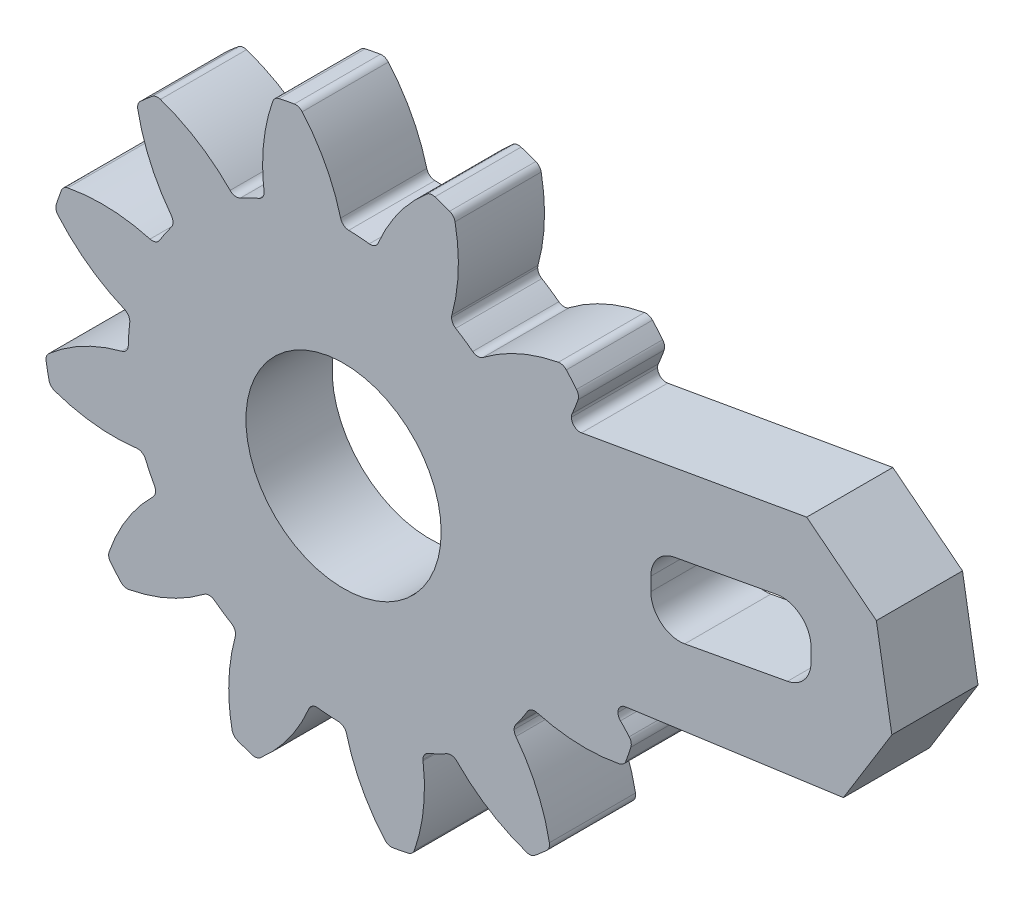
ISO-10303-21;
HEADER;
FILE_DESCRIPTION(('STEP AP214'),'2;1');
FILE_NAME('part.step','',(''),(''),'','','');
FILE_SCHEMA(('AUTOMOTIVE_DESIGN { 1 0 10303 214 1 1 1 1 }'));
ENDSEC;
DATA;
#1=APPLICATION_CONTEXT('core data for automotive mechanical design processes');
#2=APPLICATION_PROTOCOL_DEFINITION('international standard','automotive_design',2000,#1);
#3=PRODUCT_CONTEXT('',#1,'mechanical');
#4=PRODUCT('Part','Part','',(#3));
#5=PRODUCT_RELATED_PRODUCT_CATEGORY('part','',(#4));
#6=PRODUCT_DEFINITION_FORMATION('','',#4);
#7=PRODUCT_DEFINITION_CONTEXT('part definition',#1,'design');
#8=PRODUCT_DEFINITION('design','',#6,#7);
#9=PRODUCT_DEFINITION_SHAPE('','',#8);
#10=(LENGTH_UNIT() NAMED_UNIT(*) SI_UNIT(.MILLI.,.METRE.));
#11=(NAMED_UNIT(*) PLANE_ANGLE_UNIT() SI_UNIT($,.RADIAN.));
#12=(NAMED_UNIT(*) SI_UNIT($,.STERADIAN.) SOLID_ANGLE_UNIT());
#13=UNCERTAINTY_MEASURE_WITH_UNIT(LENGTH_MEASURE(1.E-05),#10,'distance_accuracy_value','');
#14=(GEOMETRIC_REPRESENTATION_CONTEXT(3) GLOBAL_UNCERTAINTY_ASSIGNED_CONTEXT((#13)) GLOBAL_UNIT_ASSIGNED_CONTEXT((#10,
#11,#12)) REPRESENTATION_CONTEXT('',''));
#15=CARTESIAN_POINT('',(0.,0.,0.));
#16=DIRECTION('',(0.,0.,1.));
#17=DIRECTION('',(1.,0.,0.));
#18=AXIS2_PLACEMENT_3D('',#15,#16,#17);
#19=CARTESIAN_POINT('',(103.327741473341,32.5919159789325,3.15));
#20=DIRECTION('',(0.,0.,-1.));
#21=DIRECTION('',(-1.,0.,0.));
#22=AXIS2_PLACEMENT_3D('',#19,#20,#21);
#23=CYLINDRICAL_SURFACE('',#22,6.87500000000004);
#24=DIRECTION('',(0.,0.,-1.));
#25=VECTOR('',#24,1.);
#26=CARTESIAN_POINT('',(96.7018269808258,34.4257322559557,3.15));
#27=LINE('',#26,#25);
#28=CARTESIAN_POINT('',(96.7018269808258,34.4257322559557,3.15));
#29=VERTEX_POINT('',#28);
#30=CARTESIAN_POINT('',(96.7018269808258,34.4257322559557,-0.15));
#31=VERTEX_POINT('',#30);
#32=EDGE_CURVE('E1198',#29,#31,#27,.T.);
#33=ORIENTED_EDGE('',*,*,#32,.T.);
#34=CARTESIAN_POINT('',(103.327741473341,32.5919159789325,-0.15));
#35=DIRECTION('',(0.,0.,-1.));
#36=DIRECTION('',(-1.,0.,0.));
#37=AXIS2_PLACEMENT_3D('',#34,#35,#36);
#38=CIRCLE('',#37,6.87500000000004);
#39=CARTESIAN_POINT('',(96.4527414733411,32.5919159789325,-0.15));
#40=VERTEX_POINT('',#39);
#41=EDGE_CURVE('E1609',#31,#40,#38,.F.);
#42=ORIENTED_EDGE('',*,*,#41,.T.);
#43=DIRECTION('',(0.,0.,-1.));
#44=VECTOR('',#43,1.);
#45=CARTESIAN_POINT('',(96.4527414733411,32.5919159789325,3.15));
#46=LINE('',#45,#44);
#47=CARTESIAN_POINT('',(96.4527414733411,32.5919159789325,3.15));
#48=VERTEX_POINT('',#47);
#49=EDGE_CURVE('E1203',#48,#40,#46,.T.);
#50=ORIENTED_EDGE('',*,*,#49,.F.);
#51=CARTESIAN_POINT('',(103.327741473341,32.5919159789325,3.15));
#52=DIRECTION('',(0.,0.,-1.));
#53=DIRECTION('',(-1.,0.,0.));
#54=AXIS2_PLACEMENT_3D('',#51,#52,#53);
#55=CIRCLE('',#54,6.87500000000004);
#56=EDGE_CURVE('E802',#48,#29,#55,.T.);
#57=ORIENTED_EDGE('',*,*,#56,.T.);
#58=EDGE_LOOP('',(#33,#42,#50,#57));
#59=FACE_BOUND('',#58,.T.);
#60=ADVANCED_FACE('F33',(#59),#23,.T.);
#61=CARTESIAN_POINT('',(103.327741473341,32.5919159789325,3.15));
#62=DIRECTION('',(0.,0.,-1.));
#63=DIRECTION('',(-1.,0.,0.));
#64=AXIS2_PLACEMENT_3D('',#61,#62,#63);
#65=CYLINDRICAL_SURFACE('',#64,6.87500000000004);
#66=CARTESIAN_POINT('',(103.327741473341,32.5919159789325,-0.15));
#67=DIRECTION('',(0.,0.,-1.));
#68=DIRECTION('',(-1.,0.,0.));
#69=AXIS2_PLACEMENT_3D('',#66,#67,#68);
#70=CIRCLE('',#69,6.87500000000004);
#71=CARTESIAN_POINT('',(96.5805201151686,31.2725870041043,-0.15));
#72=VERTEX_POINT('',#71);
#73=EDGE_CURVE('E1206',#40,#72,#70,.F.);
#74=ORIENTED_EDGE('',*,*,#73,.T.);
#75=DIRECTION('',(0.,0.,-1.));
#76=VECTOR('',#75,1.);
#77=CARTESIAN_POINT('',(96.5805201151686,31.2725870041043,3.15));
#78=LINE('',#77,#76);
#79=CARTESIAN_POINT('',(96.5805201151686,31.2725870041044,3.15));
#80=VERTEX_POINT('',#79);
#81=EDGE_CURVE('E1193',#80,#72,#78,.T.);
#82=ORIENTED_EDGE('',*,*,#81,.F.);
#83=CARTESIAN_POINT('',(103.327741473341,32.5919159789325,3.15));
#84=DIRECTION('',(0.,0.,-1.));
#85=DIRECTION('',(-1.,0.,0.));
#86=AXIS2_PLACEMENT_3D('',#83,#84,#85);
#87=CIRCLE('',#86,6.87500000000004);
#88=EDGE_CURVE('E1207',#80,#48,#87,.T.);
#89=ORIENTED_EDGE('',*,*,#88,.T.);
#90=ORIENTED_EDGE('',*,*,#49,.T.);
#91=EDGE_LOOP('',(#74,#82,#89,#90));
#92=FACE_BOUND('',#91,.T.);
#93=ADVANCED_FACE('F1623',(#92),#65,.T.);
#94=CARTESIAN_POINT('',(96.3837830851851,34.5137554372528,3.15));
#95=DIRECTION('',(0.,0.,-1.));
#96=DIRECTION('',(-1.,0.,0.));
#97=AXIS2_PLACEMENT_3D('',#94,#95,#96);
#98=CYLINDRICAL_SURFACE('',#97,0.33000000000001);
#99=ORIENTED_EDGE('',*,*,#32,.F.);
#100=CARTESIAN_POINT('',(96.3837830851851,34.5137554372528,3.15));
#101=DIRECTION('',(0.,0.,-1.));
#102=DIRECTION('',(-1.,0.,0.));
#103=AXIS2_PLACEMENT_3D('',#100,#101,#102);
#104=CIRCLE('',#103,0.33000000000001);
#105=CARTESIAN_POINT('',(96.5556290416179,34.795480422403,3.15));
#106=VERTEX_POINT('',#105);
#107=EDGE_CURVE('E1202',#106,#29,#104,.T.);
#108=ORIENTED_EDGE('',*,*,#107,.F.);
#109=DIRECTION('',(0.,0.,-1.));
#110=VECTOR('',#109,1.);
#111=CARTESIAN_POINT('',(96.555629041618,34.7954804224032,3.15));
#112=LINE('',#111,#110);
#113=CARTESIAN_POINT('',(96.5556290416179,34.795480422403,-0.15));
#114=VERTEX_POINT('',#113);
#115=EDGE_CURVE('E1173',#114,#106,#112,.F.);
#116=ORIENTED_EDGE('',*,*,#115,.F.);
#117=CARTESIAN_POINT('',(96.3837830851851,34.5137554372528,-0.15));
#118=DIRECTION('',(0.,0.,-1.));
#119=DIRECTION('',(-1.,0.,0.));
#120=AXIS2_PLACEMENT_3D('',#117,#118,#119);
#121=CIRCLE('',#120,0.33000000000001);
#122=EDGE_CURVE('E1201',#31,#114,#121,.F.);
#123=ORIENTED_EDGE('',*,*,#122,.F.);
#124=EDGE_LOOP('',(#99,#108,#116,#123));
#125=FACE_BOUND('',#124,.T.);
#126=ADVANCED_FACE('F1617',(#125),#98,.F.);
#127=CARTESIAN_POINT('',(96.9043867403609,31.3359147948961,3.15));
#128=DIRECTION('',(0.,0.,-1.));
#129=DIRECTION('',(-1.,0.,0.));
#130=AXIS2_PLACEMENT_3D('',#127,#128,#129);
#131=CYLINDRICAL_SURFACE('',#130,0.329999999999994);
#132=CARTESIAN_POINT('',(96.9043867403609,31.3359147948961,3.15));
#133=DIRECTION('',(0.,0.,-1.));
#134=DIRECTION('',(-1.,0.,0.));
#135=AXIS2_PLACEMENT_3D('',#132,#133,#134);
#136=CIRCLE('',#135,0.329999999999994);
#137=CARTESIAN_POINT('',(96.7882869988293,31.0270121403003,3.15));
#138=VERTEX_POINT('',#137);
#139=EDGE_CURVE('E1197',#138,#80,#136,.T.);
#140=ORIENTED_EDGE('',*,*,#139,.T.);
#141=ORIENTED_EDGE('',*,*,#81,.T.);
#142=CARTESIAN_POINT('',(96.9043867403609,31.3359147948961,-0.15));
#143=DIRECTION('',(0.,0.,-1.));
#144=DIRECTION('',(-1.,0.,0.));
#145=AXIS2_PLACEMENT_3D('',#142,#143,#144);
#146=CIRCLE('',#145,0.329999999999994);
#147=CARTESIAN_POINT('',(96.7882869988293,31.0270121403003,-0.15));
#148=VERTEX_POINT('',#147);
#149=EDGE_CURVE('E1600',#72,#148,#146,.F.);
#150=ORIENTED_EDGE('',*,*,#149,.T.);
#151=DIRECTION('',(0.,0.,-1.));
#152=VECTOR('',#151,1.);
#153=CARTESIAN_POINT('',(96.7882869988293,31.0270121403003,3.15));
#154=LINE('',#153,#152);
#155=EDGE_CURVE('E1163',#138,#148,#154,.T.);
#156=ORIENTED_EDGE('',*,*,#155,.F.);
#157=EDGE_LOOP('',(#140,#141,#150,#156));
#158=FACE_BOUND('',#157,.T.);
#159=ADVANCED_FACE('F1629',(#158),#131,.T.);
#160=CARTESIAN_POINT('',(111.544332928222,38.4389479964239,3.15));
#161=DIRECTION('',(0.,0.,-1.));
#162=DIRECTION('',(-1.,0.,0.));
#163=AXIS2_PLACEMENT_3D('',#160,#161,#162);
#164=CYLINDRICAL_SURFACE('',#163,0.33000000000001);
#165=CARTESIAN_POINT('',(111.544332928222,38.4389479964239,3.15));
#166=DIRECTION('',(0.,0.,-1.));
#167=DIRECTION('',(-1.,0.,0.));
#168=AXIS2_PLACEMENT_3D('',#165,#166,#167);
#169=CIRCLE('',#168,0.33000000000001);
#170=CARTESIAN_POINT('',(111.794518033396,38.6541395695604,3.15));
#171=VERTEX_POINT('',#170);
#172=CARTESIAN_POINT('',(111.858819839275,38.3389580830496,3.15));
#173=VERTEX_POINT('',#172);
#174=EDGE_CURVE('E1594',#171,#173,#169,.T.);
#175=ORIENTED_EDGE('',*,*,#174,.T.);
#176=DIRECTION('',(0.,0.,-1.));
#177=VECTOR('',#176,1.);
#178=CARTESIAN_POINT('',(111.858819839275,38.3389580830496,3.15));
#179=LINE('',#178,#177);
#180=CARTESIAN_POINT('',(111.858819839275,38.3389580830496,-0.15));
#181=VERTEX_POINT('',#180);
#182=EDGE_CURVE('E1153',#181,#173,#179,.F.);
#183=ORIENTED_EDGE('',*,*,#182,.F.);
#184=CARTESIAN_POINT('',(111.544332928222,38.4389479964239,-0.15));
#185=DIRECTION('',(0.,0.,-1.));
#186=DIRECTION('',(-1.,0.,0.));
#187=AXIS2_PLACEMENT_3D('',#184,#185,#186);
#188=CIRCLE('',#187,0.33000000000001);
#189=CARTESIAN_POINT('',(111.794518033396,38.6541395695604,-0.15));
#190=VERTEX_POINT('',#189);
#191=EDGE_CURVE('E1196',#181,#190,#188,.F.);
#192=ORIENTED_EDGE('',*,*,#191,.T.);
#193=DIRECTION('',(0.,0.,-1.));
#194=VECTOR('',#193,1.);
#195=CARTESIAN_POINT('',(111.794518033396,38.6541395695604,3.15));
#196=LINE('',#195,#194);
#197=EDGE_CURVE('E1188',#171,#190,#196,.T.);
#198=ORIENTED_EDGE('',*,*,#197,.F.);
#199=EDGE_LOOP('',(#175,#183,#192,#198));
#200=FACE_BOUND('',#199,.T.);
#201=ADVANCED_FACE('F1741',(#200),#164,.T.);
#202=CARTESIAN_POINT('',(106.582328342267,34.1709817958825,3.15));
#203=DIRECTION('',(0.,0.,-1.));
#204=DIRECTION('',(-1.,0.,0.));
#205=AXIS2_PLACEMENT_3D('',#202,#203,#204);
#206=CYLINDRICAL_SURFACE('',#205,6.87500000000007);
#207=CARTESIAN_POINT('',(106.582328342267,34.1709817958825,3.15));
#208=DIRECTION('',(0.,0.,-1.));
#209=DIRECTION('',(-1.,0.,0.));
#210=AXIS2_PLACEMENT_3D('',#207,#208,#209);
#211=CIRCLE('',#210,6.87500000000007);
#212=CARTESIAN_POINT('',(111.45999875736,39.0159747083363,3.15));
#213=VERTEX_POINT('',#212);
#214=EDGE_CURVE('E1192',#213,#171,#211,.T.);
#215=ORIENTED_EDGE('',*,*,#214,.T.);
#216=ORIENTED_EDGE('',*,*,#197,.T.);
#217=CARTESIAN_POINT('',(106.582328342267,34.1709817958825,-0.15));
#218=DIRECTION('',(0.,0.,-1.));
#219=DIRECTION('',(-1.,0.,0.));
#220=AXIS2_PLACEMENT_3D('',#217,#218,#219);
#221=CIRCLE('',#220,6.87500000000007);
#222=CARTESIAN_POINT('',(111.45999875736,39.0159747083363,-0.15));
#223=VERTEX_POINT('',#222);
#224=EDGE_CURVE('E1591',#190,#223,#221,.F.);
#225=ORIENTED_EDGE('',*,*,#224,.T.);
#226=DIRECTION('',(0.,0.,-1.));
#227=VECTOR('',#226,1.);
#228=CARTESIAN_POINT('',(111.45999875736,39.0159747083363,3.15));
#229=LINE('',#228,#227);
#230=EDGE_CURVE('E1145',#223,#213,#229,.F.);
#231=ORIENTED_EDGE('',*,*,#230,.T.);
#232=EDGE_LOOP('',(#215,#216,#225,#231));
#233=FACE_BOUND('',#232,.T.);
#234=ADVANCED_FACE('F1743',(#233),#206,.T.);
#235=CARTESIAN_POINT('',(103.330875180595,51.0844544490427,3.15));
#236=DIRECTION('',(0.,0.,-1.));
#237=DIRECTION('',(-1.,0.,0.));
#238=AXIS2_PLACEMENT_3D('',#235,#236,#237);
#239=CYLINDRICAL_SURFACE('',#238,6.87500000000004);
#240=CARTESIAN_POINT('',(103.330875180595,51.0844544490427,3.15));
#241=DIRECTION('',(0.,0.,-1.));
#242=DIRECTION('',(-1.,0.,0.));
#243=AXIS2_PLACEMENT_3D('',#240,#241,#242);
#244=CIRCLE('',#243,6.87500000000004);
#245=CARTESIAN_POINT('',(109.833804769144,48.8534161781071,3.15));
#246=VERTEX_POINT('',#245);
#247=CARTESIAN_POINT('',(109.60932721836,48.2832645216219,3.15));
#248=VERTEX_POINT('',#247);
#249=EDGE_CURVE('E1585',#246,#248,#244,.T.);
#250=ORIENTED_EDGE('',*,*,#249,.T.);
#251=DIRECTION('',(0.,0.,-1.));
#252=VECTOR('',#251,1.);
#253=CARTESIAN_POINT('',(109.60932721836,48.2832645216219,3.15));
#254=LINE('',#253,#252);
#255=CARTESIAN_POINT('',(109.60932721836,48.2832645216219,-0.15));
#256=VERTEX_POINT('',#255);
#257=EDGE_CURVE('E1140',#248,#256,#254,.T.);
#258=ORIENTED_EDGE('',*,*,#257,.T.);
#259=CARTESIAN_POINT('',(103.330875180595,51.0844544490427,-0.15));
#260=DIRECTION('',(0.,0.,-1.));
#261=DIRECTION('',(-1.,0.,0.));
#262=AXIS2_PLACEMENT_3D('',#259,#260,#261);
#263=CIRCLE('',#262,6.87500000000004);
#264=CARTESIAN_POINT('',(109.833804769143,48.8534161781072,-0.15));
#265=VERTEX_POINT('',#264);
#266=EDGE_CURVE('E1191',#256,#265,#263,.F.);
#267=ORIENTED_EDGE('',*,*,#266,.T.);
#268=DIRECTION('',(0.,0.,-1.));
#269=VECTOR('',#268,1.);
#270=CARTESIAN_POINT('',(109.833804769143,48.8534161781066,3.15));
#271=LINE('',#270,#269);
#272=EDGE_CURVE('E1183',#246,#265,#271,.T.);
#273=ORIENTED_EDGE('',*,*,#272,.F.);
#274=EDGE_LOOP('',(#250,#258,#267,#273));
#275=FACE_BOUND('',#274,.T.);
#276=ADVANCED_FACE('F2094',(#275),#239,.T.);
#277=CARTESIAN_POINT('',(109.521664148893,48.9605060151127,3.15));
#278=DIRECTION('',(0.,0.,-1.));
#279=DIRECTION('',(-1.,0.,0.));
#280=AXIS2_PLACEMENT_3D('',#277,#278,#279);
#281=CYLINDRICAL_SURFACE('',#280,0.330000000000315);
#282=CARTESIAN_POINT('',(109.521664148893,48.9605060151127,3.15));
#283=DIRECTION('',(0.,0.,-1.));
#284=DIRECTION('',(-1.,0.,0.));
#285=AXIS2_PLACEMENT_3D('',#282,#283,#284);
#286=CIRCLE('',#285,0.330000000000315);
#287=CARTESIAN_POINT('',(109.77666080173,49.1699736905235,3.15));
#288=VERTEX_POINT('',#287);
#289=EDGE_CURVE('E1187',#288,#246,#286,.T.);
#290=ORIENTED_EDGE('',*,*,#289,.T.);
#291=ORIENTED_EDGE('',*,*,#272,.T.);
#292=CARTESIAN_POINT('',(109.521664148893,48.9605060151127,-0.15));
#293=DIRECTION('',(0.,0.,-1.));
#294=DIRECTION('',(-1.,0.,0.));
#295=AXIS2_PLACEMENT_3D('',#292,#293,#294);
#296=CIRCLE('',#295,0.330000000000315);
#297=CARTESIAN_POINT('',(109.77666080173,49.1699736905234,-0.15));
#298=VERTEX_POINT('',#297);
#299=EDGE_CURVE('E1582',#265,#298,#296,.F.);
#300=ORIENTED_EDGE('',*,*,#299,.T.);
#301=DIRECTION('',(0.,0.,-1.));
#302=VECTOR('',#301,1.);
#303=CARTESIAN_POINT('',(109.77666080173,49.1699736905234,3.15));
#304=LINE('',#303,#302);
#305=EDGE_CURVE('E1136',#288,#298,#304,.T.);
#306=ORIENTED_EDGE('',*,*,#305,.F.);
#307=EDGE_LOOP('',(#290,#291,#300,#306));
#308=FACE_BOUND('',#307,.T.);
#309=ADVANCED_FACE('F2090',(#308),#281,.T.);
#310=CARTESIAN_POINT('',(90.1592229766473,45.2382621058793,3.15));
#311=DIRECTION('',(0.,0.,-1.));
#312=DIRECTION('',(-1.,0.,0.));
#313=AXIS2_PLACEMENT_3D('',#310,#311,#312);
#314=CYLINDRICAL_SURFACE('',#313,0.330000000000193);
#315=DIRECTION('',(0.,0.,-1.));
#316=VECTOR('',#315,1.);
#317=CARTESIAN_POINT('',(89.8447360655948,45.3382520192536,3.15));
#318=LINE('',#317,#316);
#319=CARTESIAN_POINT('',(89.8447360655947,45.3382520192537,-0.15));
#320=VERTEX_POINT('',#319);
#321=CARTESIAN_POINT('',(89.8447360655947,45.3382520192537,3.15));
#322=VERTEX_POINT('',#321);
#323=EDGE_CURVE('E1118',#320,#322,#318,.F.);
#324=ORIENTED_EDGE('',*,*,#323,.F.);
#325=CARTESIAN_POINT('',(90.1592229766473,45.2382621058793,-0.15));
#326=DIRECTION('',(0.,0.,-1.));
#327=DIRECTION('',(-1.,0.,0.));
#328=AXIS2_PLACEMENT_3D('',#325,#326,#327);
#329=CIRCLE('',#328,0.330000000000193);
#330=CARTESIAN_POINT('',(89.8292229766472,45.2382621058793,-0.15));
#331=VERTEX_POINT('',#330);
#332=EDGE_CURVE('E1577',#320,#331,#329,.F.);
#333=ORIENTED_EDGE('',*,*,#332,.T.);
#334=DIRECTION('',(0.,0.,-1.));
#335=VECTOR('',#334,1.);
#336=CARTESIAN_POINT('',(89.8292229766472,45.2382621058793,3.15));
#337=LINE('',#336,#335);
#338=CARTESIAN_POINT('',(89.8292229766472,45.2382621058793,3.15));
#339=VERTEX_POINT('',#338);
#340=EDGE_CURVE('E1106',#339,#331,#337,.T.);
#341=ORIENTED_EDGE('',*,*,#340,.F.);
#342=CARTESIAN_POINT('',(90.1592229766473,45.2382621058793,3.15));
#343=DIRECTION('',(0.,0.,-1.));
#344=DIRECTION('',(-1.,0.,0.));
#345=AXIS2_PLACEMENT_3D('',#342,#343,#344);
#346=CIRCLE('',#345,0.330000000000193);
#347=EDGE_CURVE('E1186',#339,#322,#346,.T.);
#348=ORIENTED_EDGE('',*,*,#347,.T.);
#349=EDGE_LOOP('',(#324,#333,#341,#348));
#350=FACE_BOUND('',#349,.T.);
#351=ADVANCED_FACE('F2086',(#350),#314,.T.);
#352=CARTESIAN_POINT('',(89.7824857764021,40.0058009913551,3.15));
#353=DIRECTION('',(0.,0.,-1.));
#354=DIRECTION('',(-1.,0.,0.));
#355=AXIS2_PLACEMENT_3D('',#352,#353,#354);
#356=CYLINDRICAL_SURFACE('',#355,0.330000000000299);
#357=CARTESIAN_POINT('',(89.7824857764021,40.0058009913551,-0.15));
#358=DIRECTION('',(0.,0.,-1.));
#359=DIRECTION('',(-1.,0.,0.));
#360=AXIS2_PLACEMENT_3D('',#357,#358,#359);
#361=CIRCLE('',#360,0.330000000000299);
#362=CARTESIAN_POINT('',(89.4524857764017,40.0058009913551,-0.15));
#363=VERTEX_POINT('',#362);
#364=CARTESIAN_POINT('',(89.4569183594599,39.9518949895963,-0.15));
#365=VERTEX_POINT('',#364);
#366=EDGE_CURVE('E1572',#363,#365,#361,.F.);
#367=ORIENTED_EDGE('',*,*,#366,.T.);
#368=DIRECTION('',(0.,0.,-1.));
#369=VECTOR('',#368,1.);
#370=CARTESIAN_POINT('',(89.4569183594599,39.9518949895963,3.15));
#371=LINE('',#370,#369);
#372=CARTESIAN_POINT('',(89.4569183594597,39.9518949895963,3.15));
#373=VERTEX_POINT('',#372);
#374=EDGE_CURVE('E1178',#373,#365,#371,.T.);
#375=ORIENTED_EDGE('',*,*,#374,.F.);
#376=CARTESIAN_POINT('',(89.7824857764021,40.0058009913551,3.15));
#377=DIRECTION('',(0.,0.,-1.));
#378=DIRECTION('',(-1.,0.,0.));
#379=AXIS2_PLACEMENT_3D('',#376,#377,#378);
#380=CIRCLE('',#379,0.330000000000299);
#381=CARTESIAN_POINT('',(89.4524857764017,40.0058009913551,3.15));
#382=VERTEX_POINT('',#381);
#383=EDGE_CURVE('E1575',#373,#382,#380,.T.);
#384=ORIENTED_EDGE('',*,*,#383,.T.);
#385=DIRECTION('',(0.,0.,-1.));
#386=VECTOR('',#385,1.);
#387=CARTESIAN_POINT('',(89.4524857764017,40.0058009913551,3.15));
#388=LINE('',#387,#386);
#389=EDGE_CURVE('E1102',#363,#382,#388,.F.);
#390=ORIENTED_EDGE('',*,*,#389,.F.);
#391=EDGE_LOOP('',(#367,#375,#384,#390));
#392=FACE_BOUND('',#391,.T.);
#393=ADVANCED_FACE('F2082',(#392),#356,.T.);
#394=CARTESIAN_POINT('',(100.851777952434,41.8386050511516,3.15));
#395=DIRECTION('',(0.,0.,-1.));
#396=DIRECTION('',(-1.,0.,0.));
#397=AXIS2_PLACEMENT_3D('',#394,#395,#396);
#398=CYLINDRICAL_SURFACE('',#397,8.24999999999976);
#399=CARTESIAN_POINT('',(100.851777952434,41.8386050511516,3.15));
#400=DIRECTION('',(0.,0.,-1.));
#401=DIRECTION('',(-1.,0.,0.));
#402=AXIS2_PLACEMENT_3D('',#399,#400,#401);
#403=CIRCLE('',#402,8.24999999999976);
#404=CARTESIAN_POINT('',(92.6041786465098,42.0376168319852,3.15));
#405=VERTEX_POINT('',#404);
#406=CARTESIAN_POINT('',(92.6607388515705,42.8231752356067,3.15));
#407=VERTEX_POINT('',#406);
#408=EDGE_CURVE('E1567',#405,#407,#403,.T.);
#409=ORIENTED_EDGE('',*,*,#408,.T.);
#410=DIRECTION('',(0.,0.,-1.));
#411=VECTOR('',#410,1.);
#412=CARTESIAN_POINT('',(92.6607388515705,42.8231752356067,3.15));
#413=LINE('',#412,#411);
#414=CARTESIAN_POINT('',(92.6607388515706,42.8231752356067,-0.15));
#415=VERTEX_POINT('',#414);
#416=EDGE_CURVE('E1111',#407,#415,#413,.T.);
#417=ORIENTED_EDGE('',*,*,#416,.T.);
#418=CARTESIAN_POINT('',(100.851777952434,41.8386050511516,-0.15));
#419=DIRECTION('',(0.,0.,-1.));
#420=DIRECTION('',(-1.,0.,0.));
#421=AXIS2_PLACEMENT_3D('',#418,#419,#420);
#422=CIRCLE('',#421,8.24999999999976);
#423=CARTESIAN_POINT('',(92.6041786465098,42.0376168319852,-0.15));
#424=VERTEX_POINT('',#423);
#425=EDGE_CURVE('E1570',#415,#424,#422,.F.);
#426=ORIENTED_EDGE('',*,*,#425,.T.);
#427=DIRECTION('',(0.,0.,-1.));
#428=VECTOR('',#427,1.);
#429=CARTESIAN_POINT('',(92.6041786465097,42.0376168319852,3.15));
#430=LINE('',#429,#428);
#431=EDGE_CURVE('E1107',#424,#405,#430,.F.);
#432=ORIENTED_EDGE('',*,*,#431,.T.);
#433=EDGE_LOOP('',(#409,#417,#426,#432));
#434=FACE_BOUND('',#433,.T.);
#435=ADVANCED_FACE('F2078',(#434),#398,.T.);
#436=CARTESIAN_POINT('',(100.851777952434,41.8386050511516,3.15));
#437=DIRECTION('',(0.,0.,-1.));
#438=DIRECTION('',(-1.,0.,0.));
#439=AXIS2_PLACEMENT_3D('',#436,#437,#438);
#440=CYLINDRICAL_SURFACE('',#439,11.549999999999);
#441=CARTESIAN_POINT('',(100.851777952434,41.8386050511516,3.15));
#442=DIRECTION('',(0.,0.,-1.));
#443=DIRECTION('',(-1.,0.,0.));
#444=AXIS2_PLACEMENT_3D('',#441,#442,#443);
#445=CIRCLE('',#444,11.549999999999);
#446=CARTESIAN_POINT('',(89.5695765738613,39.3658672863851,3.15));
#447=VERTEX_POINT('',#446);
#448=EDGE_CURVE('E1182',#447,#373,#445,.T.);
#449=ORIENTED_EDGE('',*,*,#448,.T.);
#450=ORIENTED_EDGE('',*,*,#374,.T.);
#451=CARTESIAN_POINT('',(100.851777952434,41.8386050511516,-0.15));
#452=DIRECTION('',(0.,0.,-1.));
#453=DIRECTION('',(-1.,0.,0.));
#454=AXIS2_PLACEMENT_3D('',#451,#452,#453);
#455=CIRCLE('',#454,11.549999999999);
#456=CARTESIAN_POINT('',(89.5695765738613,39.3658672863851,-0.15));
#457=VERTEX_POINT('',#456);
#458=EDGE_CURVE('E1565',#365,#457,#455,.F.);
#459=ORIENTED_EDGE('',*,*,#458,.T.);
#460=DIRECTION('',(0.,0.,-1.));
#461=VECTOR('',#460,1.);
#462=CARTESIAN_POINT('',(89.5695765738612,39.3658672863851,3.15));
#463=LINE('',#462,#461);
#464=EDGE_CURVE('E1090',#447,#457,#463,.T.);
#465=ORIENTED_EDGE('',*,*,#464,.F.);
#466=EDGE_LOOP('',(#449,#450,#459,#465));
#467=FACE_BOUND('',#466,.T.);
#468=ADVANCED_FACE('F2074',(#467),#440,.T.);
#469=CARTESIAN_POINT('',(92.1818917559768,34.7167040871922,3.15));
#470=DIRECTION('',(0.,0.,-1.));
#471=DIRECTION('',(-1.,0.,0.));
#472=AXIS2_PLACEMENT_3D('',#469,#470,#471);
#473=CYLINDRICAL_SURFACE('',#472,0.330000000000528);
#474=CARTESIAN_POINT('',(92.1818917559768,34.7167040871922,-0.15));
#475=DIRECTION('',(0.,0.,-1.));
#476=DIRECTION('',(-1.,0.,0.));
#477=AXIS2_PLACEMENT_3D('',#474,#475,#476);
#478=CIRCLE('',#477,0.330000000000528);
#479=CARTESIAN_POINT('',(91.8518917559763,34.7167040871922,-0.15));
#480=VERTEX_POINT('',#479);
#481=CARTESIAN_POINT('',(91.9268951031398,34.5072364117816,-0.15));
#482=VERTEX_POINT('',#481);
#483=EDGE_CURVE('E1559',#480,#482,#478,.F.);
#484=ORIENTED_EDGE('',*,*,#483,.T.);
#485=DIRECTION('',(0.,0.,-1.));
#486=VECTOR('',#485,1.);
#487=CARTESIAN_POINT('',(91.9268951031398,34.5072364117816,3.15));
#488=LINE('',#487,#486);
#489=CARTESIAN_POINT('',(91.9268951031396,34.5072364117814,3.15));
#490=VERTEX_POINT('',#489);
#491=EDGE_CURVE('E1168',#490,#482,#488,.T.);
#492=ORIENTED_EDGE('',*,*,#491,.F.);
#493=CARTESIAN_POINT('',(92.1818917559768,34.7167040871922,3.15));
#494=DIRECTION('',(0.,0.,-1.));
#495=DIRECTION('',(-1.,0.,0.));
#496=AXIS2_PLACEMENT_3D('',#493,#494,#495);
#497=CIRCLE('',#496,0.330000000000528);
#498=CARTESIAN_POINT('',(91.8518917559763,34.7167040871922,3.15));
#499=VERTEX_POINT('',#498);
#500=EDGE_CURVE('E1181',#490,#499,#497,.T.);
#501=ORIENTED_EDGE('',*,*,#500,.T.);
#502=DIRECTION('',(0.,0.,-1.));
#503=VECTOR('',#502,1.);
#504=CARTESIAN_POINT('',(91.8518917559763,34.7167040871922,3.15));
#505=LINE('',#504,#503);
#506=EDGE_CURVE('E1086',#480,#499,#505,.F.);
#507=ORIENTED_EDGE('',*,*,#506,.F.);
#508=EDGE_LOOP('',(#484,#492,#501,#507));
#509=FACE_BOUND('',#508,.T.);
#510=ADVANCED_FACE('F2070',(#509),#473,.T.);
#511=CARTESIAN_POINT('',(100.851777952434,41.8386050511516,3.15));
#512=DIRECTION('',(0.,0.,-1.));
#513=DIRECTION('',(-1.,0.,0.));
#514=AXIS2_PLACEMENT_3D('',#511,#512,#513);
#515=CYLINDRICAL_SURFACE('',#514,8.24999999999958);
#516=CARTESIAN_POINT('',(100.851777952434,41.8386050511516,3.15));
#517=DIRECTION('',(0.,0.,-1.));
#518=DIRECTION('',(-1.,0.,0.));
#519=AXIS2_PLACEMENT_3D('',#516,#517,#518);
#520=CIRCLE('',#519,8.24999999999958);
#521=CARTESIAN_POINT('',(93.6096415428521,37.8871546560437,3.15));
#522=VERTEX_POINT('',#521);
#523=CARTESIAN_POINT('',(93.265844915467,38.5957482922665,3.15));
#524=VERTEX_POINT('',#523);
#525=EDGE_CURVE('E1554',#522,#524,#520,.T.);
#526=ORIENTED_EDGE('',*,*,#525,.T.);
#527=DIRECTION('',(0.,0.,-1.));
#528=VECTOR('',#527,1.);
#529=CARTESIAN_POINT('',(93.265844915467,38.5957482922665,3.15));
#530=LINE('',#529,#528);
#531=CARTESIAN_POINT('',(93.2658449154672,38.5957482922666,-0.15));
#532=VERTEX_POINT('',#531);
#533=EDGE_CURVE('E1095',#524,#532,#530,.T.);
#534=ORIENTED_EDGE('',*,*,#533,.T.);
#535=CARTESIAN_POINT('',(100.851777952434,41.8386050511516,-0.15));
#536=DIRECTION('',(0.,0.,-1.));
#537=DIRECTION('',(-1.,0.,0.));
#538=AXIS2_PLACEMENT_3D('',#535,#536,#537);
#539=CIRCLE('',#538,8.24999999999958);
#540=CARTESIAN_POINT('',(93.6096415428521,37.8871546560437,-0.15));
#541=VERTEX_POINT('',#540);
#542=EDGE_CURVE('E1557',#532,#541,#539,.F.);
#543=ORIENTED_EDGE('',*,*,#542,.T.);
#544=DIRECTION('',(0.,0.,-1.));
#545=VECTOR('',#544,1.);
#546=CARTESIAN_POINT('',(93.6096415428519,37.8871546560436,3.15));
#547=LINE('',#546,#545);
#548=EDGE_CURVE('E1091',#541,#522,#547,.F.);
#549=ORIENTED_EDGE('',*,*,#548,.T.);
#550=EDGE_LOOP('',(#526,#534,#543,#549));
#551=FACE_BOUND('',#550,.T.);
#552=ADVANCED_FACE('F2066',(#551),#515,.T.);
#553=CARTESIAN_POINT('',(100.851777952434,41.8386050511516,3.15));
#554=DIRECTION('',(0.,0.,-1.));
#555=DIRECTION('',(-1.,0.,0.));
#556=AXIS2_PLACEMENT_3D('',#553,#554,#555);
#557=CYLINDRICAL_SURFACE('',#556,8.24999999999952);
#558=CARTESIAN_POINT('',(100.851777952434,41.8386050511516,3.15));
#559=DIRECTION('',(0.,0.,-1.));
#560=DIRECTION('',(-1.,0.,0.));
#561=AXIS2_PLACEMENT_3D('',#558,#559,#560);
#562=CIRCLE('',#561,8.24999999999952);
#563=CARTESIAN_POINT('',(95.9035956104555,35.2372421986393,3.15));
#564=VERTEX_POINT('',#563);
#565=EDGE_CURVE('E1176',#106,#564,#562,.T.);
#566=ORIENTED_EDGE('',*,*,#565,.T.);
#567=DIRECTION('',(0.,0.,-1.));
#568=VECTOR('',#567,1.);
#569=CARTESIAN_POINT('',(95.9035956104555,35.2372421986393,3.15));
#570=LINE('',#569,#568);
#571=CARTESIAN_POINT('',(95.9035956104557,35.2372421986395,-0.15));
#572=VERTEX_POINT('',#571);
#573=EDGE_CURVE('E1078',#564,#572,#570,.T.);
#574=ORIENTED_EDGE('',*,*,#573,.T.);
#575=CARTESIAN_POINT('',(100.851777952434,41.8386050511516,-0.15));
#576=DIRECTION('',(0.,0.,-1.));
#577=DIRECTION('',(-1.,0.,0.));
#578=AXIS2_PLACEMENT_3D('',#575,#576,#577);
#579=CIRCLE('',#578,8.24999999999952);
#580=EDGE_CURVE('E1177',#572,#114,#579,.F.);
#581=ORIENTED_EDGE('',*,*,#580,.T.);
#582=ORIENTED_EDGE('',*,*,#115,.T.);
#583=EDGE_LOOP('',(#566,#574,#581,#582));
#584=FACE_BOUND('',#583,.T.);
#585=ADVANCED_FACE('F2062',(#584),#557,.T.);
#586=CARTESIAN_POINT('',(100.851777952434,41.8386050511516,3.15));
#587=DIRECTION('',(0.,0.,-1.));
#588=DIRECTION('',(-1.,0.,0.));
#589=AXIS2_PLACEMENT_3D('',#586,#587,#588);
#590=CYLINDRICAL_SURFACE('',#589,11.5499999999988);
#591=CARTESIAN_POINT('',(100.851777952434,41.8386050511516,3.15));
#592=DIRECTION('',(0.,0.,-1.));
#593=DIRECTION('',(-1.,0.,0.));
#594=AXIS2_PLACEMENT_3D('',#591,#592,#593);
#595=CIRCLE('',#594,11.5499999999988);
#596=CARTESIAN_POINT('',(92.317473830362,34.05605064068,3.15));
#597=VERTEX_POINT('',#596);
#598=EDGE_CURVE('E1172',#597,#490,#595,.T.);
#599=ORIENTED_EDGE('',*,*,#598,.T.);
#600=ORIENTED_EDGE('',*,*,#491,.T.);
#601=CARTESIAN_POINT('',(100.851777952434,41.8386050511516,-0.15));
#602=DIRECTION('',(0.,0.,-1.));
#603=DIRECTION('',(-1.,0.,0.));
#604=AXIS2_PLACEMENT_3D('',#601,#602,#603);
#605=CIRCLE('',#604,11.5499999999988);
#606=CARTESIAN_POINT('',(92.317473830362,34.05605064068,-0.15));
#607=VERTEX_POINT('',#606);
#608=EDGE_CURVE('E1548',#482,#607,#605,.F.);
#609=ORIENTED_EDGE('',*,*,#608,.T.);
#610=DIRECTION('',(0.,0.,-1.));
#611=VECTOR('',#610,1.);
#612=CARTESIAN_POINT('',(92.317473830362,34.05605064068,3.15));
#613=LINE('',#612,#611);
#614=EDGE_CURVE('E1083',#597,#607,#613,.T.);
#615=ORIENTED_EDGE('',*,*,#614,.F.);
#616=EDGE_LOOP('',(#599,#600,#609,#615));
#617=FACE_BOUND('',#616,.T.);
#618=ADVANCED_FACE('F2059',(#617),#590,.T.);
#619=CARTESIAN_POINT('',(100.851777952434,41.8386050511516,3.15));
#620=DIRECTION('',(0.,0.,-1.));
#621=DIRECTION('',(-1.,0.,0.));
#622=AXIS2_PLACEMENT_3D('',#619,#620,#621);
#623=CYLINDRICAL_SURFACE('',#622,11.55);
#624=CARTESIAN_POINT('',(100.851777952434,41.8386050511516,3.15));
#625=DIRECTION('',(0.,0.,-1.));
#626=DIRECTION('',(-1.,0.,0.));
#627=AXIS2_PLACEMENT_3D('',#624,#625,#626);
#628=CIRCLE('',#627,11.55);
#629=CARTESIAN_POINT('',(97.3521309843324,30.8315631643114,3.15));
#630=VERTEX_POINT('',#629);
#631=EDGE_CURVE('E1167',#630,#138,#628,.T.);
#632=ORIENTED_EDGE('',*,*,#631,.T.);
#633=ORIENTED_EDGE('',*,*,#155,.T.);
#634=CARTESIAN_POINT('',(100.851777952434,41.8386050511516,-0.15));
#635=DIRECTION('',(0.,0.,-1.));
#636=DIRECTION('',(-1.,0.,0.));
#637=AXIS2_PLACEMENT_3D('',#634,#635,#636);
#638=CIRCLE('',#637,11.55);
#639=CARTESIAN_POINT('',(97.3521309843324,30.8315631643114,-0.15));
#640=VERTEX_POINT('',#639);
#641=EDGE_CURVE('E1171',#148,#640,#638,.F.);
#642=ORIENTED_EDGE('',*,*,#641,.T.);
#643=DIRECTION('',(0.,0.,-1.));
#644=VECTOR('',#643,1.);
#645=CARTESIAN_POINT('',(97.3521309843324,30.8315631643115,3.15));
#646=LINE('',#645,#644);
#647=EDGE_CURVE('E1066',#630,#640,#646,.T.);
#648=ORIENTED_EDGE('',*,*,#647,.F.);
#649=EDGE_LOOP('',(#632,#633,#642,#648));
#650=FACE_BOUND('',#649,.T.);
#651=ADVANCED_FACE('F1631',(#650),#623,.T.);
#652=CARTESIAN_POINT('',(100.851777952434,41.8386050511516,3.15));
#653=DIRECTION('',(0.,0.,-1.));
#654=DIRECTION('',(-1.,0.,0.));
#655=AXIS2_PLACEMENT_3D('',#652,#653,#654);
#656=CYLINDRICAL_SURFACE('',#655,8.24999999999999);
#657=CARTESIAN_POINT('',(100.851777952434,41.8386050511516,3.15));
#658=DIRECTION('',(0.,0.,-1.));
#659=DIRECTION('',(-1.,0.,0.));
#660=AXIS2_PLACEMENT_3D('',#657,#658,#659);
#661=CIRCLE('',#660,8.24999999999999);
#662=CARTESIAN_POINT('',(100.652766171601,33.5910057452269,3.15));
#663=VERTEX_POINT('',#662);
#664=CARTESIAN_POINT('',(99.8672077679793,33.6475659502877,3.15));
#665=VERTEX_POINT('',#664);
#666=EDGE_CURVE('E1539',#663,#665,#661,.T.);
#667=ORIENTED_EDGE('',*,*,#666,.T.);
#668=DIRECTION('',(0.,0.,-1.));
#669=VECTOR('',#668,1.);
#670=CARTESIAN_POINT('',(99.8672077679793,33.6475659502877,3.15));
#671=LINE('',#670,#669);
#672=CARTESIAN_POINT('',(99.8672077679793,33.6475659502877,-0.15));
#673=VERTEX_POINT('',#672);
#674=EDGE_CURVE('E1071',#665,#673,#671,.T.);
#675=ORIENTED_EDGE('',*,*,#674,.T.);
#676=CARTESIAN_POINT('',(100.851777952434,41.8386050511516,-0.15));
#677=DIRECTION('',(0.,0.,-1.));
#678=DIRECTION('',(-1.,0.,0.));
#679=AXIS2_PLACEMENT_3D('',#676,#677,#678);
#680=CIRCLE('',#679,8.24999999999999);
#681=CARTESIAN_POINT('',(100.652766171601,33.5910057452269,-0.15));
#682=VERTEX_POINT('',#681);
#683=EDGE_CURVE('E1166',#673,#682,#680,.F.);
#684=ORIENTED_EDGE('',*,*,#683,.T.);
#685=DIRECTION('',(0.,0.,-1.));
#686=VECTOR('',#685,1.);
#687=CARTESIAN_POINT('',(100.652766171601,33.5910057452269,3.15));
#688=LINE('',#687,#686);
#689=EDGE_CURVE('E1067',#682,#663,#688,.F.);
#690=ORIENTED_EDGE('',*,*,#689,.T.);
#691=EDGE_LOOP('',(#667,#675,#684,#690));
#692=FACE_BOUND('',#691,.T.);
#693=ADVANCED_FACE('F1645',(#692),#656,.T.);
#694=CARTESIAN_POINT('',(104.224348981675,33.9492346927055,3.15));
#695=DIRECTION('',(0.,0.,-1.));
#696=DIRECTION('',(-1.,0.,0.));
#697=AXIS2_PLACEMENT_3D('',#694,#695,#696);
#698=CYLINDRICAL_SURFACE('',#697,0.329999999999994);
#699=DIRECTION('',(0.,0.,-1.));
#700=VECTOR('',#699,1.);
#701=CARTESIAN_POINT('',(103.894348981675,33.9492346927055,3.15));
#702=LINE('',#701,#700);
#703=CARTESIAN_POINT('',(103.894348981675,33.9492346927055,3.15));
#704=VERTEX_POINT('',#703);
#705=CARTESIAN_POINT('',(103.894348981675,33.9492346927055,-0.15));
#706=VERTEX_POINT('',#705);
#707=EDGE_CURVE('E1055',#704,#706,#702,.T.);
#708=ORIENTED_EDGE('',*,*,#707,.T.);
#709=CARTESIAN_POINT('',(104.224348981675,33.9492346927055,-0.15));
#710=DIRECTION('',(0.,0.,-1.));
#711=DIRECTION('',(-1.,0.,0.));
#712=AXIS2_PLACEMENT_3D('',#709,#710,#711);
#713=CIRCLE('',#712,0.329999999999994);
#714=CARTESIAN_POINT('',(104.09463471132,34.2526720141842,-0.15));
#715=VERTEX_POINT('',#714);
#716=EDGE_CURVE('E1537',#715,#706,#713,.F.);
#717=ORIENTED_EDGE('',*,*,#716,.F.);
#718=DIRECTION('',(0.,0.,-1.));
#719=VECTOR('',#718,1.);
#720=CARTESIAN_POINT('',(104.09463471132,34.2526720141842,3.15));
#721=LINE('',#720,#719);
#722=CARTESIAN_POINT('',(104.09463471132,34.2526720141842,3.15));
#723=VERTEX_POINT('',#722);
#724=EDGE_CURVE('E1158',#723,#715,#721,.T.);
#725=ORIENTED_EDGE('',*,*,#724,.F.);
#726=CARTESIAN_POINT('',(104.224348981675,33.9492346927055,3.15));
#727=DIRECTION('',(0.,0.,-1.));
#728=DIRECTION('',(-1.,0.,0.));
#729=AXIS2_PLACEMENT_3D('',#726,#727,#728);
#730=CIRCLE('',#729,0.329999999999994);
#731=EDGE_CURVE('E1535',#704,#723,#730,.T.);
#732=ORIENTED_EDGE('',*,*,#731,.F.);
#733=EDGE_LOOP('',(#708,#717,#725,#732));
#734=FACE_BOUND('',#733,.T.);
#735=ADVANCED_FACE('F1678',(#734),#698,.F.);
#736=CARTESIAN_POINT('',(100.851777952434,41.8386050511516,3.15));
#737=DIRECTION('',(0.,0.,-1.));
#738=DIRECTION('',(-1.,0.,0.));
#739=AXIS2_PLACEMENT_3D('',#736,#737,#738);
#740=CYLINDRICAL_SURFACE('',#739,11.55);
#741=CARTESIAN_POINT('',(100.851777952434,41.8386050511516,3.15));
#742=DIRECTION('',(0.,0.,-1.));
#743=DIRECTION('',(-1.,0.,0.));
#744=AXIS2_PLACEMENT_3D('',#741,#742,#743);
#745=CIRCLE('',#744,11.55);
#746=CARTESIAN_POINT('',(103.324515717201,30.5564036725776,3.15));
#747=VERTEX_POINT('',#746);
#748=CARTESIAN_POINT('',(102.73848801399,30.4437454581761,3.15));
#749=VERTEX_POINT('',#748);
#750=EDGE_CURVE('E1531',#747,#749,#745,.T.);
#751=ORIENTED_EDGE('',*,*,#750,.T.);
#752=DIRECTION('',(0.,0.,-1.));
#753=VECTOR('',#752,1.);
#754=CARTESIAN_POINT('',(102.73848801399,30.4437454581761,3.15));
#755=LINE('',#754,#753);
#756=CARTESIAN_POINT('',(102.73848801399,30.4437454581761,-0.15));
#757=VERTEX_POINT('',#756);
#758=EDGE_CURVE('E1062',#757,#749,#755,.F.);
#759=ORIENTED_EDGE('',*,*,#758,.F.);
#760=CARTESIAN_POINT('',(100.851777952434,41.8386050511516,-0.15));
#761=DIRECTION('',(0.,0.,-1.));
#762=DIRECTION('',(-1.,0.,0.));
#763=AXIS2_PLACEMENT_3D('',#760,#761,#762);
#764=CIRCLE('',#763,11.55);
#765=CARTESIAN_POINT('',(103.324515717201,30.5564036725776,-0.15));
#766=VERTEX_POINT('',#765);
#767=EDGE_CURVE('E1533',#757,#766,#764,.F.);
#768=ORIENTED_EDGE('',*,*,#767,.T.);
#769=DIRECTION('',(0.,0.,-1.));
#770=VECTOR('',#769,1.);
#771=CARTESIAN_POINT('',(103.324515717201,30.5564036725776,3.15));
#772=LINE('',#771,#770);
#773=EDGE_CURVE('E1050',#747,#766,#772,.T.);
#774=ORIENTED_EDGE('',*,*,#773,.F.);
#775=EDGE_LOOP('',(#751,#759,#768,#774));
#776=FACE_BOUND('',#775,.T.);
#777=ADVANCED_FACE('F1664',(#776),#740,.T.);
#778=CARTESIAN_POINT('',(100.851777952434,41.8386050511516,3.15));
#779=DIRECTION('',(0.,0.,-1.));
#780=DIRECTION('',(-1.,0.,0.));
#781=AXIS2_PLACEMENT_3D('',#778,#779,#780);
#782=CYLINDRICAL_SURFACE('',#781,8.25000000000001);
#783=CARTESIAN_POINT('',(100.851777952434,41.8386050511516,3.15));
#784=DIRECTION('',(0.,0.,-1.));
#785=DIRECTION('',(-1.,0.,0.));
#786=AXIS2_PLACEMENT_3D('',#783,#784,#785);
#787=CIRCLE('',#786,8.25000000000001);
#788=CARTESIAN_POINT('',(104.803228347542,34.5964686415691,3.15));
#789=VERTEX_POINT('',#788);
#790=EDGE_CURVE('E1162',#789,#723,#787,.T.);
#791=ORIENTED_EDGE('',*,*,#790,.T.);
#792=ORIENTED_EDGE('',*,*,#724,.T.);
#793=CARTESIAN_POINT('',(100.851777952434,41.8386050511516,-0.15));
#794=DIRECTION('',(0.,0.,-1.));
#795=DIRECTION('',(-1.,0.,0.));
#796=AXIS2_PLACEMENT_3D('',#793,#794,#795);
#797=CIRCLE('',#796,8.25000000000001);
#798=CARTESIAN_POINT('',(104.803228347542,34.5964686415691,-0.15));
#799=VERTEX_POINT('',#798);
#800=EDGE_CURVE('E1529',#715,#799,#797,.F.);
#801=ORIENTED_EDGE('',*,*,#800,.T.);
#802=DIRECTION('',(0.,0.,-1.));
#803=VECTOR('',#802,1.);
#804=CARTESIAN_POINT('',(104.803228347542,34.5964686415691,3.15));
#805=LINE('',#804,#803);
#806=EDGE_CURVE('E1051',#799,#789,#805,.F.);
#807=ORIENTED_EDGE('',*,*,#806,.T.);
#808=EDGE_LOOP('',(#791,#792,#801,#807));
#809=FACE_BOUND('',#808,.T.);
#810=ADVANCED_FACE('F1683',(#809),#782,.T.);
#811=CARTESIAN_POINT('',(107.717195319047,36.6924954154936,3.15));
#812=DIRECTION('',(0.,0.,-1.));
#813=DIRECTION('',(-1.,0.,0.));
#814=AXIS2_PLACEMENT_3D('',#811,#812,#813);
#815=CYLINDRICAL_SURFACE('',#814,0.329999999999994);
#816=DIRECTION('',(0.,0.,-1.));
#817=VECTOR('',#816,1.);
#818=CARTESIAN_POINT('',(107.387195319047,36.6924954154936,3.15));
#819=LINE('',#818,#817);
#820=CARTESIAN_POINT('',(107.387195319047,36.6924954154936,3.15));
#821=VERTEX_POINT('',#820);
#822=CARTESIAN_POINT('',(107.387195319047,36.6924954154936,-0.15));
#823=VERTEX_POINT('',#822);
#824=EDGE_CURVE('E1039',#821,#823,#819,.T.);
#825=ORIENTED_EDGE('',*,*,#824,.T.);
#826=CARTESIAN_POINT('',(107.717195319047,36.6924954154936,-0.15));
#827=DIRECTION('',(0.,0.,-1.));
#828=DIRECTION('',(-1.,0.,0.));
#829=AXIS2_PLACEMENT_3D('',#826,#827,#828);
#830=CIRCLE('',#829,0.329999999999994);
#831=CARTESIAN_POINT('',(107.453140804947,36.8904227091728,-0.15));
#832=VERTEX_POINT('',#831);
#833=EDGE_CURVE('E1161',#832,#823,#830,.F.);
#834=ORIENTED_EDGE('',*,*,#833,.F.);
#835=DIRECTION('',(0.,0.,-1.));
#836=VECTOR('',#835,1.);
#837=CARTESIAN_POINT('',(107.453140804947,36.8904227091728,3.15));
#838=LINE('',#837,#836);
#839=CARTESIAN_POINT('',(107.453140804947,36.8904227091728,3.15));
#840=VERTEX_POINT('',#839);
#841=EDGE_CURVE('E1149',#840,#832,#838,.T.);
#842=ORIENTED_EDGE('',*,*,#841,.F.);
#843=CARTESIAN_POINT('',(107.717195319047,36.6924954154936,3.15));
#844=DIRECTION('',(0.,0.,-1.));
#845=DIRECTION('',(-1.,0.,0.));
#846=AXIS2_PLACEMENT_3D('',#843,#844,#845);
#847=CIRCLE('',#846,0.329999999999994);
#848=EDGE_CURVE('E1524',#821,#840,#847,.T.);
#849=ORIENTED_EDGE('',*,*,#848,.F.);
#850=EDGE_LOOP('',(#825,#834,#842,#849));
#851=FACE_BOUND('',#850,.T.);
#852=ADVANCED_FACE('F1715',(#851),#815,.F.);
#853=CARTESIAN_POINT('',(100.851777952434,41.8386050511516,3.15));
#854=DIRECTION('',(0.,0.,-1.));
#855=DIRECTION('',(-1.,0.,0.));
#856=AXIS2_PLACEMENT_3D('',#853,#854,#855);
#857=CYLINDRICAL_SURFACE('',#856,11.55);
#858=CARTESIAN_POINT('',(100.851777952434,41.8386050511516,3.15));
#859=DIRECTION('',(0.,0.,-1.));
#860=DIRECTION('',(-1.,0.,0.));
#861=AXIS2_PLACEMENT_3D('',#858,#859,#860);
#862=CIRCLE('',#861,11.55);
#863=CARTESIAN_POINT('',(108.634332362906,33.3043009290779,3.15));
#864=VERTEX_POINT('',#863);
#865=CARTESIAN_POINT('',(108.183146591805,32.9137222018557,3.15));
#866=VERTEX_POINT('',#865);
#867=EDGE_CURVE('E1520',#864,#866,#862,.T.);
#868=ORIENTED_EDGE('',*,*,#867,.T.);
#869=DIRECTION('',(0.,0.,-1.));
#870=VECTOR('',#869,1.);
#871=CARTESIAN_POINT('',(108.183146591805,32.9137222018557,3.15));
#872=LINE('',#871,#870);
#873=CARTESIAN_POINT('',(108.183146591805,32.9137222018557,-0.15));
#874=VERTEX_POINT('',#873);
#875=EDGE_CURVE('E1046',#874,#866,#872,.F.);
#876=ORIENTED_EDGE('',*,*,#875,.F.);
#877=CARTESIAN_POINT('',(100.851777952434,41.8386050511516,-0.15));
#878=DIRECTION('',(0.,0.,-1.));
#879=DIRECTION('',(-1.,0.,0.));
#880=AXIS2_PLACEMENT_3D('',#877,#878,#879);
#881=CIRCLE('',#880,11.55);
#882=CARTESIAN_POINT('',(108.634332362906,33.3043009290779,-0.15));
#883=VERTEX_POINT('',#882);
#884=EDGE_CURVE('E1522',#874,#883,#881,.F.);
#885=ORIENTED_EDGE('',*,*,#884,.T.);
#886=DIRECTION('',(0.,0.,-1.));
#887=VECTOR('',#886,1.);
#888=CARTESIAN_POINT('',(108.634332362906,33.304300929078,3.15));
#889=LINE('',#888,#887);
#890=EDGE_CURVE('E1035',#864,#883,#889,.T.);
#891=ORIENTED_EDGE('',*,*,#890,.F.);
#892=EDGE_LOOP('',(#868,#876,#885,#891));
#893=FACE_BOUND('',#892,.T.);
#894=ADVANCED_FACE('F1701',(#893),#857,.T.);
#895=CARTESIAN_POINT('',(100.851777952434,41.8386050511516,3.15));
#896=DIRECTION('',(0.,0.,-1.));
#897=DIRECTION('',(-1.,0.,0.));
#898=AXIS2_PLACEMENT_3D('',#895,#896,#897);
#899=CYLINDRICAL_SURFACE('',#898,11.55);
#900=CARTESIAN_POINT('',(100.851777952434,41.8386050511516,3.15));
#901=DIRECTION('',(0.,0.,-1.));
#902=DIRECTION('',(-1.,0.,0.));
#903=AXIS2_PLACEMENT_3D('',#900,#901,#902);
#904=CIRCLE('',#903,11.55);
#905=CARTESIAN_POINT('',(111.663370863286,37.7751140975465,3.15));
#906=VERTEX_POINT('',#905);
#907=EDGE_CURVE('E1156',#173,#906,#904,.T.);
#908=ORIENTED_EDGE('',*,*,#907,.T.);
#909=DIRECTION('',(0.,0.,-1.));
#910=VECTOR('',#909,1.);
#911=CARTESIAN_POINT('',(111.663370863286,37.7751140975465,3.15));
#912=LINE('',#911,#910);
#913=CARTESIAN_POINT('',(111.663370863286,37.7751140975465,-0.15));
#914=VERTEX_POINT('',#913);
#915=EDGE_CURVE('E1031',#914,#906,#912,.F.);
#916=ORIENTED_EDGE('',*,*,#915,.F.);
#917=CARTESIAN_POINT('',(100.851777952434,41.8386050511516,-0.15));
#918=DIRECTION('',(0.,0.,-1.));
#919=DIRECTION('',(-1.,0.,0.));
#920=AXIS2_PLACEMENT_3D('',#917,#918,#919);
#921=CIRCLE('',#920,11.55);
#922=EDGE_CURVE('E1157',#914,#181,#921,.F.);
#923=ORIENTED_EDGE('',*,*,#922,.T.);
#924=ORIENTED_EDGE('',*,*,#182,.T.);
#925=EDGE_LOOP('',(#908,#916,#923,#924));
#926=FACE_BOUND('',#925,.T.);
#927=ADVANCED_FACE('F1739',(#926),#899,.T.);
#928=CARTESIAN_POINT('',(100.851777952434,41.8386050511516,3.15));
#929=DIRECTION('',(0.,0.,-1.));
#930=DIRECTION('',(-1.,0.,0.));
#931=AXIS2_PLACEMENT_3D('',#928,#929,#930);
#932=CYLINDRICAL_SURFACE('',#931,8.25000000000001);
#933=CARTESIAN_POINT('',(100.851777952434,41.8386050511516,3.15));
#934=DIRECTION('',(0.,0.,-1.));
#935=DIRECTION('',(-1.,0.,0.));
#936=AXIS2_PLACEMENT_3D('',#933,#934,#935);
#937=CIRCLE('',#936,8.25000000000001);
#938=CARTESIAN_POINT('',(107.894902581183,37.542456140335,3.15));
#939=VERTEX_POINT('',#938);
#940=EDGE_CURVE('E1152',#939,#840,#937,.T.);
#941=ORIENTED_EDGE('',*,*,#940,.T.);
#942=ORIENTED_EDGE('',*,*,#841,.T.);
#943=CARTESIAN_POINT('',(100.851777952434,41.8386050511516,-0.15));
#944=DIRECTION('',(0.,0.,-1.));
#945=DIRECTION('',(-1.,0.,0.));
#946=AXIS2_PLACEMENT_3D('',#943,#944,#945);
#947=CIRCLE('',#946,8.25000000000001);
#948=CARTESIAN_POINT('',(107.894902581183,37.542456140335,-0.15));
#949=VERTEX_POINT('',#948);
#950=EDGE_CURVE('E1515',#832,#949,#947,.F.);
#951=ORIENTED_EDGE('',*,*,#950,.T.);
#952=DIRECTION('',(0.,0.,-1.));
#953=VECTOR('',#952,1.);
#954=CARTESIAN_POINT('',(107.894902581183,37.542456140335,3.15));
#955=LINE('',#954,#953);
#956=EDGE_CURVE('E1036',#949,#939,#955,.F.);
#957=ORIENTED_EDGE('',*,*,#956,.T.);
#958=EDGE_LOOP('',(#941,#942,#951,#957));
#959=FACE_BOUND('',#958,.T.);
#960=ADVANCED_FACE('F1720',(#959),#932,.T.);
#961=CARTESIAN_POINT('',(111.694126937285,39.2485343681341,3.15));
#962=DIRECTION('',(0.,0.,-1.));
#963=DIRECTION('',(-1.,0.,0.));
#964=AXIS2_PLACEMENT_3D('',#961,#962,#963);
#965=CYLINDRICAL_SURFACE('',#964,0.329999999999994);
#966=CARTESIAN_POINT('',(111.694126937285,39.2485343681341,3.15));
#967=DIRECTION('',(0.,0.,-1.));
#968=DIRECTION('',(-1.,0.,0.));
#969=AXIS2_PLACEMENT_3D('',#966,#967,#968);
#970=CIRCLE('',#969,0.329999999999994);
#971=CARTESIAN_POINT('',(111.364126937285,39.2485343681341,3.15));
#972=VERTEX_POINT('',#971);
#973=EDGE_CURVE('E1144',#213,#972,#970,.T.);
#974=ORIENTED_EDGE('',*,*,#973,.F.);
#975=ORIENTED_EDGE('',*,*,#230,.F.);
#976=CARTESIAN_POINT('',(111.694126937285,39.2485343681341,-0.15));
#977=DIRECTION('',(0.,0.,-1.));
#978=DIRECTION('',(-1.,0.,0.));
#979=AXIS2_PLACEMENT_3D('',#976,#977,#978);
#980=CIRCLE('',#979,0.329999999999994);
#981=CARTESIAN_POINT('',(111.364126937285,39.2485343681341,-0.15));
#982=VERTEX_POINT('',#981);
#983=EDGE_CURVE('E1148',#982,#223,#980,.F.);
#984=ORIENTED_EDGE('',*,*,#983,.F.);
#985=DIRECTION('',(0.,0.,-1.));
#986=VECTOR('',#985,1.);
#987=CARTESIAN_POINT('',(111.364126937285,39.2485343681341,3.15));
#988=LINE('',#987,#986);
#989=EDGE_CURVE('E1026',#982,#972,#988,.F.);
#990=ORIENTED_EDGE('',*,*,#989,.T.);
#991=EDGE_LOOP('',(#974,#975,#984,#990));
#992=FACE_BOUND('',#991,.T.);
#993=ADVANCED_FACE('F1749',(#992),#965,.F.);
#994=CARTESIAN_POINT('',(109.910692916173,48.1488074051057,3.15));
#995=DIRECTION('',(0.,0.,-1.));
#996=DIRECTION('',(-1.,0.,0.));
#997=AXIS2_PLACEMENT_3D('',#994,#995,#996);
#998=CYLINDRICAL_SURFACE('',#997,0.329999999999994);
#999=DIRECTION('',(0.,0.,-1.));
#1000=VECTOR('',#999,1.);
#1001=CARTESIAN_POINT('',(109.580692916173,48.1488074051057,3.15));
#1002=LINE('',#1001,#1000);
#1003=CARTESIAN_POINT('',(109.580692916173,48.1488074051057,3.15));
#1004=VERTEX_POINT('',#1003);
#1005=CARTESIAN_POINT('',(109.580692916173,48.1488074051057,-0.15));
#1006=VERTEX_POINT('',#1005);
#1007=EDGE_CURVE('E1022',#1004,#1006,#1002,.T.);
#1008=ORIENTED_EDGE('',*,*,#1007,.T.);
#1009=CARTESIAN_POINT('',(109.910692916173,48.1488074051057,-0.15));
#1010=DIRECTION('',(0.,0.,-1.));
#1011=DIRECTION('',(-1.,0.,0.));
#1012=AXIS2_PLACEMENT_3D('',#1009,#1010,#1011);
#1013=CIRCLE('',#1012,0.329999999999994);
#1014=EDGE_CURVE('E1143',#256,#1006,#1013,.F.);
#1015=ORIENTED_EDGE('',*,*,#1014,.F.);
#1016=ORIENTED_EDGE('',*,*,#257,.F.);
#1017=CARTESIAN_POINT('',(109.910692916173,48.1488074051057,3.15));
#1018=DIRECTION('',(0.,0.,-1.));
#1019=DIRECTION('',(-1.,0.,0.));
#1020=AXIS2_PLACEMENT_3D('',#1017,#1018,#1019);
#1021=CIRCLE('',#1020,0.329999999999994);
#1022=EDGE_CURVE('E1507',#1004,#248,#1021,.T.);
#1023=ORIENTED_EDGE('',*,*,#1022,.F.);
#1024=EDGE_LOOP('',(#1008,#1015,#1016,#1023));
#1025=FACE_BOUND('',#1024,.T.);
#1026=ADVANCED_FACE('F2034',(#1025),#998,.F.);
#1027=CARTESIAN_POINT('',(100.851777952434,41.8386050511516,3.15));
#1028=DIRECTION('',(0.,0.,-1.));
#1029=DIRECTION('',(-1.,0.,0.));
#1030=AXIS2_PLACEMENT_3D('',#1027,#1028,#1029);
#1031=CYLINDRICAL_SURFACE('',#1030,8.24999999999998);
#1032=CARTESIAN_POINT('',(100.851777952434,41.8386050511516,3.15));
#1033=DIRECTION('',(0.,0.,-1.));
#1034=DIRECTION('',(-1.,0.,0.));
#1035=AXIS2_PLACEMENT_3D('',#1032,#1033,#1034);
#1036=CIRCLE('',#1035,8.24999999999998);
#1037=CARTESIAN_POINT('',(105.147926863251,48.8817296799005,3.15));
#1038=VERTEX_POINT('',#1037);
#1039=CARTESIAN_POINT('',(105.799960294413,48.4399679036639,3.15));
#1040=VERTEX_POINT('',#1039);
#1041=EDGE_CURVE('E1501',#1038,#1040,#1036,.T.);
#1042=ORIENTED_EDGE('',*,*,#1041,.T.);
#1043=DIRECTION('',(0.,0.,-1.));
#1044=VECTOR('',#1043,1.);
#1045=CARTESIAN_POINT('',(105.799960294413,48.4399679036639,3.15));
#1046=LINE('',#1045,#1044);
#1047=CARTESIAN_POINT('',(105.799960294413,48.4399679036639,-0.15));
#1048=VERTEX_POINT('',#1047);
#1049=EDGE_CURVE('E1015',#1040,#1048,#1046,.T.);
#1050=ORIENTED_EDGE('',*,*,#1049,.T.);
#1051=CARTESIAN_POINT('',(100.851777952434,41.8386050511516,-0.15));
#1052=DIRECTION('',(0.,0.,-1.));
#1053=DIRECTION('',(-1.,0.,0.));
#1054=AXIS2_PLACEMENT_3D('',#1051,#1052,#1053);
#1055=CIRCLE('',#1054,8.24999999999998);
#1056=CARTESIAN_POINT('',(105.147926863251,48.8817296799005,-0.15));
#1057=VERTEX_POINT('',#1056);
#1058=EDGE_CURVE('E1504',#1048,#1057,#1055,.F.);
#1059=ORIENTED_EDGE('',*,*,#1058,.T.);
#1060=DIRECTION('',(0.,0.,-1.));
#1061=VECTOR('',#1060,1.);
#1062=CARTESIAN_POINT('',(105.147926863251,48.8817296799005,3.15));
#1063=LINE('',#1062,#1061);
#1064=EDGE_CURVE('E1131',#1057,#1038,#1063,.F.);
#1065=ORIENTED_EDGE('',*,*,#1064,.T.);
#1066=EDGE_LOOP('',(#1042,#1050,#1059,#1065));
#1067=FACE_BOUND('',#1066,.T.);
#1068=ADVANCED_FACE('F2030',(#1067),#1031,.T.);
#1069=CARTESIAN_POINT('',(100.851777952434,41.8386050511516,3.15));
#1070=DIRECTION('',(0.,0.,-1.));
#1071=DIRECTION('',(-1.,0.,0.));
#1072=AXIS2_PLACEMENT_3D('',#1069,#1070,#1071);
#1073=CYLINDRICAL_SURFACE('',#1072,11.5500000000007);
#1074=CARTESIAN_POINT('',(100.851777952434,41.8386050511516,3.15));
#1075=DIRECTION('',(0.,0.,-1.));
#1076=DIRECTION('',(-1.,0.,0.));
#1077=AXIS2_PLACEMENT_3D('',#1074,#1075,#1076);
#1078=CIRCLE('',#1077,11.5500000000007);
#1079=CARTESIAN_POINT('',(109.386082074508,49.6211594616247,3.15));
#1080=VERTEX_POINT('',#1079);
#1081=EDGE_CURVE('E1139',#1080,#288,#1078,.T.);
#1082=ORIENTED_EDGE('',*,*,#1081,.T.);
#1083=ORIENTED_EDGE('',*,*,#305,.T.);
#1084=CARTESIAN_POINT('',(100.851777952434,41.8386050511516,-0.15));
#1085=DIRECTION('',(0.,0.,-1.));
#1086=DIRECTION('',(-1.,0.,0.));
#1087=AXIS2_PLACEMENT_3D('',#1084,#1085,#1086);
#1088=CIRCLE('',#1087,11.5500000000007);
#1089=CARTESIAN_POINT('',(109.386082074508,49.6211594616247,-0.15));
#1090=VERTEX_POINT('',#1089);
#1091=EDGE_CURVE('E1499',#298,#1090,#1088,.F.);
#1092=ORIENTED_EDGE('',*,*,#1091,.T.);
#1093=DIRECTION('',(0.,0.,-1.));
#1094=VECTOR('',#1093,1.);
#1095=CARTESIAN_POINT('',(109.386082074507,49.6211594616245,3.15));
#1096=LINE('',#1095,#1094);
#1097=EDGE_CURVE('E1010',#1080,#1090,#1096,.T.);
#1098=ORIENTED_EDGE('',*,*,#1097,.F.);
#1099=EDGE_LOOP('',(#1082,#1083,#1092,#1098));
#1100=FACE_BOUND('',#1099,.T.);
#1101=ADVANCED_FACE('F2026',(#1100),#1073,.T.);
#1102=CARTESIAN_POINT('',(105.319772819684,49.1634546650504,3.15));
#1103=DIRECTION('',(0.,0.,-1.));
#1104=DIRECTION('',(-1.,0.,0.));
#1105=AXIS2_PLACEMENT_3D('',#1102,#1103,#1104);
#1106=CYLINDRICAL_SURFACE('',#1105,0.329999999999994);
#1107=CARTESIAN_POINT('',(105.319772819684,49.1634546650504,3.15));
#1108=DIRECTION('',(0.,0.,-1.));
#1109=DIRECTION('',(-1.,0.,0.));
#1110=AXIS2_PLACEMENT_3D('',#1107,#1108,#1109);
#1111=CIRCLE('',#1110,0.329999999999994);
#1112=CARTESIAN_POINT('',(104.989772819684,49.1634546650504,3.15));
#1113=VERTEX_POINT('',#1112);
#1114=EDGE_CURVE('E1134',#1038,#1113,#1111,.T.);
#1115=ORIENTED_EDGE('',*,*,#1114,.F.);
#1116=ORIENTED_EDGE('',*,*,#1064,.F.);
#1117=CARTESIAN_POINT('',(105.319772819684,49.1634546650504,-0.15));
#1118=DIRECTION('',(0.,0.,-1.));
#1119=DIRECTION('',(-1.,0.,0.));
#1120=AXIS2_PLACEMENT_3D('',#1117,#1118,#1119);
#1121=CIRCLE('',#1120,0.329999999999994);
#1122=CARTESIAN_POINT('',(104.989772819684,49.1634546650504,-0.15));
#1123=VERTEX_POINT('',#1122);
#1124=EDGE_CURVE('E1135',#1123,#1057,#1121,.F.);
#1125=ORIENTED_EDGE('',*,*,#1124,.F.);
#1126=DIRECTION('',(0.,0.,-1.));
#1127=VECTOR('',#1126,1.);
#1128=CARTESIAN_POINT('',(104.989772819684,49.1634546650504,3.15));
#1129=LINE('',#1128,#1127);
#1130=EDGE_CURVE('E1011',#1123,#1113,#1129,.F.);
#1131=ORIENTED_EDGE('',*,*,#1130,.T.);
#1132=EDGE_LOOP('',(#1115,#1116,#1125,#1131));
#1133=FACE_BOUND('',#1132,.T.);
#1134=ADVANCED_FACE('F2022',(#1133),#1106,.F.);
#1135=CARTESIAN_POINT('',(100.851777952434,41.8386050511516,3.15));
#1136=DIRECTION('',(0.,0.,-1.));
#1137=DIRECTION('',(-1.,0.,0.));
#1138=AXIS2_PLACEMENT_3D('',#1135,#1136,#1137);
#1139=CYLINDRICAL_SURFACE('',#1138,11.5500000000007);
#1140=CARTESIAN_POINT('',(100.851777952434,41.8386050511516,3.15));
#1141=DIRECTION('',(0.,0.,-1.));
#1142=DIRECTION('',(-1.,0.,0.));
#1143=AXIS2_PLACEMENT_3D('',#1140,#1141,#1142);
#1144=CIRCLE('',#1143,11.5500000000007);
#1145=CARTESIAN_POINT('',(104.351424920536,52.8456469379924,3.15));
#1146=VERTEX_POINT('',#1145);
#1147=CARTESIAN_POINT('',(104.915268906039,52.6501979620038,3.15));
#1148=VERTEX_POINT('',#1147);
#1149=EDGE_CURVE('E1491',#1146,#1148,#1144,.T.);
#1150=ORIENTED_EDGE('',*,*,#1149,.T.);
#1151=DIRECTION('',(0.,0.,-1.));
#1152=VECTOR('',#1151,1.);
#1153=CARTESIAN_POINT('',(104.915268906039,52.6501979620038,3.15));
#1154=LINE('',#1153,#1152);
#1155=CARTESIAN_POINT('',(104.915268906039,52.6501979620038,-0.15));
#1156=VERTEX_POINT('',#1155);
#1157=EDGE_CURVE('E1006',#1156,#1148,#1154,.F.);
#1158=ORIENTED_EDGE('',*,*,#1157,.F.);
#1159=CARTESIAN_POINT('',(100.851777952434,41.8386050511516,-0.15));
#1160=DIRECTION('',(0.,0.,-1.));
#1161=DIRECTION('',(-1.,0.,0.));
#1162=AXIS2_PLACEMENT_3D('',#1159,#1160,#1161);
#1163=CIRCLE('',#1162,11.5500000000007);
#1164=CARTESIAN_POINT('',(104.351424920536,52.8456469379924,-0.15));
#1165=VERTEX_POINT('',#1164);
#1166=EDGE_CURVE('E1493',#1156,#1165,#1163,.F.);
#1167=ORIENTED_EDGE('',*,*,#1166,.T.);
#1168=DIRECTION('',(0.,0.,-1.));
#1169=VECTOR('',#1168,1.);
#1170=CARTESIAN_POINT('',(104.351424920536,52.8456469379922,3.15));
#1171=LINE('',#1170,#1169);
#1172=EDGE_CURVE('E994',#1146,#1165,#1171,.T.);
#1173=ORIENTED_EDGE('',*,*,#1172,.F.);
#1174=EDGE_LOOP('',(#1150,#1158,#1167,#1173));
#1175=FACE_BOUND('',#1174,.T.);
#1176=ADVANCED_FACE('F2018',(#1175),#1139,.T.);
#1177=CARTESIAN_POINT('',(100.851777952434,41.8386050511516,3.15));
#1178=DIRECTION('',(0.,0.,-1.));
#1179=DIRECTION('',(-1.,0.,0.));
#1180=AXIS2_PLACEMENT_3D('',#1177,#1178,#1179);
#1181=CYLINDRICAL_SURFACE('',#1180,8.25000000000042);
#1182=CARTESIAN_POINT('',(100.851777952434,41.8386050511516,3.15));
#1183=DIRECTION('',(0.,0.,-1.));
#1184=DIRECTION('',(-1.,0.,0.));
#1185=AXIS2_PLACEMENT_3D('',#1182,#1183,#1184);
#1186=CIRCLE('',#1185,8.25000000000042);
#1187=CARTESIAN_POINT('',(101.050789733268,50.0862043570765,3.15));
#1188=VERTEX_POINT('',#1187);
#1189=CARTESIAN_POINT('',(101.83634813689,50.0296441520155,3.15));
#1190=VERTEX_POINT('',#1189);
#1191=EDGE_CURVE('E1486',#1188,#1190,#1186,.T.);
#1192=ORIENTED_EDGE('',*,*,#1191,.T.);
#1193=DIRECTION('',(0.,0.,-1.));
#1194=VECTOR('',#1193,1.);
#1195=CARTESIAN_POINT('',(101.83634813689,50.0296441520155,3.15));
#1196=LINE('',#1195,#1194);
#1197=CARTESIAN_POINT('',(101.83634813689,50.0296441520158,-0.15));
#1198=VERTEX_POINT('',#1197);
#1199=EDGE_CURVE('E999',#1190,#1198,#1196,.T.);
#1200=ORIENTED_EDGE('',*,*,#1199,.T.);
#1201=CARTESIAN_POINT('',(100.851777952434,41.8386050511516,-0.15));
#1202=DIRECTION('',(0.,0.,-1.));
#1203=DIRECTION('',(-1.,0.,0.));
#1204=AXIS2_PLACEMENT_3D('',#1201,#1202,#1203);
#1205=CIRCLE('',#1204,8.25000000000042);
#1206=CARTESIAN_POINT('',(101.050789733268,50.0862043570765,-0.15));
#1207=VERTEX_POINT('',#1206);
#1208=EDGE_CURVE('E1489',#1198,#1207,#1205,.F.);
#1209=ORIENTED_EDGE('',*,*,#1208,.T.);
#1210=DIRECTION('',(0.,0.,-1.));
#1211=VECTOR('',#1210,1.);
#1212=CARTESIAN_POINT('',(101.050789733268,50.0862043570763,3.15));
#1213=LINE('',#1212,#1211);
#1214=EDGE_CURVE('E995',#1207,#1188,#1213,.F.);
#1215=ORIENTED_EDGE('',*,*,#1214,.T.);
#1216=EDGE_LOOP('',(#1192,#1200,#1209,#1215));
#1217=FACE_BOUND('',#1216,.T.);
#1218=ADVANCED_FACE('F2014',(#1217),#1181,.T.);
#1219=CARTESIAN_POINT('',(97.4792069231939,49.7279754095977,3.15));
#1220=DIRECTION('',(0.,0.,-1.));
#1221=DIRECTION('',(-1.,0.,0.));
#1222=AXIS2_PLACEMENT_3D('',#1219,#1220,#1221);
#1223=CYLINDRICAL_SURFACE('',#1222,0.33000000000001);
#1224=DIRECTION('',(0.,0.,-1.));
#1225=VECTOR('',#1224,1.);
#1226=CARTESIAN_POINT('',(97.6089211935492,49.4245380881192,3.15));
#1227=LINE('',#1226,#1225);
#1228=CARTESIAN_POINT('',(97.6089211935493,49.4245380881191,3.15));
#1229=VERTEX_POINT('',#1228);
#1230=CARTESIAN_POINT('',(97.6089211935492,49.4245380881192,-0.15));
#1231=VERTEX_POINT('',#1230);
#1232=EDGE_CURVE('E1127',#1229,#1231,#1227,.T.);
#1233=ORIENTED_EDGE('',*,*,#1232,.F.);
#1234=CARTESIAN_POINT('',(97.4792069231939,49.7279754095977,3.15));
#1235=DIRECTION('',(0.,0.,-1.));
#1236=DIRECTION('',(-1.,0.,0.));
#1237=AXIS2_PLACEMENT_3D('',#1234,#1235,#1236);
#1238=CIRCLE('',#1237,0.33000000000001);
#1239=CARTESIAN_POINT('',(97.8065803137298,49.7695285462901,3.15));
#1240=VERTEX_POINT('',#1239);
#1241=EDGE_CURVE('E1484',#1240,#1229,#1238,.T.);
#1242=ORIENTED_EDGE('',*,*,#1241,.F.);
#1243=DIRECTION('',(0.,0.,-1.));
#1244=VECTOR('',#1243,1.);
#1245=CARTESIAN_POINT('',(97.8065803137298,49.7695285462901,3.15));
#1246=LINE('',#1245,#1244);
#1247=CARTESIAN_POINT('',(97.8065803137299,49.7695285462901,-0.15));
#1248=VERTEX_POINT('',#1247);
#1249=EDGE_CURVE('E983',#1248,#1240,#1246,.F.);
#1250=ORIENTED_EDGE('',*,*,#1249,.F.);
#1251=CARTESIAN_POINT('',(97.4792069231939,49.7279754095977,-0.15));
#1252=DIRECTION('',(0.,0.,-1.));
#1253=DIRECTION('',(-1.,0.,0.));
#1254=AXIS2_PLACEMENT_3D('',#1251,#1252,#1253);
#1255=CIRCLE('',#1254,0.33000000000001);
#1256=EDGE_CURVE('E1482',#1231,#1248,#1255,.F.);
#1257=ORIENTED_EDGE('',*,*,#1256,.F.);
#1258=EDGE_LOOP('',(#1233,#1242,#1250,#1257));
#1259=FACE_BOUND('',#1258,.T.);
#1260=ADVANCED_FACE('F2010',(#1259),#1223,.F.);
#1261=CARTESIAN_POINT('',(100.851777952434,41.8386050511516,3.15));
#1262=DIRECTION('',(0.,0.,-1.));
#1263=DIRECTION('',(-1.,0.,0.));
#1264=AXIS2_PLACEMENT_3D('',#1261,#1262,#1263);
#1265=CYLINDRICAL_SURFACE('',#1264,11.5500000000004);
#1266=CARTESIAN_POINT('',(100.851777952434,41.8386050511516,3.15));
#1267=DIRECTION('',(0.,0.,-1.));
#1268=DIRECTION('',(-1.,0.,0.));
#1269=AXIS2_PLACEMENT_3D('',#1266,#1267,#1268);
#1270=CIRCLE('',#1269,11.5500000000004);
#1271=CARTESIAN_POINT('',(98.3790401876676,53.1208064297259,3.15));
#1272=VERTEX_POINT('',#1271);
#1273=CARTESIAN_POINT('',(98.9650678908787,53.2334646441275,3.15));
#1274=VERTEX_POINT('',#1273);
#1275=EDGE_CURVE('E1478',#1272,#1274,#1270,.T.);
#1276=ORIENTED_EDGE('',*,*,#1275,.T.);
#1277=DIRECTION('',(0.,0.,-1.));
#1278=VECTOR('',#1277,1.);
#1279=CARTESIAN_POINT('',(98.9650678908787,53.2334646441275,3.15));
#1280=LINE('',#1279,#1278);
#1281=CARTESIAN_POINT('',(98.9650678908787,53.2334646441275,-0.15));
#1282=VERTEX_POINT('',#1281);
#1283=EDGE_CURVE('E990',#1282,#1274,#1280,.F.);
#1284=ORIENTED_EDGE('',*,*,#1283,.F.);
#1285=CARTESIAN_POINT('',(100.851777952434,41.8386050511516,-0.15));
#1286=DIRECTION('',(0.,0.,-1.));
#1287=DIRECTION('',(-1.,0.,0.));
#1288=AXIS2_PLACEMENT_3D('',#1285,#1286,#1287);
#1289=CIRCLE('',#1288,11.5500000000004);
#1290=CARTESIAN_POINT('',(98.3790401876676,53.1208064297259,-0.15));
#1291=VERTEX_POINT('',#1290);
#1292=EDGE_CURVE('E1480',#1282,#1291,#1289,.F.);
#1293=ORIENTED_EDGE('',*,*,#1292,.T.);
#1294=DIRECTION('',(0.,0.,-1.));
#1295=VECTOR('',#1294,1.);
#1296=CARTESIAN_POINT('',(98.3790401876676,53.1208064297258,3.15));
#1297=LINE('',#1296,#1295);
#1298=EDGE_CURVE('E978',#1272,#1291,#1297,.T.);
#1299=ORIENTED_EDGE('',*,*,#1298,.F.);
#1300=EDGE_LOOP('',(#1276,#1284,#1293,#1299));
#1301=FACE_BOUND('',#1300,.T.);
#1302=ADVANCED_FACE('F2006',(#1301),#1265,.T.);
#1303=CARTESIAN_POINT('',(100.851777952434,41.8386050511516,3.15));
#1304=DIRECTION('',(0.,0.,-1.));
#1305=DIRECTION('',(-1.,0.,0.));
#1306=AXIS2_PLACEMENT_3D('',#1303,#1304,#1305);
#1307=CYLINDRICAL_SURFACE('',#1306,11.55);
#1308=CARTESIAN_POINT('',(100.851777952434,41.8386050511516,3.15));
#1309=DIRECTION('',(0.,0.,-1.));
#1310=DIRECTION('',(-1.,0.,0.));
#1311=AXIS2_PLACEMENT_3D('',#1308,#1309,#1310);
#1312=CIRCLE('',#1311,11.55);
#1313=CARTESIAN_POINT('',(93.0692235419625,50.3729091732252,3.15));
#1314=VERTEX_POINT('',#1313);
#1315=CARTESIAN_POINT('',(93.520409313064,50.7634879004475,3.15));
#1316=VERTEX_POINT('',#1315);
#1317=EDGE_CURVE('E1474',#1314,#1316,#1312,.T.);
#1318=ORIENTED_EDGE('',*,*,#1317,.T.);
#1319=DIRECTION('',(0.,0.,-1.));
#1320=VECTOR('',#1319,1.);
#1321=CARTESIAN_POINT('',(93.520409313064,50.7634879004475,3.15));
#1322=LINE('',#1321,#1320);
#1323=CARTESIAN_POINT('',(93.520409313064,50.7634879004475,-0.15));
#1324=VERTEX_POINT('',#1323);
#1325=EDGE_CURVE('E974',#1324,#1316,#1322,.F.);
#1326=ORIENTED_EDGE('',*,*,#1325,.F.);
#1327=CARTESIAN_POINT('',(100.851777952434,41.8386050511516,-0.15));
#1328=DIRECTION('',(0.,0.,-1.));
#1329=DIRECTION('',(-1.,0.,0.));
#1330=AXIS2_PLACEMENT_3D('',#1327,#1328,#1329);
#1331=CIRCLE('',#1330,11.55);
#1332=CARTESIAN_POINT('',(93.0692235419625,50.3729091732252,-0.15));
#1333=VERTEX_POINT('',#1332);
#1334=EDGE_CURVE('E1476',#1324,#1333,#1331,.F.);
#1335=ORIENTED_EDGE('',*,*,#1334,.T.);
#1336=DIRECTION('',(0.,0.,-1.));
#1337=VECTOR('',#1336,1.);
#1338=CARTESIAN_POINT('',(93.0692235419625,50.3729091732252,3.15));
#1339=LINE('',#1338,#1337);
#1340=EDGE_CURVE('E1123',#1314,#1333,#1339,.T.);
#1341=ORIENTED_EDGE('',*,*,#1340,.F.);
#1342=EDGE_LOOP('',(#1318,#1326,#1335,#1341));
#1343=FACE_BOUND('',#1342,.T.);
#1344=ADVANCED_FACE('F2002',(#1343),#1307,.T.);
#1345=CARTESIAN_POINT('',(100.851777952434,41.8386050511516,3.15));
#1346=DIRECTION('',(0.,0.,-1.));
#1347=DIRECTION('',(-1.,0.,0.));
#1348=AXIS2_PLACEMENT_3D('',#1345,#1346,#1347);
#1349=CYLINDRICAL_SURFACE('',#1348,8.25000000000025);
#1350=CARTESIAN_POINT('',(100.851777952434,41.8386050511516,3.15));
#1351=DIRECTION('',(0.,0.,-1.));
#1352=DIRECTION('',(-1.,0.,0.));
#1353=AXIS2_PLACEMENT_3D('',#1350,#1351,#1352);
#1354=CIRCLE('',#1353,8.25000000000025);
#1355=CARTESIAN_POINT('',(96.9003275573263,49.0807414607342,3.15));
#1356=VERTEX_POINT('',#1355);
#1357=EDGE_CURVE('E1130',#1356,#1229,#1354,.T.);
#1358=ORIENTED_EDGE('',*,*,#1357,.T.);
#1359=ORIENTED_EDGE('',*,*,#1232,.T.);
#1360=CARTESIAN_POINT('',(100.851777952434,41.8386050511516,-0.15));
#1361=DIRECTION('',(0.,0.,-1.));
#1362=DIRECTION('',(-1.,0.,0.));
#1363=AXIS2_PLACEMENT_3D('',#1360,#1361,#1362);
#1364=CIRCLE('',#1363,8.25000000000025);
#1365=CARTESIAN_POINT('',(96.9003275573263,49.0807414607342,-0.15));
#1366=VERTEX_POINT('',#1365);
#1367=EDGE_CURVE('E1472',#1231,#1366,#1364,.F.);
#1368=ORIENTED_EDGE('',*,*,#1367,.T.);
#1369=DIRECTION('',(0.,0.,-1.));
#1370=VECTOR('',#1369,1.);
#1371=CARTESIAN_POINT('',(96.9003275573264,49.0807414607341,3.15));
#1372=LINE('',#1371,#1370);
#1373=EDGE_CURVE('E979',#1366,#1356,#1372,.F.);
#1374=ORIENTED_EDGE('',*,*,#1373,.T.);
#1375=EDGE_LOOP('',(#1358,#1359,#1368,#1374));
#1376=FACE_BOUND('',#1375,.T.);
#1377=ADVANCED_FACE('F1998',(#1376),#1349,.T.);
#1378=CARTESIAN_POINT('',(93.2915822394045,50.1290719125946,3.15));
#1379=DIRECTION('',(0.,0.,-1.));
#1380=DIRECTION('',(-1.,0.,0.));
#1381=AXIS2_PLACEMENT_3D('',#1378,#1379,#1380);
#1382=CYLINDRICAL_SURFACE('',#1381,0.329999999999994);
#1383=ORIENTED_EDGE('',*,*,#1340,.T.);
#1384=CARTESIAN_POINT('',(93.2915822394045,50.1290719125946,-0.15));
#1385=DIRECTION('',(0.,0.,-1.));
#1386=DIRECTION('',(-1.,0.,0.));
#1387=AXIS2_PLACEMENT_3D('',#1384,#1385,#1386);
#1388=CIRCLE('',#1387,0.329999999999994);
#1389=CARTESIAN_POINT('',(92.9615822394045,50.1290719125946,-0.15));
#1390=VERTEX_POINT('',#1389);
#1391=EDGE_CURVE('E1122',#1333,#1390,#1388,.F.);
#1392=ORIENTED_EDGE('',*,*,#1391,.T.);
#1393=DIRECTION('',(0.,0.,-1.));
#1394=VECTOR('',#1393,1.);
#1395=CARTESIAN_POINT('',(92.9615822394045,50.1290719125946,3.15));
#1396=LINE('',#1395,#1394);
#1397=CARTESIAN_POINT('',(92.9615822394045,50.1290719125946,3.15));
#1398=VERTEX_POINT('',#1397);
#1399=EDGE_CURVE('E970',#1398,#1390,#1396,.T.);
#1400=ORIENTED_EDGE('',*,*,#1399,.F.);
#1401=CARTESIAN_POINT('',(93.2915822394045,50.1290719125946,3.15));
#1402=DIRECTION('',(0.,0.,-1.));
#1403=DIRECTION('',(-1.,0.,0.));
#1404=AXIS2_PLACEMENT_3D('',#1401,#1402,#1403);
#1405=CIRCLE('',#1404,0.329999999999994);
#1406=EDGE_CURVE('E1126',#1398,#1314,#1405,.T.);
#1407=ORIENTED_EDGE('',*,*,#1406,.T.);
#1408=EDGE_LOOP('',(#1383,#1392,#1400,#1407));
#1409=FACE_BOUND('',#1408,.T.);
#1410=ADVANCED_FACE('F1994',(#1409),#1382,.T.);
#1411=CARTESIAN_POINT('',(100.851777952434,41.8386050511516,3.15));
#1412=DIRECTION('',(0.,0.,-1.));
#1413=DIRECTION('',(-1.,0.,0.));
#1414=AXIS2_PLACEMENT_3D('',#1411,#1412,#1413);
#1415=CYLINDRICAL_SURFACE('',#1414,11.5499999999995);
#1416=CARTESIAN_POINT('',(100.851777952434,41.8386050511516,3.15));
#1417=DIRECTION('',(0.,0.,-1.));
#1418=DIRECTION('',(-1.,0.,0.));
#1419=AXIS2_PLACEMENT_3D('',#1416,#1417,#1418);
#1420=CIRCLE('',#1419,11.5499999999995);
#1421=CARTESIAN_POINT('',(90.0401850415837,45.9020960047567,3.15));
#1422=VERTEX_POINT('',#1421);
#1423=EDGE_CURVE('E1121',#322,#1422,#1420,.T.);
#1424=ORIENTED_EDGE('',*,*,#1423,.T.);
#1425=DIRECTION('',(0.,0.,-1.));
#1426=VECTOR('',#1425,1.);
#1427=CARTESIAN_POINT('',(90.0401850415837,45.9020960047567,3.15));
#1428=LINE('',#1427,#1426);
#1429=CARTESIAN_POINT('',(90.0401850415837,45.9020960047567,-0.15));
#1430=VERTEX_POINT('',#1429);
#1431=EDGE_CURVE('E962',#1430,#1422,#1428,.F.);
#1432=ORIENTED_EDGE('',*,*,#1431,.F.);
#1433=CARTESIAN_POINT('',(100.851777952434,41.8386050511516,-0.15));
#1434=DIRECTION('',(0.,0.,-1.));
#1435=DIRECTION('',(-1.,0.,0.));
#1436=AXIS2_PLACEMENT_3D('',#1433,#1434,#1435);
#1437=CIRCLE('',#1436,11.5499999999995);
#1438=EDGE_CURVE('E973',#1430,#320,#1437,.F.);
#1439=ORIENTED_EDGE('',*,*,#1438,.T.);
#1440=ORIENTED_EDGE('',*,*,#323,.T.);
#1441=EDGE_LOOP('',(#1424,#1432,#1439,#1440));
#1442=FACE_BOUND('',#1441,.T.);
#1443=ADVANCED_FACE('F1990',(#1442),#1415,.T.);
#1444=CARTESIAN_POINT('',(100.851777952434,41.8386050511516,3.15));
#1445=DIRECTION('',(0.,0.,-1.));
#1446=DIRECTION('',(-1.,0.,0.));
#1447=AXIS2_PLACEMENT_3D('',#1444,#1445,#1446);
#1448=CYLINDRICAL_SURFACE('',#1447,8.25000000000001);
#1449=CARTESIAN_POINT('',(100.851777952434,41.8386050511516,3.15));
#1450=DIRECTION('',(0.,0.,-1.));
#1451=DIRECTION('',(-1.,0.,0.));
#1452=AXIS2_PLACEMENT_3D('',#1449,#1450,#1451);
#1453=CIRCLE('',#1452,8.25000000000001);
#1454=CARTESIAN_POINT('',(93.8086533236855,46.1347539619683,3.15));
#1455=VERTEX_POINT('',#1454);
#1456=CARTESIAN_POINT('',(94.2504150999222,46.7867873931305,3.15));
#1457=VERTEX_POINT('',#1456);
#1458=EDGE_CURVE('E1463',#1455,#1457,#1453,.T.);
#1459=ORIENTED_EDGE('',*,*,#1458,.T.);
#1460=DIRECTION('',(0.,0.,-1.));
#1461=VECTOR('',#1460,1.);
#1462=CARTESIAN_POINT('',(94.2504150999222,46.7867873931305,3.15));
#1463=LINE('',#1462,#1461);
#1464=CARTESIAN_POINT('',(94.2504150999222,46.7867873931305,-0.15));
#1465=VERTEX_POINT('',#1464);
#1466=EDGE_CURVE('E966',#1457,#1465,#1463,.T.);
#1467=ORIENTED_EDGE('',*,*,#1466,.T.);
#1468=CARTESIAN_POINT('',(100.851777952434,41.8386050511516,-0.15));
#1469=DIRECTION('',(0.,0.,-1.));
#1470=DIRECTION('',(-1.,0.,0.));
#1471=AXIS2_PLACEMENT_3D('',#1468,#1469,#1470);
#1472=CIRCLE('',#1471,8.25000000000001);
#1473=CARTESIAN_POINT('',(93.8086533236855,46.1347539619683,-0.15));
#1474=VERTEX_POINT('',#1473);
#1475=EDGE_CURVE('E1315',#1465,#1474,#1472,.F.);
#1476=ORIENTED_EDGE('',*,*,#1475,.T.);
#1477=DIRECTION('',(0.,0.,-1.));
#1478=VECTOR('',#1477,1.);
#1479=CARTESIAN_POINT('',(93.8086533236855,46.1347539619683,3.15));
#1480=LINE('',#1479,#1478);
#1481=EDGE_CURVE('E957',#1474,#1455,#1480,.F.);
#1482=ORIENTED_EDGE('',*,*,#1481,.T.);
#1483=EDGE_LOOP('',(#1459,#1467,#1476,#1482));
#1484=FACE_BOUND('',#1483,.T.);
#1485=ADVANCED_FACE('F1986',(#1484),#1448,.T.);
#1486=CARTESIAN_POINT('',(92.3330972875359,42.862558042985,3.15));
#1487=DIRECTION('',(0.,0.,-1.));
#1488=DIRECTION('',(-1.,0.,0.));
#1489=AXIS2_PLACEMENT_3D('',#1486,#1487,#1488);
#1490=CYLINDRICAL_SURFACE('',#1489,0.329999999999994);
#1491=ORIENTED_EDGE('',*,*,#416,.F.);
#1492=CARTESIAN_POINT('',(92.3330972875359,42.862558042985,3.15));
#1493=DIRECTION('',(0.,0.,-1.));
#1494=DIRECTION('',(-1.,0.,0.));
#1495=AXIS2_PLACEMENT_3D('',#1492,#1493,#1494);
#1496=CIRCLE('',#1495,0.329999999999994);
#1497=CARTESIAN_POINT('',(92.4607979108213,43.1668482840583,3.15));
#1498=VERTEX_POINT('',#1497);
#1499=EDGE_CURVE('E1115',#1498,#407,#1496,.T.);
#1500=ORIENTED_EDGE('',*,*,#1499,.F.);
#1501=DIRECTION('',(0.,0.,-1.));
#1502=VECTOR('',#1501,1.);
#1503=CARTESIAN_POINT('',(92.4607979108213,43.1668482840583,3.15));
#1504=LINE('',#1503,#1502);
#1505=CARTESIAN_POINT('',(92.4607979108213,43.1668482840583,-0.15));
#1506=VERTEX_POINT('',#1505);
#1507=EDGE_CURVE('E950',#1506,#1498,#1504,.F.);
#1508=ORIENTED_EDGE('',*,*,#1507,.F.);
#1509=CARTESIAN_POINT('',(92.3330972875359,42.862558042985,-0.15));
#1510=DIRECTION('',(0.,0.,-1.));
#1511=DIRECTION('',(-1.,0.,0.));
#1512=AXIS2_PLACEMENT_3D('',#1509,#1510,#1511);
#1513=CIRCLE('',#1512,0.329999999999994);
#1514=EDGE_CURVE('E1408',#1506,#415,#1513,.T.);
#1515=ORIENTED_EDGE('',*,*,#1514,.T.);
#1516=EDGE_LOOP('',(#1491,#1500,#1508,#1515));
#1517=FACE_BOUND('',#1516,.T.);
#1518=ADVANCED_FACE('F1982',(#1517),#1490,.F.);
#1519=CARTESIAN_POINT('',(90.1592229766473,45.2382621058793,3.15));
#1520=DIRECTION('',(0.,0.,-1.));
#1521=DIRECTION('',(-1.,0.,0.));
#1522=AXIS2_PLACEMENT_3D('',#1519,#1520,#1521);
#1523=CYLINDRICAL_SURFACE('',#1522,0.330000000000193);
#1524=CARTESIAN_POINT('',(90.1592229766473,45.2382621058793,-0.15));
#1525=DIRECTION('',(0.,0.,-1.));
#1526=DIRECTION('',(-1.,0.,0.));
#1527=AXIS2_PLACEMENT_3D('',#1524,#1525,#1526);
#1528=CIRCLE('',#1527,0.330000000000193);
#1529=CARTESIAN_POINT('',(89.9090378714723,45.0230705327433,-0.15));
#1530=VERTEX_POINT('',#1529);
#1531=EDGE_CURVE('E1411',#331,#1530,#1528,.F.);
#1532=ORIENTED_EDGE('',*,*,#1531,.T.);
#1533=DIRECTION('',(0.,0.,-1.));
#1534=VECTOR('',#1533,1.);
#1535=CARTESIAN_POINT('',(89.9090378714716,45.0230705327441,3.15));
#1536=LINE('',#1535,#1534);
#1537=CARTESIAN_POINT('',(89.9090378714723,45.0230705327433,3.15));
#1538=VERTEX_POINT('',#1537);
#1539=EDGE_CURVE('E953',#1538,#1530,#1536,.T.);
#1540=ORIENTED_EDGE('',*,*,#1539,.F.);
#1541=CARTESIAN_POINT('',(90.1592229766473,45.2382621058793,3.15));
#1542=DIRECTION('',(0.,0.,-1.));
#1543=DIRECTION('',(-1.,0.,0.));
#1544=AXIS2_PLACEMENT_3D('',#1541,#1542,#1543);
#1545=CIRCLE('',#1544,0.330000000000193);
#1546=EDGE_CURVE('E1114',#1538,#339,#1545,.T.);
#1547=ORIENTED_EDGE('',*,*,#1546,.T.);
#1548=ORIENTED_EDGE('',*,*,#340,.T.);
#1549=EDGE_LOOP('',(#1532,#1540,#1547,#1548));
#1550=FACE_BOUND('',#1549,.T.);
#1551=ADVANCED_FACE('F1978',(#1550),#1523,.T.);
#1552=CARTESIAN_POINT('',(89.7824857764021,40.0058009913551,3.15));
#1553=DIRECTION('',(0.,0.,-1.));
#1554=DIRECTION('',(-1.,0.,0.));
#1555=AXIS2_PLACEMENT_3D('',#1552,#1553,#1554);
#1556=CYLINDRICAL_SURFACE('',#1555,0.330000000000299);
#1557=DIRECTION('',(0.,0.,-1.));
#1558=VECTOR('',#1557,1.);
#1559=CARTESIAN_POINT('',(89.5657089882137,40.2546138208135,3.15));
#1560=LINE('',#1559,#1558);
#1561=CARTESIAN_POINT('',(89.5657089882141,40.2546138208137,-0.15));
#1562=VERTEX_POINT('',#1561);
#1563=CARTESIAN_POINT('',(89.5657089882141,40.2546138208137,3.15));
#1564=VERTEX_POINT('',#1563);
#1565=EDGE_CURVE('E943',#1562,#1564,#1560,.F.);
#1566=ORIENTED_EDGE('',*,*,#1565,.F.);
#1567=CARTESIAN_POINT('',(89.7824857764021,40.0058009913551,-0.15));
#1568=DIRECTION('',(0.,0.,-1.));
#1569=DIRECTION('',(-1.,0.,0.));
#1570=AXIS2_PLACEMENT_3D('',#1567,#1568,#1569);
#1571=CIRCLE('',#1570,0.330000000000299);
#1572=EDGE_CURVE('E1403',#1562,#363,#1571,.F.);
#1573=ORIENTED_EDGE('',*,*,#1572,.T.);
#1574=ORIENTED_EDGE('',*,*,#389,.T.);
#1575=CARTESIAN_POINT('',(89.7824857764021,40.0058009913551,3.15));
#1576=DIRECTION('',(0.,0.,-1.));
#1577=DIRECTION('',(-1.,0.,0.));
#1578=AXIS2_PLACEMENT_3D('',#1575,#1576,#1577);
#1579=CIRCLE('',#1578,0.330000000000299);
#1580=EDGE_CURVE('E1105',#382,#1564,#1579,.T.);
#1581=ORIENTED_EDGE('',*,*,#1580,.T.);
#1582=EDGE_LOOP('',(#1566,#1573,#1574,#1581));
#1583=FACE_BOUND('',#1582,.T.);
#1584=ADVANCED_FACE('F1974',(#1583),#1556,.T.);
#1585=CARTESIAN_POINT('',(92.2742746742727,42.0455773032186,3.15));
#1586=DIRECTION('',(0.,0.,-1.));
#1587=DIRECTION('',(-1.,0.,0.));
#1588=AXIS2_PLACEMENT_3D('',#1585,#1586,#1587);
#1589=CYLINDRICAL_SURFACE('',#1588,0.329999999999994);
#1590=DIRECTION('',(0.,0.,-1.));
#1591=VECTOR('',#1590,1.);
#1592=CARTESIAN_POINT('',(92.3570663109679,41.7261316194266,3.15));
#1593=LINE('',#1592,#1591);
#1594=CARTESIAN_POINT('',(92.3570663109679,41.7261316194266,3.15));
#1595=VERTEX_POINT('',#1594);
#1596=CARTESIAN_POINT('',(92.3570663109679,41.7261316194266,-0.15));
#1597=VERTEX_POINT('',#1596);
#1598=EDGE_CURVE('E946',#1595,#1597,#1593,.T.);
#1599=ORIENTED_EDGE('',*,*,#1598,.F.);
#1600=CARTESIAN_POINT('',(92.2742746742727,42.0455773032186,3.15));
#1601=DIRECTION('',(0.,0.,-1.));
#1602=DIRECTION('',(-1.,0.,0.));
#1603=AXIS2_PLACEMENT_3D('',#1600,#1601,#1602);
#1604=CIRCLE('',#1603,0.329999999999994);
#1605=EDGE_CURVE('E1110',#405,#1595,#1604,.T.);
#1606=ORIENTED_EDGE('',*,*,#1605,.F.);
#1607=ORIENTED_EDGE('',*,*,#431,.F.);
#1608=CARTESIAN_POINT('',(92.2742746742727,42.0455773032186,-0.15));
#1609=DIRECTION('',(0.,0.,-1.));
#1610=DIRECTION('',(-1.,0.,0.));
#1611=AXIS2_PLACEMENT_3D('',#1608,#1609,#1610);
#1612=CIRCLE('',#1611,0.329999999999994);
#1613=EDGE_CURVE('E1406',#424,#1597,#1612,.T.);
#1614=ORIENTED_EDGE('',*,*,#1613,.T.);
#1615=EDGE_LOOP('',(#1599,#1606,#1607,#1614));
#1616=FACE_BOUND('',#1615,.T.);
#1617=ADVANCED_FACE('F1970',(#1616),#1589,.F.);
#1618=CARTESIAN_POINT('',(92.9624075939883,38.4660340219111,3.15));
#1619=DIRECTION('',(0.,0.,-1.));
#1620=DIRECTION('',(-1.,0.,0.));
#1621=AXIS2_PLACEMENT_3D('',#1618,#1619,#1620);
#1622=CYLINDRICAL_SURFACE('',#1621,0.329999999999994);
#1623=ORIENTED_EDGE('',*,*,#533,.F.);
#1624=CARTESIAN_POINT('',(92.9624075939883,38.4660340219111,3.15));
#1625=DIRECTION('',(0.,0.,-1.));
#1626=DIRECTION('',(-1.,0.,0.));
#1627=AXIS2_PLACEMENT_3D('',#1624,#1625,#1626);
#1628=CIRCLE('',#1627,0.329999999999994);
#1629=CARTESIAN_POINT('',(92.9208544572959,38.7934074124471,3.15));
#1630=VERTEX_POINT('',#1629);
#1631=EDGE_CURVE('E1099',#1630,#524,#1628,.T.);
#1632=ORIENTED_EDGE('',*,*,#1631,.F.);
#1633=DIRECTION('',(0.,0.,-1.));
#1634=VECTOR('',#1633,1.);
#1635=CARTESIAN_POINT('',(92.9208544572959,38.793407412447,3.15));
#1636=LINE('',#1635,#1634);
#1637=CARTESIAN_POINT('',(92.9208544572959,38.7934074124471,-0.15));
#1638=VERTEX_POINT('',#1637);
#1639=EDGE_CURVE('E936',#1638,#1630,#1636,.F.);
#1640=ORIENTED_EDGE('',*,*,#1639,.F.);
#1641=CARTESIAN_POINT('',(92.9624075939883,38.4660340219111,-0.15));
#1642=DIRECTION('',(0.,0.,-1.));
#1643=DIRECTION('',(-1.,0.,0.));
#1644=AXIS2_PLACEMENT_3D('',#1641,#1642,#1643);
#1645=CIRCLE('',#1644,0.329999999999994);
#1646=EDGE_CURVE('E1398',#1638,#532,#1645,.T.);
#1647=ORIENTED_EDGE('',*,*,#1646,.T.);
#1648=EDGE_LOOP('',(#1623,#1632,#1640,#1647));
#1649=FACE_BOUND('',#1648,.T.);
#1650=ADVANCED_FACE('F1966',(#1649),#1622,.F.);
#1651=CARTESIAN_POINT('',(89.8919251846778,39.4365169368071,3.15));
#1652=DIRECTION('',(0.,0.,-1.));
#1653=DIRECTION('',(-1.,0.,0.));
#1654=AXIS2_PLACEMENT_3D('',#1651,#1652,#1653);
#1655=CYLINDRICAL_SURFACE('',#1654,0.330000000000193);
#1656=CARTESIAN_POINT('',(89.8919251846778,39.4365169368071,3.15));
#1657=DIRECTION('',(0.,0.,-1.));
#1658=DIRECTION('',(-1.,0.,0.));
#1659=AXIS2_PLACEMENT_3D('',#1656,#1657,#1658);
#1660=CIRCLE('',#1659,0.330000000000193);
#1661=CARTESIAN_POINT('',(89.7828543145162,39.1250630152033,3.15));
#1662=VERTEX_POINT('',#1661);
#1663=EDGE_CURVE('E1098',#1662,#447,#1660,.T.);
#1664=ORIENTED_EDGE('',*,*,#1663,.T.);
#1665=ORIENTED_EDGE('',*,*,#464,.T.);
#1666=CARTESIAN_POINT('',(89.8919251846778,39.4365169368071,-0.15));
#1667=DIRECTION('',(0.,0.,-1.));
#1668=DIRECTION('',(-1.,0.,0.));
#1669=AXIS2_PLACEMENT_3D('',#1666,#1667,#1668);
#1670=CIRCLE('',#1669,0.330000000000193);
#1671=CARTESIAN_POINT('',(89.7828543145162,39.1250630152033,-0.15));
#1672=VERTEX_POINT('',#1671);
#1673=EDGE_CURVE('E1401',#457,#1672,#1670,.F.);
#1674=ORIENTED_EDGE('',*,*,#1673,.T.);
#1675=DIRECTION('',(0.,0.,-1.));
#1676=VECTOR('',#1675,1.);
#1677=CARTESIAN_POINT('',(89.7828543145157,39.1250630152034,3.15));
#1678=LINE('',#1677,#1676);
#1679=EDGE_CURVE('E939',#1662,#1672,#1678,.T.);
#1680=ORIENTED_EDGE('',*,*,#1679,.F.);
#1681=EDGE_LOOP('',(#1664,#1665,#1674,#1680));
#1682=FACE_BOUND('',#1681,.T.);
#1683=ADVANCED_FACE('F1962',(#1682),#1655,.T.);
#1684=CARTESIAN_POINT('',(92.1818917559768,34.7167040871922,3.15));
#1685=DIRECTION('',(0.,0.,-1.));
#1686=DIRECTION('',(-1.,0.,0.));
#1687=AXIS2_PLACEMENT_3D('',#1684,#1685,#1686);
#1688=CYLINDRICAL_SURFACE('',#1687,0.330000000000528);
#1689=DIRECTION('',(0.,0.,-1.));
#1690=VECTOR('',#1689,1.);
#1691=CARTESIAN_POINT('',(91.8697511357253,34.8237939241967,3.15));
#1692=LINE('',#1691,#1690);
#1693=CARTESIAN_POINT('',(91.8697511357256,34.823793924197,-0.15));
#1694=VERTEX_POINT('',#1693);
#1695=CARTESIAN_POINT('',(91.8697511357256,34.823793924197,3.15));
#1696=VERTEX_POINT('',#1695);
#1697=EDGE_CURVE('E929',#1694,#1696,#1692,.F.);
#1698=ORIENTED_EDGE('',*,*,#1697,.F.);
#1699=CARTESIAN_POINT('',(92.1818917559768,34.7167040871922,-0.15));
#1700=DIRECTION('',(0.,0.,-1.));
#1701=DIRECTION('',(-1.,0.,0.));
#1702=AXIS2_PLACEMENT_3D('',#1699,#1700,#1701);
#1703=CIRCLE('',#1702,0.330000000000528);
#1704=EDGE_CURVE('E1393',#1694,#480,#1703,.F.);
#1705=ORIENTED_EDGE('',*,*,#1704,.T.);
#1706=ORIENTED_EDGE('',*,*,#506,.T.);
#1707=CARTESIAN_POINT('',(92.1818917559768,34.7167040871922,3.15));
#1708=DIRECTION('',(0.,0.,-1.));
#1709=DIRECTION('',(-1.,0.,0.));
#1710=AXIS2_PLACEMENT_3D('',#1707,#1708,#1709);
#1711=CIRCLE('',#1710,0.330000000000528);
#1712=EDGE_CURVE('E1089',#499,#1696,#1711,.T.);
#1713=ORIENTED_EDGE('',*,*,#1712,.T.);
#1714=EDGE_LOOP('',(#1698,#1705,#1706,#1713));
#1715=FACE_BOUND('',#1714,.T.);
#1716=ADVANCED_FACE('F1958',(#1715),#1688,.T.);
#1717=CARTESIAN_POINT('',(93.3199560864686,37.7290966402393,3.15));
#1718=DIRECTION('',(0.,0.,-1.));
#1719=DIRECTION('',(-1.,0.,0.));
#1720=AXIS2_PLACEMENT_3D('',#1717,#1718,#1719);
#1721=CYLINDRICAL_SURFACE('',#1720,0.329999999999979);
#1722=DIRECTION('',(0.,0.,-1.));
#1723=VECTOR('',#1722,1.);
#1724=CARTESIAN_POINT('',(93.5513785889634,37.4938443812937,3.15));
#1725=LINE('',#1724,#1723);
#1726=CARTESIAN_POINT('',(93.5513785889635,37.4938443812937,3.15));
#1727=VERTEX_POINT('',#1726);
#1728=CARTESIAN_POINT('',(93.5513785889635,37.4938443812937,-0.15));
#1729=VERTEX_POINT('',#1728);
#1730=EDGE_CURVE('E932',#1727,#1729,#1725,.T.);
#1731=ORIENTED_EDGE('',*,*,#1730,.F.);
#1732=CARTESIAN_POINT('',(93.3199560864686,37.7290966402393,3.15));
#1733=DIRECTION('',(0.,0.,-1.));
#1734=DIRECTION('',(-1.,0.,0.));
#1735=AXIS2_PLACEMENT_3D('',#1732,#1733,#1734);
#1736=CIRCLE('',#1735,0.329999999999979);
#1737=EDGE_CURVE('E1094',#522,#1727,#1736,.T.);
#1738=ORIENTED_EDGE('',*,*,#1737,.F.);
#1739=ORIENTED_EDGE('',*,*,#548,.F.);
#1740=CARTESIAN_POINT('',(93.3199560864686,37.7290966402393,-0.15));
#1741=DIRECTION('',(0.,0.,-1.));
#1742=DIRECTION('',(-1.,0.,0.));
#1743=AXIS2_PLACEMENT_3D('',#1740,#1741,#1742);
#1744=CIRCLE('',#1743,0.329999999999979);
#1745=EDGE_CURVE('E1396',#541,#1729,#1744,.T.);
#1746=ORIENTED_EDGE('',*,*,#1745,.T.);
#1747=EDGE_LOOP('',(#1731,#1738,#1739,#1746));
#1748=FACE_BOUND('',#1747,.T.);
#1749=ADVANCED_FACE('F1954',(#1748),#1721,.F.);
#1750=CARTESIAN_POINT('',(95.7056683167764,34.9731876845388,3.15));
#1751=DIRECTION('',(0.,0.,-1.));
#1752=DIRECTION('',(-1.,0.,0.));
#1753=AXIS2_PLACEMENT_3D('',#1750,#1751,#1752);
#1754=CYLINDRICAL_SURFACE('',#1753,0.329999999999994);
#1755=ORIENTED_EDGE('',*,*,#573,.F.);
#1756=CARTESIAN_POINT('',(95.7056683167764,34.9731876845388,3.15));
#1757=DIRECTION('',(0.,0.,-1.));
#1758=DIRECTION('',(-1.,0.,0.));
#1759=AXIS2_PLACEMENT_3D('',#1756,#1757,#1758);
#1760=CIRCLE('',#1759,0.329999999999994);
#1761=CARTESIAN_POINT('',(95.5059955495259,35.2359247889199,3.15));
#1762=VERTEX_POINT('',#1761);
#1763=EDGE_CURVE('E1082',#1762,#564,#1760,.T.);
#1764=ORIENTED_EDGE('',*,*,#1763,.F.);
#1765=DIRECTION('',(0.,0.,-1.));
#1766=VECTOR('',#1765,1.);
#1767=CARTESIAN_POINT('',(95.5059955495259,35.2359247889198,3.15));
#1768=LINE('',#1767,#1766);
#1769=CARTESIAN_POINT('',(95.5059955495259,35.2359247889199,-0.15));
#1770=VERTEX_POINT('',#1769);
#1771=EDGE_CURVE('E922',#1770,#1762,#1768,.F.);
#1772=ORIENTED_EDGE('',*,*,#1771,.F.);
#1773=CARTESIAN_POINT('',(95.7056683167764,34.9731876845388,-0.15));
#1774=DIRECTION('',(0.,0.,-1.));
#1775=DIRECTION('',(-1.,0.,0.));
#1776=AXIS2_PLACEMENT_3D('',#1773,#1774,#1775);
#1777=CIRCLE('',#1776,0.329999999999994);
#1778=EDGE_CURVE('E1388',#1770,#572,#1777,.T.);
#1779=ORIENTED_EDGE('',*,*,#1778,.T.);
#1780=EDGE_LOOP('',(#1755,#1764,#1772,#1779));
#1781=FACE_BOUND('',#1780,.T.);
#1782=ADVANCED_FACE('F1950',(#1781),#1754,.F.);
#1783=CARTESIAN_POINT('',(92.5613110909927,34.2784093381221,3.15));
#1784=DIRECTION('',(0.,0.,-1.));
#1785=DIRECTION('',(-1.,0.,0.));
#1786=AXIS2_PLACEMENT_3D('',#1783,#1784,#1785);
#1787=CYLINDRICAL_SURFACE('',#1786,0.33000000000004);
#1788=CARTESIAN_POINT('',(92.5613110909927,34.2784093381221,3.15));
#1789=DIRECTION('',(0.,0.,-1.));
#1790=DIRECTION('',(-1.,0.,0.));
#1791=AXIS2_PLACEMENT_3D('',#1788,#1789,#1790);
#1792=CIRCLE('',#1791,0.33000000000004);
#1793=CARTESIAN_POINT('',(92.6225799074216,33.9541468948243,3.15));
#1794=VERTEX_POINT('',#1793);
#1795=EDGE_CURVE('E1081',#1794,#597,#1792,.T.);
#1796=ORIENTED_EDGE('',*,*,#1795,.T.);
#1797=ORIENTED_EDGE('',*,*,#614,.T.);
#1798=CARTESIAN_POINT('',(92.5613110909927,34.2784093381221,-0.15));
#1799=DIRECTION('',(0.,0.,-1.));
#1800=DIRECTION('',(-1.,0.,0.));
#1801=AXIS2_PLACEMENT_3D('',#1798,#1799,#1800);
#1802=CIRCLE('',#1801,0.33000000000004);
#1803=CARTESIAN_POINT('',(92.6225799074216,33.9541468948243,-0.15));
#1804=VERTEX_POINT('',#1803);
#1805=EDGE_CURVE('E1391',#607,#1804,#1802,.F.);
#1806=ORIENTED_EDGE('',*,*,#1805,.T.);
#1807=DIRECTION('',(0.,0.,-1.));
#1808=VECTOR('',#1807,1.);
#1809=CARTESIAN_POINT('',(92.6225799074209,33.9541468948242,3.15));
#1810=LINE('',#1809,#1808);
#1811=EDGE_CURVE('E925',#1794,#1804,#1810,.T.);
#1812=ORIENTED_EDGE('',*,*,#1811,.F.);
#1813=EDGE_LOOP('',(#1796,#1797,#1806,#1812));
#1814=FACE_BOUND('',#1813,.T.);
#1815=ADVANCED_FACE('F1947',(#1814),#1787,.T.);
#1816=CARTESIAN_POINT('',(99.8278249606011,33.3199243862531,3.15));
#1817=DIRECTION('',(0.,0.,-1.));
#1818=DIRECTION('',(-1.,0.,0.));
#1819=AXIS2_PLACEMENT_3D('',#1816,#1817,#1818);
#1820=CYLINDRICAL_SURFACE('',#1819,0.329999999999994);
#1821=ORIENTED_EDGE('',*,*,#674,.F.);
#1822=CARTESIAN_POINT('',(99.8278249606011,33.3199243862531,3.15));
#1823=DIRECTION('',(0.,0.,-1.));
#1824=DIRECTION('',(-1.,0.,0.));
#1825=AXIS2_PLACEMENT_3D('',#1822,#1823,#1824);
#1826=CIRCLE('',#1825,0.329999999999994);
#1827=CARTESIAN_POINT('',(99.5235347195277,33.4476250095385,3.15));
#1828=VERTEX_POINT('',#1827);
#1829=EDGE_CURVE('E1075',#1828,#665,#1826,.T.);
#1830=ORIENTED_EDGE('',*,*,#1829,.F.);
#1831=DIRECTION('',(0.,0.,-1.));
#1832=VECTOR('',#1831,1.);
#1833=CARTESIAN_POINT('',(99.5235347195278,33.4476250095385,3.15));
#1834=LINE('',#1833,#1832);
#1835=CARTESIAN_POINT('',(99.5235347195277,33.4476250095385,-0.15));
#1836=VERTEX_POINT('',#1835);
#1837=EDGE_CURVE('E915',#1836,#1828,#1834,.F.);
#1838=ORIENTED_EDGE('',*,*,#1837,.F.);
#1839=CARTESIAN_POINT('',(99.8278249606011,33.3199243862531,-0.15));
#1840=DIRECTION('',(0.,0.,-1.));
#1841=DIRECTION('',(-1.,0.,0.));
#1842=AXIS2_PLACEMENT_3D('',#1839,#1840,#1841);
#1843=CIRCLE('',#1842,0.329999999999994);
#1844=EDGE_CURVE('E1383',#1836,#673,#1843,.T.);
#1845=ORIENTED_EDGE('',*,*,#1844,.T.);
#1846=EDGE_LOOP('',(#1821,#1830,#1838,#1845));
#1847=FACE_BOUND('',#1846,.T.);
#1848=ADVANCED_FACE('F1643',(#1847),#1820,.F.);
#1849=CARTESIAN_POINT('',(97.4521208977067,31.146050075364,3.15));
#1850=DIRECTION('',(0.,0.,-1.));
#1851=DIRECTION('',(-1.,0.,0.));
#1852=AXIS2_PLACEMENT_3D('',#1849,#1850,#1851);
#1853=CYLINDRICAL_SURFACE('',#1852,0.329999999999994);
#1854=CARTESIAN_POINT('',(97.4521208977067,31.146050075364,3.15));
#1855=DIRECTION('',(0.,0.,-1.));
#1856=DIRECTION('',(-1.,0.,0.));
#1857=AXIS2_PLACEMENT_3D('',#1854,#1855,#1856);
#1858=CIRCLE('',#1857,0.329999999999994);
#1859=CARTESIAN_POINT('',(97.6673124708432,30.8958649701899,3.15));
#1860=VERTEX_POINT('',#1859);
#1861=EDGE_CURVE('E1074',#1860,#630,#1858,.T.);
#1862=ORIENTED_EDGE('',*,*,#1861,.T.);
#1863=ORIENTED_EDGE('',*,*,#647,.T.);
#1864=CARTESIAN_POINT('',(97.4521208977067,31.146050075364,-0.15));
#1865=DIRECTION('',(0.,0.,-1.));
#1866=DIRECTION('',(-1.,0.,0.));
#1867=AXIS2_PLACEMENT_3D('',#1864,#1865,#1866);
#1868=CIRCLE('',#1867,0.329999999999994);
#1869=CARTESIAN_POINT('',(97.6673124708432,30.8958649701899,-0.15));
#1870=VERTEX_POINT('',#1869);
#1871=EDGE_CURVE('E1386',#640,#1870,#1868,.F.);
#1872=ORIENTED_EDGE('',*,*,#1871,.T.);
#1873=DIRECTION('',(0.,0.,-1.));
#1874=VECTOR('',#1873,1.);
#1875=CARTESIAN_POINT('',(97.6673124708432,30.8958649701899,3.15));
#1876=LINE('',#1875,#1874);
#1877=EDGE_CURVE('E918',#1860,#1870,#1876,.T.);
#1878=ORIENTED_EDGE('',*,*,#1877,.F.);
#1879=EDGE_LOOP('',(#1862,#1863,#1872,#1878));
#1880=FACE_BOUND('',#1879,.T.);
#1881=ADVANCED_FACE('F1635',(#1880),#1853,.T.);
#1882=CARTESIAN_POINT('',(102.684582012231,30.7693128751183,3.15));
#1883=DIRECTION('',(0.,0.,-1.));
#1884=DIRECTION('',(-1.,0.,0.));
#1885=AXIS2_PLACEMENT_3D('',#1882,#1883,#1884);
#1886=CYLINDRICAL_SURFACE('',#1885,0.329999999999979);
#1887=CARTESIAN_POINT('',(102.684582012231,30.7693128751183,3.15));
#1888=DIRECTION('',(0.,0.,-1.));
#1889=DIRECTION('',(-1.,0.,0.));
#1890=AXIS2_PLACEMENT_3D('',#1887,#1888,#1889);
#1891=CIRCLE('',#1890,0.329999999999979);
#1892=CARTESIAN_POINT('',(102.435769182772,30.5525360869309,3.15));
#1893=VERTEX_POINT('',#1892);
#1894=EDGE_CURVE('E1065',#749,#1893,#1891,.T.);
#1895=ORIENTED_EDGE('',*,*,#1894,.T.);
#1896=DIRECTION('',(0.,0.,-1.));
#1897=VECTOR('',#1896,1.);
#1898=CARTESIAN_POINT('',(102.435769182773,30.5525360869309,3.15));
#1899=LINE('',#1898,#1897);
#1900=CARTESIAN_POINT('',(102.435769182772,30.5525360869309,-0.15));
#1901=VERTEX_POINT('',#1900);
#1902=EDGE_CURVE('E908',#1901,#1893,#1899,.F.);
#1903=ORIENTED_EDGE('',*,*,#1902,.F.);
#1904=CARTESIAN_POINT('',(102.684582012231,30.7693128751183,-0.15));
#1905=DIRECTION('',(0.,0.,-1.));
#1906=DIRECTION('',(-1.,0.,0.));
#1907=AXIS2_PLACEMENT_3D('',#1904,#1905,#1906);
#1908=CIRCLE('',#1907,0.329999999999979);
#1909=EDGE_CURVE('E1378',#1901,#757,#1908,.F.);
#1910=ORIENTED_EDGE('',*,*,#1909,.T.);
#1911=ORIENTED_EDGE('',*,*,#758,.T.);
#1912=EDGE_LOOP('',(#1895,#1903,#1910,#1911));
#1913=FACE_BOUND('',#1912,.T.);
#1914=ADVANCED_FACE('F1659',(#1913),#1886,.T.);
#1915=CARTESIAN_POINT('',(100.644805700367,33.2611017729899,3.15));
#1916=DIRECTION('',(0.,0.,-1.));
#1917=DIRECTION('',(-1.,0.,0.));
#1918=AXIS2_PLACEMENT_3D('',#1915,#1916,#1917);
#1919=CYLINDRICAL_SURFACE('',#1918,0.329999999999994);
#1920=DIRECTION('',(0.,0.,-1.));
#1921=VECTOR('',#1920,1.);
#1922=CARTESIAN_POINT('',(100.964251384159,33.3438934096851,3.15));
#1923=LINE('',#1922,#1921);
#1924=CARTESIAN_POINT('',(100.964251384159,33.3438934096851,3.15));
#1925=VERTEX_POINT('',#1924);
#1926=CARTESIAN_POINT('',(100.964251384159,33.3438934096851,-0.15));
#1927=VERTEX_POINT('',#1926);
#1928=EDGE_CURVE('E911',#1925,#1927,#1923,.T.);
#1929=ORIENTED_EDGE('',*,*,#1928,.F.);
#1930=CARTESIAN_POINT('',(100.644805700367,33.2611017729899,3.15));
#1931=DIRECTION('',(0.,0.,-1.));
#1932=DIRECTION('',(-1.,0.,0.));
#1933=AXIS2_PLACEMENT_3D('',#1930,#1931,#1932);
#1934=CIRCLE('',#1933,0.329999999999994);
#1935=EDGE_CURVE('E1070',#663,#1925,#1934,.T.);
#1936=ORIENTED_EDGE('',*,*,#1935,.F.);
#1937=ORIENTED_EDGE('',*,*,#689,.F.);
#1938=CARTESIAN_POINT('',(100.644805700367,33.2611017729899,-0.15));
#1939=DIRECTION('',(0.,0.,-1.));
#1940=DIRECTION('',(-1.,0.,0.));
#1941=AXIS2_PLACEMENT_3D('',#1938,#1939,#1940);
#1942=CIRCLE('',#1941,0.329999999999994);
#1943=EDGE_CURVE('E1381',#682,#1927,#1942,.T.);
#1944=ORIENTED_EDGE('',*,*,#1943,.T.);
#1945=EDGE_LOOP('',(#1929,#1936,#1937,#1944));
#1946=FACE_BOUND('',#1945,.T.);
#1947=ADVANCED_FACE('F1652',(#1946),#1919,.F.);
#1948=CARTESIAN_POINT('',(104.224348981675,33.9492346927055,3.15));
#1949=DIRECTION('',(0.,0.,-1.));
#1950=DIRECTION('',(-1.,0.,0.));
#1951=AXIS2_PLACEMENT_3D('',#1948,#1949,#1950);
#1952=CYLINDRICAL_SURFACE('',#1951,0.329999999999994);
#1953=CARTESIAN_POINT('',(104.224348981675,33.9492346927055,3.15));
#1954=DIRECTION('',(0.,0.,1.));
#1955=DIRECTION('',(1.,0.,0.));
#1956=AXIS2_PLACEMENT_3D('',#1953,#1954,#1955);
#1957=CIRCLE('',#1956,0.329999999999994);
#1958=CARTESIAN_POINT('',(103.896975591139,33.9076815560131,3.15));
#1959=VERTEX_POINT('',#1958);
#1960=EDGE_CURVE('E1059',#1959,#704,#1957,.F.);
#1961=ORIENTED_EDGE('',*,*,#1960,.F.);
#1962=DIRECTION('',(0.,0.,-1.));
#1963=VECTOR('',#1962,1.);
#1964=CARTESIAN_POINT('',(103.896975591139,33.9076815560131,3.15));
#1965=LINE('',#1964,#1963);
#1966=CARTESIAN_POINT('',(103.896975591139,33.9076815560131,-0.15));
#1967=VERTEX_POINT('',#1966);
#1968=EDGE_CURVE('E901',#1967,#1959,#1965,.F.);
#1969=ORIENTED_EDGE('',*,*,#1968,.F.);
#1970=CARTESIAN_POINT('',(104.224348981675,33.9492346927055,-0.15));
#1971=DIRECTION('',(0.,0.,-1.));
#1972=DIRECTION('',(-1.,0.,0.));
#1973=AXIS2_PLACEMENT_3D('',#1970,#1971,#1972);
#1974=CIRCLE('',#1973,0.329999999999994);
#1975=EDGE_CURVE('E1373',#1967,#706,#1974,.T.);
#1976=ORIENTED_EDGE('',*,*,#1975,.T.);
#1977=ORIENTED_EDGE('',*,*,#707,.F.);
#1978=EDGE_LOOP('',(#1961,#1969,#1976,#1977));
#1979=FACE_BOUND('',#1978,.T.);
#1980=ADVANCED_FACE('F1680',(#1979),#1952,.F.);
#1981=CARTESIAN_POINT('',(103.253866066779,30.878752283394,3.15));
#1982=DIRECTION('',(0.,0.,-1.));
#1983=DIRECTION('',(-1.,0.,0.));
#1984=AXIS2_PLACEMENT_3D('',#1981,#1982,#1983);
#1985=CYLINDRICAL_SURFACE('',#1984,0.329999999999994);
#1986=CARTESIAN_POINT('',(103.253866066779,30.878752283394,3.15));
#1987=DIRECTION('',(0.,0.,-1.));
#1988=DIRECTION('',(-1.,0.,0.));
#1989=AXIS2_PLACEMENT_3D('',#1986,#1987,#1988);
#1990=CIRCLE('',#1989,0.329999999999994);
#1991=CARTESIAN_POINT('',(103.565319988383,30.7696814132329,3.15));
#1992=VERTEX_POINT('',#1991);
#1993=EDGE_CURVE('E1058',#1992,#747,#1990,.T.);
#1994=ORIENTED_EDGE('',*,*,#1993,.T.);
#1995=ORIENTED_EDGE('',*,*,#773,.T.);
#1996=CARTESIAN_POINT('',(103.253866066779,30.878752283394,-0.15));
#1997=DIRECTION('',(0.,0.,-1.));
#1998=DIRECTION('',(-1.,0.,0.));
#1999=AXIS2_PLACEMENT_3D('',#1996,#1997,#1998);
#2000=CIRCLE('',#1999,0.329999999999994);
#2001=CARTESIAN_POINT('',(103.565319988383,30.7696814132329,-0.15));
#2002=VERTEX_POINT('',#2001);
#2003=EDGE_CURVE('E1376',#766,#2002,#2000,.F.);
#2004=ORIENTED_EDGE('',*,*,#2003,.T.);
#2005=DIRECTION('',(0.,0.,-1.));
#2006=VECTOR('',#2005,1.);
#2007=CARTESIAN_POINT('',(103.565319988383,30.7696814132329,3.15));
#2008=LINE('',#2007,#2006);
#2009=EDGE_CURVE('E904',#1992,#2002,#2008,.T.);
#2010=ORIENTED_EDGE('',*,*,#2009,.F.);
#2011=EDGE_LOOP('',(#1994,#1995,#2004,#2010));
#2012=FACE_BOUND('',#2011,.T.);
#2013=ADVANCED_FACE('F1667',(#2012),#1985,.T.);
#2014=CARTESIAN_POINT('',(107.973678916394,33.1687188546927,3.15));
#2015=DIRECTION('',(0.,0.,-1.));
#2016=DIRECTION('',(-1.,0.,0.));
#2017=AXIS2_PLACEMENT_3D('',#2014,#2015,#2016);
#2018=CYLINDRICAL_SURFACE('',#2017,0.329999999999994);
#2019=CARTESIAN_POINT('',(107.973678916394,33.1687188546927,3.15));
#2020=DIRECTION('',(0.,0.,-1.));
#2021=DIRECTION('',(-1.,0.,0.));
#2022=AXIS2_PLACEMENT_3D('',#2019,#2020,#2021);
#2023=CIRCLE('',#2022,0.329999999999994);
#2024=CARTESIAN_POINT('',(107.866589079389,32.8565782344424,3.15));
#2025=VERTEX_POINT('',#2024);
#2026=EDGE_CURVE('E1049',#866,#2025,#2023,.T.);
#2027=ORIENTED_EDGE('',*,*,#2026,.T.);
#2028=DIRECTION('',(0.,0.,-1.));
#2029=VECTOR('',#2028,1.);
#2030=CARTESIAN_POINT('',(107.866589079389,32.8565782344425,3.15));
#2031=LINE('',#2030,#2029);
#2032=CARTESIAN_POINT('',(107.866589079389,32.8565782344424,-0.15));
#2033=VERTEX_POINT('',#2032);
#2034=EDGE_CURVE('E894',#2033,#2025,#2031,.F.);
#2035=ORIENTED_EDGE('',*,*,#2034,.F.);
#2036=CARTESIAN_POINT('',(107.973678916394,33.1687188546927,-0.15));
#2037=DIRECTION('',(0.,0.,-1.));
#2038=DIRECTION('',(-1.,0.,0.));
#2039=AXIS2_PLACEMENT_3D('',#2036,#2037,#2038);
#2040=CIRCLE('',#2039,0.329999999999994);
#2041=EDGE_CURVE('E1368',#2033,#874,#2040,.F.);
#2042=ORIENTED_EDGE('',*,*,#2041,.T.);
#2043=ORIENTED_EDGE('',*,*,#875,.T.);
#2044=EDGE_LOOP('',(#2027,#2035,#2042,#2043));
#2045=FACE_BOUND('',#2044,.T.);
#2046=ADVANCED_FACE('F1696',(#2045),#2018,.T.);
#2047=CARTESIAN_POINT('',(104.961286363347,34.3067831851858,3.15));
#2048=DIRECTION('',(0.,0.,-1.));
#2049=DIRECTION('',(-1.,0.,0.));
#2050=AXIS2_PLACEMENT_3D('',#2047,#2048,#2049);
#2051=CYLINDRICAL_SURFACE('',#2050,0.33000000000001);
#2052=DIRECTION('',(0.,0.,-1.));
#2053=VECTOR('',#2052,1.);
#2054=CARTESIAN_POINT('',(105.196538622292,34.5382056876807,3.15));
#2055=LINE('',#2054,#2053);
#2056=CARTESIAN_POINT('',(105.196538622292,34.5382056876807,3.15));
#2057=VERTEX_POINT('',#2056);
#2058=CARTESIAN_POINT('',(105.196538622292,34.5382056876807,-0.15));
#2059=VERTEX_POINT('',#2058);
#2060=EDGE_CURVE('E897',#2057,#2059,#2055,.T.);
#2061=ORIENTED_EDGE('',*,*,#2060,.F.);
#2062=CARTESIAN_POINT('',(104.961286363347,34.3067831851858,3.15));
#2063=DIRECTION('',(0.,0.,-1.));
#2064=DIRECTION('',(-1.,0.,0.));
#2065=AXIS2_PLACEMENT_3D('',#2062,#2063,#2064);
#2066=CIRCLE('',#2065,0.33000000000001);
#2067=EDGE_CURVE('E1054',#789,#2057,#2066,.T.);
#2068=ORIENTED_EDGE('',*,*,#2067,.F.);
#2069=ORIENTED_EDGE('',*,*,#806,.F.);
#2070=CARTESIAN_POINT('',(104.961286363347,34.3067831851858,-0.15));
#2071=DIRECTION('',(0.,0.,-1.));
#2072=DIRECTION('',(-1.,0.,0.));
#2073=AXIS2_PLACEMENT_3D('',#2070,#2071,#2072);
#2074=CIRCLE('',#2073,0.33000000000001);
#2075=EDGE_CURVE('E1371',#799,#2059,#2074,.T.);
#2076=ORIENTED_EDGE('',*,*,#2075,.T.);
#2077=EDGE_LOOP('',(#2061,#2068,#2069,#2076));
#2078=FACE_BOUND('',#2077,.T.);
#2079=ADVANCED_FACE('F1690',(#2078),#2051,.F.);
#2080=CARTESIAN_POINT('',(107.717195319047,36.6924954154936,3.15));
#2081=DIRECTION('',(0.,0.,-1.));
#2082=DIRECTION('',(-1.,0.,0.));
#2083=AXIS2_PLACEMENT_3D('',#2080,#2081,#2082);
#2084=CYLINDRICAL_SURFACE('',#2083,0.329999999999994);
#2085=CARTESIAN_POINT('',(107.717195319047,36.6924954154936,3.15));
#2086=DIRECTION('',(0.,0.,-1.));
#2087=DIRECTION('',(-1.,0.,0.));
#2088=AXIS2_PLACEMENT_3D('',#2085,#2086,#2087);
#2089=CIRCLE('',#2088,0.329999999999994);
#2090=CARTESIAN_POINT('',(107.454458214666,36.4928226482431,3.15));
#2091=VERTEX_POINT('',#2090);
#2092=EDGE_CURVE('E1043',#2091,#821,#2089,.T.);
#2093=ORIENTED_EDGE('',*,*,#2092,.F.);
#2094=DIRECTION('',(0.,0.,-1.));
#2095=VECTOR('',#2094,1.);
#2096=CARTESIAN_POINT('',(107.454458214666,36.4928226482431,3.15));
#2097=LINE('',#2096,#2095);
#2098=CARTESIAN_POINT('',(107.454458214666,36.4928226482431,-0.15));
#2099=VERTEX_POINT('',#2098);
#2100=EDGE_CURVE('E887',#2099,#2091,#2097,.F.);
#2101=ORIENTED_EDGE('',*,*,#2100,.F.);
#2102=CARTESIAN_POINT('',(107.717195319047,36.6924954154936,-0.15));
#2103=DIRECTION('',(0.,0.,-1.));
#2104=DIRECTION('',(-1.,0.,0.));
#2105=AXIS2_PLACEMENT_3D('',#2102,#2103,#2104);
#2106=CIRCLE('',#2105,0.329999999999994);
#2107=EDGE_CURVE('E1363',#2099,#823,#2106,.T.);
#2108=ORIENTED_EDGE('',*,*,#2107,.T.);
#2109=ORIENTED_EDGE('',*,*,#824,.F.);
#2110=EDGE_LOOP('',(#2093,#2101,#2108,#2109));
#2111=FACE_BOUND('',#2110,.T.);
#2112=ADVANCED_FACE('F1717',(#2111),#2084,.F.);
#2113=CARTESIAN_POINT('',(108.411973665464,33.5481381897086,3.15));
#2114=DIRECTION('',(0.,0.,-1.));
#2115=DIRECTION('',(-1.,0.,0.));
#2116=AXIS2_PLACEMENT_3D('',#2113,#2114,#2115);
#2117=CYLINDRICAL_SURFACE('',#2116,0.33000000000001);
#2118=CARTESIAN_POINT('',(108.411973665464,33.5481381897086,3.15));
#2119=DIRECTION('',(0.,0.,-1.));
#2120=DIRECTION('',(-1.,0.,0.));
#2121=AXIS2_PLACEMENT_3D('',#2118,#2119,#2120);
#2122=CIRCLE('',#2121,0.33000000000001);
#2123=CARTESIAN_POINT('',(108.736236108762,33.6094070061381,3.15));
#2124=VERTEX_POINT('',#2123);
#2125=EDGE_CURVE('E1042',#2124,#864,#2122,.T.);
#2126=ORIENTED_EDGE('',*,*,#2125,.T.);
#2127=ORIENTED_EDGE('',*,*,#890,.T.);
#2128=CARTESIAN_POINT('',(108.411973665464,33.5481381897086,-0.15));
#2129=DIRECTION('',(0.,0.,-1.));
#2130=DIRECTION('',(-1.,0.,0.));
#2131=AXIS2_PLACEMENT_3D('',#2128,#2129,#2130);
#2132=CIRCLE('',#2131,0.33000000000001);
#2133=CARTESIAN_POINT('',(108.736236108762,33.6094070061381,-0.15));
#2134=VERTEX_POINT('',#2133);
#2135=EDGE_CURVE('E1366',#883,#2134,#2132,.F.);
#2136=ORIENTED_EDGE('',*,*,#2135,.T.);
#2137=DIRECTION('',(0.,0.,-1.));
#2138=VECTOR('',#2137,1.);
#2139=CARTESIAN_POINT('',(108.736236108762,33.6094070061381,3.15));
#2140=LINE('',#2139,#2138);
#2141=EDGE_CURVE('E890',#2124,#2134,#2140,.T.);
#2142=ORIENTED_EDGE('',*,*,#2141,.F.);
#2143=EDGE_LOOP('',(#2126,#2127,#2136,#2142));
#2144=FACE_BOUND('',#2143,.T.);
#2145=ADVANCED_FACE('F1704',(#2144),#2117,.T.);
#2146=CARTESIAN_POINT('',(111.35446820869,37.8912138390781,3.15));
#2147=DIRECTION('',(0.,0.,-1.));
#2148=DIRECTION('',(-1.,0.,0.));
#2149=AXIS2_PLACEMENT_3D('',#2146,#2147,#2148);
#2150=CYLINDRICAL_SURFACE('',#2149,0.329999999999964);
#2151=CARTESIAN_POINT('',(111.35446820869,37.8912138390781,3.15));
#2152=DIRECTION('',(0.,0.,-1.));
#2153=DIRECTION('',(-1.,0.,0.));
#2154=AXIS2_PLACEMENT_3D('',#2151,#2152,#2153);
#2155=CIRCLE('',#2154,0.329999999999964);
#2156=CARTESIAN_POINT('',(111.417795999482,37.5673472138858,3.15));
#2157=VERTEX_POINT('',#2156);
#2158=EDGE_CURVE('E1034',#906,#2157,#2155,.T.);
#2159=ORIENTED_EDGE('',*,*,#2158,.T.);
#2160=DIRECTION('',(0.,0.,-1.));
#2161=VECTOR('',#2160,1.);
#2162=CARTESIAN_POINT('',(111.417795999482,37.5673472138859,3.15));
#2163=LINE('',#2162,#2161);
#2164=CARTESIAN_POINT('',(111.417795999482,37.5673472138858,-0.15));
#2165=VERTEX_POINT('',#2164);
#2166=EDGE_CURVE('E881',#2165,#2157,#2163,.F.);
#2167=ORIENTED_EDGE('',*,*,#2166,.F.);
#2168=CARTESIAN_POINT('',(111.35446820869,37.8912138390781,-0.15));
#2169=DIRECTION('',(0.,0.,-1.));
#2170=DIRECTION('',(-1.,0.,0.));
#2171=AXIS2_PLACEMENT_3D('',#2168,#2169,#2170);
#2172=CIRCLE('',#2171,0.329999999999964);
#2173=EDGE_CURVE('E1358',#2165,#914,#2172,.F.);
#2174=ORIENTED_EDGE('',*,*,#2173,.T.);
#2175=ORIENTED_EDGE('',*,*,#915,.T.);
#2176=EDGE_LOOP('',(#2159,#2167,#2174,#2175));
#2177=FACE_BOUND('',#2176,.T.);
#2178=ADVANCED_FACE('F1733',(#2177),#2150,.T.);
#2179=CARTESIAN_POINT('',(108.176627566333,37.3706101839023,3.15));
#2180=DIRECTION('',(0.,0.,-1.));
#2181=DIRECTION('',(-1.,0.,0.));
#2182=AXIS2_PLACEMENT_3D('',#2179,#2180,#2181);
#2183=CYLINDRICAL_SURFACE('',#2182,0.33000000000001);
#2184=DIRECTION('',(0.,0.,-1.));
#2185=VECTOR('',#2184,1.);
#2186=CARTESIAN_POINT('',(108.26465074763,37.688654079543,3.15));
#2187=LINE('',#2186,#2185);
#2188=CARTESIAN_POINT('',(108.26465074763,37.688654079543,3.15));
#2189=VERTEX_POINT('',#2188);
#2190=CARTESIAN_POINT('',(108.26465074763,37.688654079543,-0.15));
#2191=VERTEX_POINT('',#2190);
#2192=EDGE_CURVE('E880',#2189,#2191,#2187,.T.);
#2193=ORIENTED_EDGE('',*,*,#2192,.F.);
#2194=CARTESIAN_POINT('',(108.176627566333,37.3706101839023,3.15));
#2195=DIRECTION('',(0.,0.,-1.));
#2196=DIRECTION('',(-1.,0.,0.));
#2197=AXIS2_PLACEMENT_3D('',#2194,#2195,#2196);
#2198=CIRCLE('',#2197,0.33000000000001);
#2199=EDGE_CURVE('E1030',#939,#2189,#2198,.T.);
#2200=ORIENTED_EDGE('',*,*,#2199,.F.);
#2201=ORIENTED_EDGE('',*,*,#956,.F.);
#2202=CARTESIAN_POINT('',(108.176627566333,37.3706101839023,-0.15));
#2203=DIRECTION('',(0.,0.,-1.));
#2204=DIRECTION('',(-1.,0.,0.));
#2205=AXIS2_PLACEMENT_3D('',#2202,#2203,#2204);
#2206=CIRCLE('',#2205,0.33000000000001);
#2207=EDGE_CURVE('E1361',#949,#2191,#2206,.T.);
#2208=ORIENTED_EDGE('',*,*,#2207,.T.);
#2209=EDGE_LOOP('',(#2193,#2200,#2201,#2208));
#2210=FACE_BOUND('',#2209,.T.);
#2211=ADVANCED_FACE('F1727',(#2210),#2183,.F.);
#2212=CARTESIAN_POINT('',(111.694126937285,39.2485343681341,3.15));
#2213=DIRECTION('',(0.,0.,-1.));
#2214=DIRECTION('',(-1.,0.,0.));
#2215=AXIS2_PLACEMENT_3D('',#2212,#2213,#2214);
#2216=CYLINDRICAL_SURFACE('',#2215,0.329999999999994);
#2217=ORIENTED_EDGE('',*,*,#989,.F.);
#2218=CARTESIAN_POINT('',(111.694126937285,39.2485343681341,-0.15));
#2219=DIRECTION('',(0.,0.,-1.));
#2220=DIRECTION('',(-1.,0.,0.));
#2221=AXIS2_PLACEMENT_3D('',#2218,#2219,#2220);
#2222=CIRCLE('',#2221,0.329999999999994);
#2223=CARTESIAN_POINT('',(111.648634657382,39.5753836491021,-0.15));
#2224=VERTEX_POINT('',#2223);
#2225=EDGE_CURVE('E1355',#982,#2224,#2222,.T.);
#2226=ORIENTED_EDGE('',*,*,#2225,.T.);
#2227=DIRECTION('',(0.,0.,1.));
#2228=VECTOR('',#2227,1.);
#2229=CARTESIAN_POINT('',(111.648634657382,39.5753836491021,3.15));
#2230=LINE('',#2229,#2228);
#2231=CARTESIAN_POINT('',(111.648634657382,39.5753836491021,3.15));
#2232=VERTEX_POINT('',#2231);
#2233=EDGE_CURVE('E877',#2224,#2232,#2230,.T.);
#2234=ORIENTED_EDGE('',*,*,#2233,.T.);
#2235=CARTESIAN_POINT('',(111.694126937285,39.2485343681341,3.15));
#2236=DIRECTION('',(0.,0.,-1.));
#2237=DIRECTION('',(-1.,0.,0.));
#2238=AXIS2_PLACEMENT_3D('',#2235,#2236,#2237);
#2239=CIRCLE('',#2238,0.329999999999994);
#2240=EDGE_CURVE('E1029',#972,#2232,#2239,.T.);
#2241=ORIENTED_EDGE('',*,*,#2240,.F.);
#2242=EDGE_LOOP('',(#2217,#2226,#2234,#2241));
#2243=FACE_BOUND('',#2242,.T.);
#2244=ADVANCED_FACE('F1752',(#2243),#2216,.F.);
#2245=CARTESIAN_POINT('',(109.910692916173,48.1488074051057,3.15));
#2246=DIRECTION('',(0.,0.,-1.));
#2247=DIRECTION('',(-1.,0.,0.));
#2248=AXIS2_PLACEMENT_3D('',#2245,#2246,#2247);
#2249=CYLINDRICAL_SURFACE('',#2248,0.329999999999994);
#2250=CARTESIAN_POINT('',(109.910692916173,48.1488074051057,3.15));
#2251=DIRECTION('',(0.,0.,-1.));
#2252=DIRECTION('',(-1.,0.,0.));
#2253=AXIS2_PLACEMENT_3D('',#2250,#2251,#2252);
#2254=CIRCLE('',#2253,0.329999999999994);
#2255=CARTESIAN_POINT('',(109.967831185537,47.8237916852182,3.15));
#2256=VERTEX_POINT('',#2255);
#2257=EDGE_CURVE('E1025',#2256,#1004,#2254,.T.);
#2258=ORIENTED_EDGE('',*,*,#2257,.F.);
#2259=DIRECTION('',(0.,0.,1.));
#2260=VECTOR('',#2259,1.);
#2261=CARTESIAN_POINT('',(109.967831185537,47.8237916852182,3.15));
#2262=LINE('',#2261,#2260);
#2263=CARTESIAN_POINT('',(109.967831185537,47.8237916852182,-0.15));
#2264=VERTEX_POINT('',#2263);
#2265=EDGE_CURVE('E874',#2256,#2264,#2262,.F.);
#2266=ORIENTED_EDGE('',*,*,#2265,.T.);
#2267=CARTESIAN_POINT('',(109.910692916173,48.1488074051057,-0.15));
#2268=DIRECTION('',(0.,0.,-1.));
#2269=DIRECTION('',(-1.,0.,0.));
#2270=AXIS2_PLACEMENT_3D('',#2267,#2268,#2269);
#2271=CIRCLE('',#2270,0.329999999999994);
#2272=EDGE_CURVE('E1352',#2264,#1006,#2271,.T.);
#2273=ORIENTED_EDGE('',*,*,#2272,.T.);
#2274=ORIENTED_EDGE('',*,*,#1007,.F.);
#2275=EDGE_LOOP('',(#2258,#2266,#2273,#2274));
#2276=FACE_BOUND('',#2275,.T.);
#2277=ADVANCED_FACE('F1916',(#2276),#2249,.F.);
#2278=CARTESIAN_POINT('',(105.997887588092,48.7040224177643,3.15));
#2279=DIRECTION('',(0.,0.,-1.));
#2280=DIRECTION('',(-1.,0.,0.));
#2281=AXIS2_PLACEMENT_3D('',#2278,#2279,#2280);
#2282=CYLINDRICAL_SURFACE('',#2281,0.329999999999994);
#2283=ORIENTED_EDGE('',*,*,#1049,.F.);
#2284=CARTESIAN_POINT('',(105.997887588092,48.7040224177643,3.15));
#2285=DIRECTION('',(0.,0.,-1.));
#2286=DIRECTION('',(-1.,0.,0.));
#2287=AXIS2_PLACEMENT_3D('',#2284,#2285,#2286);
#2288=CIRCLE('',#2287,0.329999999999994);
#2289=CARTESIAN_POINT('',(106.197560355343,48.4412853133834,3.15));
#2290=VERTEX_POINT('',#2289);
#2291=EDGE_CURVE('E1019',#2290,#1040,#2288,.T.);
#2292=ORIENTED_EDGE('',*,*,#2291,.F.);
#2293=DIRECTION('',(0.,0.,-1.));
#2294=VECTOR('',#2293,1.);
#2295=CARTESIAN_POINT('',(106.197560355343,48.4412853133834,3.15));
#2296=LINE('',#2295,#2294);
#2297=CARTESIAN_POINT('',(106.197560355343,48.4412853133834,-0.15));
#2298=VERTEX_POINT('',#2297);
#2299=EDGE_CURVE('E867',#2298,#2290,#2296,.F.);
#2300=ORIENTED_EDGE('',*,*,#2299,.F.);
#2301=CARTESIAN_POINT('',(105.997887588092,48.7040224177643,-0.15));
#2302=DIRECTION('',(0.,0.,-1.));
#2303=DIRECTION('',(-1.,0.,0.));
#2304=AXIS2_PLACEMENT_3D('',#2301,#2302,#2303);
#2305=CIRCLE('',#2304,0.329999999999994);
#2306=EDGE_CURVE('E1347',#2298,#1048,#2305,.T.);
#2307=ORIENTED_EDGE('',*,*,#2306,.T.);
#2308=EDGE_LOOP('',(#2283,#2292,#2300,#2307));
#2309=FACE_BOUND('',#2308,.T.);
#2310=ADVANCED_FACE('F1912',(#2309),#2282,.F.);
#2311=CARTESIAN_POINT('',(109.142244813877,49.3988007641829,3.15));
#2312=DIRECTION('',(0.,0.,-1.));
#2313=DIRECTION('',(-1.,0.,0.));
#2314=AXIS2_PLACEMENT_3D('',#2311,#2312,#2313);
#2315=CYLINDRICAL_SURFACE('',#2314,0.329999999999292);
#2316=CARTESIAN_POINT('',(109.142244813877,49.3988007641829,3.15));
#2317=DIRECTION('',(0.,0.,-1.));
#2318=DIRECTION('',(-1.,0.,0.));
#2319=AXIS2_PLACEMENT_3D('',#2316,#2317,#2318);
#2320=CIRCLE('',#2319,0.329999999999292);
#2321=CARTESIAN_POINT('',(109.080975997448,49.7230632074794,3.15));
#2322=VERTEX_POINT('',#2321);
#2323=EDGE_CURVE('E1018',#2322,#1080,#2320,.T.);
#2324=ORIENTED_EDGE('',*,*,#2323,.T.);
#2325=ORIENTED_EDGE('',*,*,#1097,.T.);
#2326=CARTESIAN_POINT('',(109.142244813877,49.3988007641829,-0.15));
#2327=DIRECTION('',(0.,0.,-1.));
#2328=DIRECTION('',(-1.,0.,0.));
#2329=AXIS2_PLACEMENT_3D('',#2326,#2327,#2328);
#2330=CIRCLE('',#2329,0.329999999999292);
#2331=CARTESIAN_POINT('',(109.080975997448,49.7230632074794,-0.15));
#2332=VERTEX_POINT('',#2331);
#2333=EDGE_CURVE('E1350',#1090,#2332,#2330,.F.);
#2334=ORIENTED_EDGE('',*,*,#2333,.T.);
#2335=DIRECTION('',(0.,0.,-1.));
#2336=VECTOR('',#2335,1.);
#2337=CARTESIAN_POINT('',(109.080975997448,49.723063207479,3.15));
#2338=LINE('',#2337,#2336);
#2339=EDGE_CURVE('E870',#2322,#2332,#2338,.T.);
#2340=ORIENTED_EDGE('',*,*,#2339,.F.);
#2341=EDGE_LOOP('',(#2324,#2325,#2334,#2340));
#2342=FACE_BOUND('',#2341,.T.);
#2343=ADVANCED_FACE('F1908',(#2342),#2315,.T.);
#2344=CARTESIAN_POINT('',(104.799169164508,52.341295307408,3.15));
#2345=DIRECTION('',(0.,0.,-1.));
#2346=DIRECTION('',(-1.,0.,0.));
#2347=AXIS2_PLACEMENT_3D('',#2344,#2345,#2346);
#2348=CYLINDRICAL_SURFACE('',#2347,0.330000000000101);
#2349=CARTESIAN_POINT('',(104.799169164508,52.341295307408,3.15));
#2350=DIRECTION('',(0.,0.,-1.));
#2351=DIRECTION('',(-1.,0.,0.));
#2352=AXIS2_PLACEMENT_3D('',#2349,#2350,#2351);
#2353=CIRCLE('',#2352,0.330000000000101);
#2354=CARTESIAN_POINT('',(105.1230357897,52.4046230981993,3.15));
#2355=VERTEX_POINT('',#2354);
#2356=EDGE_CURVE('E1009',#1148,#2355,#2353,.T.);
#2357=ORIENTED_EDGE('',*,*,#2356,.T.);
#2358=DIRECTION('',(0.,0.,-1.));
#2359=VECTOR('',#2358,1.);
#2360=CARTESIAN_POINT('',(105.1230357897,52.4046230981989,3.15));
#2361=LINE('',#2360,#2359);
#2362=CARTESIAN_POINT('',(105.1230357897,52.4046230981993,-0.15));
#2363=VERTEX_POINT('',#2362);
#2364=EDGE_CURVE('E860',#2363,#2355,#2361,.F.);
#2365=ORIENTED_EDGE('',*,*,#2364,.F.);
#2366=CARTESIAN_POINT('',(104.799169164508,52.341295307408,-0.15));
#2367=DIRECTION('',(0.,0.,-1.));
#2368=DIRECTION('',(-1.,0.,0.));
#2369=AXIS2_PLACEMENT_3D('',#2366,#2367,#2368);
#2370=CIRCLE('',#2369,0.330000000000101);
#2371=EDGE_CURVE('E1342',#2363,#1156,#2370,.F.);
#2372=ORIENTED_EDGE('',*,*,#2371,.T.);
#2373=ORIENTED_EDGE('',*,*,#1157,.T.);
#2374=EDGE_LOOP('',(#2357,#2365,#2372,#2373));
#2375=FACE_BOUND('',#2374,.T.);
#2376=ADVANCED_FACE('F1904',(#2375),#2348,.T.);
#2377=CARTESIAN_POINT('',(105.319772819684,49.1634546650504,3.15));
#2378=DIRECTION('',(0.,0.,-1.));
#2379=DIRECTION('',(-1.,0.,0.));
#2380=AXIS2_PLACEMENT_3D('',#2377,#2378,#2379);
#2381=CYLINDRICAL_SURFACE('',#2380,0.329999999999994);
#2382=ORIENTED_EDGE('',*,*,#1130,.F.);
#2383=CARTESIAN_POINT('',(105.319772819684,49.1634546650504,-0.15));
#2384=DIRECTION('',(0.,0.,-1.));
#2385=DIRECTION('',(-1.,0.,0.));
#2386=AXIS2_PLACEMENT_3D('',#2383,#2384,#2385);
#2387=CIRCLE('',#2386,0.329999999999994);
#2388=CARTESIAN_POINT('',(105.001728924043,49.2514778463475,-0.15));
#2389=VERTEX_POINT('',#2388);
#2390=EDGE_CURVE('E1345',#1123,#2389,#2387,.T.);
#2391=ORIENTED_EDGE('',*,*,#2390,.T.);
#2392=DIRECTION('',(0.,0.,-1.));
#2393=VECTOR('',#2392,1.);
#2394=CARTESIAN_POINT('',(105.001728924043,49.2514778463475,3.15));
#2395=LINE('',#2394,#2393);
#2396=CARTESIAN_POINT('',(105.001728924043,49.2514778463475,3.15));
#2397=VERTEX_POINT('',#2396);
#2398=EDGE_CURVE('E863',#2397,#2389,#2395,.T.);
#2399=ORIENTED_EDGE('',*,*,#2398,.F.);
#2400=CARTESIAN_POINT('',(105.319772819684,49.1634546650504,3.15));
#2401=DIRECTION('',(0.,0.,-1.));
#2402=DIRECTION('',(-1.,0.,0.));
#2403=AXIS2_PLACEMENT_3D('',#2400,#2401,#2402);
#2404=CIRCLE('',#2403,0.329999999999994);
#2405=EDGE_CURVE('E1014',#1113,#2397,#2404,.T.);
#2406=ORIENTED_EDGE('',*,*,#2405,.F.);
#2407=EDGE_LOOP('',(#2382,#2391,#2399,#2406));
#2408=FACE_BOUND('',#2407,.T.);
#2409=ADVANCED_FACE('F1900',(#2408),#2381,.F.);
#2410=CARTESIAN_POINT('',(101.875730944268,50.3572857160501,3.15));
#2411=DIRECTION('',(0.,0.,-1.));
#2412=DIRECTION('',(-1.,0.,0.));
#2413=AXIS2_PLACEMENT_3D('',#2410,#2411,#2412);
#2414=CYLINDRICAL_SURFACE('',#2413,0.33000000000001);
#2415=ORIENTED_EDGE('',*,*,#1199,.F.);
#2416=CARTESIAN_POINT('',(101.875730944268,50.3572857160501,3.15));
#2417=DIRECTION('',(0.,0.,-1.));
#2418=DIRECTION('',(-1.,0.,0.));
#2419=AXIS2_PLACEMENT_3D('',#2416,#2417,#2418);
#2420=CIRCLE('',#2419,0.33000000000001);
#2421=CARTESIAN_POINT('',(102.180021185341,50.2295850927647,3.15));
#2422=VERTEX_POINT('',#2421);
#2423=EDGE_CURVE('E1003',#2422,#1190,#2420,.T.);
#2424=ORIENTED_EDGE('',*,*,#2423,.F.);
#2425=DIRECTION('',(0.,0.,-1.));
#2426=VECTOR('',#2425,1.);
#2427=CARTESIAN_POINT('',(102.180021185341,50.2295850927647,3.15));
#2428=LINE('',#2427,#2426);
#2429=CARTESIAN_POINT('',(102.180021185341,50.2295850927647,-0.15));
#2430=VERTEX_POINT('',#2429);
#2431=EDGE_CURVE('E853',#2430,#2422,#2428,.F.);
#2432=ORIENTED_EDGE('',*,*,#2431,.F.);
#2433=CARTESIAN_POINT('',(101.875730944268,50.3572857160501,-0.15));
#2434=DIRECTION('',(0.,0.,-1.));
#2435=DIRECTION('',(-1.,0.,0.));
#2436=AXIS2_PLACEMENT_3D('',#2433,#2434,#2435);
#2437=CIRCLE('',#2436,0.33000000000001);
#2438=EDGE_CURVE('E1337',#2430,#1198,#2437,.T.);
#2439=ORIENTED_EDGE('',*,*,#2438,.T.);
#2440=EDGE_LOOP('',(#2415,#2424,#2432,#2439));
#2441=FACE_BOUND('',#2440,.T.);
#2442=ADVANCED_FACE('F1896',(#2441),#2414,.F.);
#2443=CARTESIAN_POINT('',(104.251435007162,52.5311600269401,3.15));
#2444=DIRECTION('',(0.,0.,-1.));
#2445=DIRECTION('',(-1.,0.,0.));
#2446=AXIS2_PLACEMENT_3D('',#2443,#2444,#2445);
#2447=CYLINDRICAL_SURFACE('',#2446,0.329999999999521);
#2448=CARTESIAN_POINT('',(104.251435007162,52.5311600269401,3.15));
#2449=DIRECTION('',(0.,0.,-1.));
#2450=DIRECTION('',(-1.,0.,0.));
#2451=AXIS2_PLACEMENT_3D('',#2448,#2449,#2450);
#2452=CIRCLE('',#2451,0.329999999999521);
#2453=CARTESIAN_POINT('',(104.036243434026,52.7813451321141,3.15));
#2454=VERTEX_POINT('',#2453);
#2455=EDGE_CURVE('E1002',#2454,#1146,#2452,.T.);
#2456=ORIENTED_EDGE('',*,*,#2455,.T.);
#2457=ORIENTED_EDGE('',*,*,#1172,.T.);
#2458=CARTESIAN_POINT('',(104.251435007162,52.5311600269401,-0.15));
#2459=DIRECTION('',(0.,0.,-1.));
#2460=DIRECTION('',(-1.,0.,0.));
#2461=AXIS2_PLACEMENT_3D('',#2458,#2459,#2460);
#2462=CIRCLE('',#2461,0.329999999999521);
#2463=CARTESIAN_POINT('',(104.036243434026,52.7813451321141,-0.15));
#2464=VERTEX_POINT('',#2463);
#2465=EDGE_CURVE('E1340',#1165,#2464,#2462,.F.);
#2466=ORIENTED_EDGE('',*,*,#2465,.T.);
#2467=DIRECTION('',(0.,0.,-1.));
#2468=VECTOR('',#2467,1.);
#2469=CARTESIAN_POINT('',(104.036243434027,52.7813451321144,3.15));
#2470=LINE('',#2469,#2468);
#2471=EDGE_CURVE('E856',#2454,#2464,#2470,.T.);
#2472=ORIENTED_EDGE('',*,*,#2471,.F.);
#2473=EDGE_LOOP('',(#2456,#2457,#2466,#2472));
#2474=FACE_BOUND('',#2473,.T.);
#2475=ADVANCED_FACE('F1892',(#2474),#2447,.T.);
#2476=CARTESIAN_POINT('',(99.0189738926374,52.9078972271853,3.15));
#2477=DIRECTION('',(0.,0.,-1.));
#2478=DIRECTION('',(-1.,0.,0.));
#2479=AXIS2_PLACEMENT_3D('',#2476,#2477,#2478);
#2480=CYLINDRICAL_SURFACE('',#2479,0.33000000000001);
#2481=CARTESIAN_POINT('',(99.0189738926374,52.9078972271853,3.15));
#2482=DIRECTION('',(0.,0.,-1.));
#2483=DIRECTION('',(-1.,0.,0.));
#2484=AXIS2_PLACEMENT_3D('',#2481,#2482,#2483);
#2485=CIRCLE('',#2484,0.33000000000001);
#2486=CARTESIAN_POINT('',(99.2677867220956,53.1246740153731,3.15));
#2487=VERTEX_POINT('',#2486);
#2488=EDGE_CURVE('E993',#1274,#2487,#2485,.T.);
#2489=ORIENTED_EDGE('',*,*,#2488,.T.);
#2490=DIRECTION('',(0.,0.,-1.));
#2491=VECTOR('',#2490,1.);
#2492=CARTESIAN_POINT('',(99.2677867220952,53.1246740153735,3.15));
#2493=LINE('',#2492,#2491);
#2494=CARTESIAN_POINT('',(99.2677867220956,53.1246740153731,-0.15));
#2495=VERTEX_POINT('',#2494);
#2496=EDGE_CURVE('E847',#2495,#2487,#2493,.F.);
#2497=ORIENTED_EDGE('',*,*,#2496,.F.);
#2498=CARTESIAN_POINT('',(99.0189738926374,52.9078972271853,-0.15));
#2499=DIRECTION('',(0.,0.,-1.));
#2500=DIRECTION('',(-1.,0.,0.));
#2501=AXIS2_PLACEMENT_3D('',#2498,#2499,#2500);
#2502=CIRCLE('',#2501,0.33000000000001);
#2503=EDGE_CURVE('E1332',#2495,#1282,#2502,.F.);
#2504=ORIENTED_EDGE('',*,*,#2503,.T.);
#2505=ORIENTED_EDGE('',*,*,#1283,.T.);
#2506=EDGE_LOOP('',(#2489,#2497,#2504,#2505));
#2507=FACE_BOUND('',#2506,.T.);
#2508=ADVANCED_FACE('F1888',(#2507),#2480,.T.);
#2509=CARTESIAN_POINT('',(101.058750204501,50.4161083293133,3.15));
#2510=DIRECTION('',(0.,0.,-1.));
#2511=DIRECTION('',(-1.,0.,0.));
#2512=AXIS2_PLACEMENT_3D('',#2509,#2510,#2511);
#2513=CYLINDRICAL_SURFACE('',#2512,0.329999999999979);
#2514=DIRECTION('',(0.,0.,-1.));
#2515=VECTOR('',#2514,1.);
#2516=CARTESIAN_POINT('',(100.739304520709,50.3333166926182,3.15));
#2517=LINE('',#2516,#2515);
#2518=CARTESIAN_POINT('',(100.739304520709,50.3333166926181,3.15));
#2519=VERTEX_POINT('',#2518);
#2520=CARTESIAN_POINT('',(100.739304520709,50.3333166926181,-0.15));
#2521=VERTEX_POINT('',#2520);
#2522=EDGE_CURVE('E843',#2519,#2521,#2517,.T.);
#2523=ORIENTED_EDGE('',*,*,#2522,.F.);
#2524=CARTESIAN_POINT('',(101.058750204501,50.4161083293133,3.15));
#2525=DIRECTION('',(0.,0.,-1.));
#2526=DIRECTION('',(-1.,0.,0.));
#2527=AXIS2_PLACEMENT_3D('',#2524,#2525,#2526);
#2528=CIRCLE('',#2527,0.329999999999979);
#2529=EDGE_CURVE('E998',#1188,#2519,#2528,.T.);
#2530=ORIENTED_EDGE('',*,*,#2529,.F.);
#2531=ORIENTED_EDGE('',*,*,#1214,.F.);
#2532=CARTESIAN_POINT('',(101.058750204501,50.4161083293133,-0.15));
#2533=DIRECTION('',(0.,0.,-1.));
#2534=DIRECTION('',(-1.,0.,0.));
#2535=AXIS2_PLACEMENT_3D('',#2532,#2533,#2534);
#2536=CIRCLE('',#2535,0.329999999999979);
#2537=EDGE_CURVE('E1335',#1207,#2521,#2536,.T.);
#2538=ORIENTED_EDGE('',*,*,#2537,.T.);
#2539=EDGE_LOOP('',(#2523,#2530,#2531,#2538));
#2540=FACE_BOUND('',#2539,.T.);
#2541=ADVANCED_FACE('F1884',(#2540),#2513,.F.);
#2542=CARTESIAN_POINT('',(104.626859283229,50.6352188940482,3.15));
#2543=DIRECTION('',(0.,0.,-1.));
#2544=DIRECTION('',(-1.,0.,0.));
#2545=AXIS2_PLACEMENT_3D('',#2542,#2543,#2544);
#2546=CYLINDRICAL_SURFACE('',#2545,6.87500000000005);
#2547=CARTESIAN_POINT('',(104.626859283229,50.6352188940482,-0.15));
#2548=DIRECTION('',(0.,0.,-1.));
#2549=DIRECTION('',(-1.,0.,0.));
#2550=AXIS2_PLACEMENT_3D('',#2547,#2548,#2549);
#2551=CIRCLE('',#2550,6.87500000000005);
#2552=CARTESIAN_POINT('',(97.7518592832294,50.6352188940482,-0.15));
#2553=VERTEX_POINT('',#2552);
#2554=EDGE_CURVE('E1327',#2553,#1248,#2551,.F.);
#2555=ORIENTED_EDGE('',*,*,#2554,.T.);
#2556=ORIENTED_EDGE('',*,*,#1249,.T.);
#2557=CARTESIAN_POINT('',(104.626859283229,50.6352188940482,3.15));
#2558=DIRECTION('',(0.,0.,-1.));
#2559=DIRECTION('',(-1.,0.,0.));
#2560=AXIS2_PLACEMENT_3D('',#2557,#2558,#2559);
#2561=CIRCLE('',#2560,6.87500000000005);
#2562=CARTESIAN_POINT('',(97.7518592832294,50.6352188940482,3.15));
#2563=VERTEX_POINT('',#2562);
#2564=EDGE_CURVE('E987',#1240,#2563,#2561,.T.);
#2565=ORIENTED_EDGE('',*,*,#2564,.T.);
#2566=DIRECTION('',(0.,0.,-1.));
#2567=VECTOR('',#2566,1.);
#2568=CARTESIAN_POINT('',(97.7518592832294,50.6352188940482,3.15));
#2569=LINE('',#2568,#2567);
#2570=EDGE_CURVE('E839',#2553,#2563,#2569,.F.);
#2571=ORIENTED_EDGE('',*,*,#2570,.F.);
#2572=EDGE_LOOP('',(#2555,#2556,#2565,#2571));
#2573=FACE_BOUND('',#2572,.T.);
#2574=ADVANCED_FACE('F1880',(#2573),#2546,.T.);
#2575=CARTESIAN_POINT('',(98.4496898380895,52.7984578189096,3.15));
#2576=DIRECTION('',(0.,0.,-1.));
#2577=DIRECTION('',(-1.,0.,0.));
#2578=AXIS2_PLACEMENT_3D('',#2575,#2576,#2577);
#2579=CYLINDRICAL_SURFACE('',#2578,0.329999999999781);
#2580=CARTESIAN_POINT('',(98.4496898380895,52.7984578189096,3.15));
#2581=DIRECTION('',(0.,0.,-1.));
#2582=DIRECTION('',(-1.,0.,0.));
#2583=AXIS2_PLACEMENT_3D('',#2580,#2581,#2582);
#2584=CIRCLE('',#2583,0.329999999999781);
#2585=CARTESIAN_POINT('',(98.1382359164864,52.9075286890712,3.15));
#2586=VERTEX_POINT('',#2585);
#2587=EDGE_CURVE('E986',#2586,#1272,#2584,.T.);
#2588=ORIENTED_EDGE('',*,*,#2587,.T.);
#2589=ORIENTED_EDGE('',*,*,#1298,.T.);
#2590=CARTESIAN_POINT('',(98.4496898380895,52.7984578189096,-0.15));
#2591=DIRECTION('',(0.,0.,-1.));
#2592=DIRECTION('',(-1.,0.,0.));
#2593=AXIS2_PLACEMENT_3D('',#2590,#2591,#2592);
#2594=CIRCLE('',#2593,0.329999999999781);
#2595=CARTESIAN_POINT('',(98.1382359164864,52.9075286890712,-0.15));
#2596=VERTEX_POINT('',#2595);
#2597=EDGE_CURVE('E1330',#1291,#2596,#2594,.F.);
#2598=ORIENTED_EDGE('',*,*,#2597,.T.);
#2599=DIRECTION('',(0.,0.,-1.));
#2600=VECTOR('',#2599,1.);
#2601=CARTESIAN_POINT('',(98.1382359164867,52.9075286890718,3.15));
#2602=LINE('',#2601,#2600);
#2603=EDGE_CURVE('E842',#2586,#2596,#2602,.T.);
#2604=ORIENTED_EDGE('',*,*,#2603,.F.);
#2605=EDGE_LOOP('',(#2588,#2589,#2598,#2604));
#2606=FACE_BOUND('',#2605,.T.);
#2607=ADVANCED_FACE('F1876',(#2606),#2579,.T.);
#2608=CARTESIAN_POINT('',(93.7298769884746,50.5084912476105,3.15));
#2609=DIRECTION('',(0.,0.,-1.));
#2610=DIRECTION('',(-1.,0.,0.));
#2611=AXIS2_PLACEMENT_3D('',#2608,#2609,#2610);
#2612=CYLINDRICAL_SURFACE('',#2611,0.329999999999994);
#2613=CARTESIAN_POINT('',(93.7298769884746,50.5084912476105,3.15));
#2614=DIRECTION('',(0.,0.,-1.));
#2615=DIRECTION('',(-1.,0.,0.));
#2616=AXIS2_PLACEMENT_3D('',#2613,#2614,#2615);
#2617=CIRCLE('',#2616,0.329999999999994);
#2618=CARTESIAN_POINT('',(93.8369668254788,50.8206318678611,3.15));
#2619=VERTEX_POINT('',#2618);
#2620=EDGE_CURVE('E977',#1316,#2619,#2617,.T.);
#2621=ORIENTED_EDGE('',*,*,#2620,.T.);
#2622=DIRECTION('',(0.,0.,-1.));
#2623=VECTOR('',#2622,1.);
#2624=CARTESIAN_POINT('',(93.836966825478,50.8206318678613,3.15));
#2625=LINE('',#2624,#2623);
#2626=CARTESIAN_POINT('',(93.8369668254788,50.8206318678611,-0.15));
#2627=VERTEX_POINT('',#2626);
#2628=EDGE_CURVE('E832',#2627,#2619,#2625,.F.);
#2629=ORIENTED_EDGE('',*,*,#2628,.F.);
#2630=CARTESIAN_POINT('',(93.7298769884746,50.5084912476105,-0.15));
#2631=DIRECTION('',(0.,0.,-1.));
#2632=DIRECTION('',(-1.,0.,0.));
#2633=AXIS2_PLACEMENT_3D('',#2630,#2631,#2632);
#2634=CIRCLE('',#2633,0.329999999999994);
#2635=EDGE_CURVE('E1322',#2627,#1324,#2634,.F.);
#2636=ORIENTED_EDGE('',*,*,#2635,.T.);
#2637=ORIENTED_EDGE('',*,*,#1325,.T.);
#2638=EDGE_LOOP('',(#2621,#2629,#2636,#2637));
#2639=FACE_BOUND('',#2638,.T.);
#2640=ADVANCED_FACE('F1872',(#2639),#2612,.T.);
#2641=CARTESIAN_POINT('',(96.742269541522,49.3704269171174,3.15));
#2642=DIRECTION('',(0.,0.,-1.));
#2643=DIRECTION('',(-1.,0.,0.));
#2644=AXIS2_PLACEMENT_3D('',#2641,#2642,#2643);
#2645=CYLINDRICAL_SURFACE('',#2644,0.329999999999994);
#2646=DIRECTION('',(0.,0.,-1.));
#2647=VECTOR('',#2646,1.);
#2648=CARTESIAN_POINT('',(96.5070172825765,49.1390044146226,3.15));
#2649=LINE('',#2648,#2647);
#2650=CARTESIAN_POINT('',(96.5070172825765,49.1390044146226,3.15));
#2651=VERTEX_POINT('',#2650);
#2652=CARTESIAN_POINT('',(96.5070172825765,49.1390044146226,-0.15));
#2653=VERTEX_POINT('',#2652);
#2654=EDGE_CURVE('E835',#2651,#2653,#2649,.T.);
#2655=ORIENTED_EDGE('',*,*,#2654,.F.);
#2656=CARTESIAN_POINT('',(96.742269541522,49.3704269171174,3.15));
#2657=DIRECTION('',(0.,0.,-1.));
#2658=DIRECTION('',(-1.,0.,0.));
#2659=AXIS2_PLACEMENT_3D('',#2656,#2657,#2658);
#2660=CIRCLE('',#2659,0.329999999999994);
#2661=EDGE_CURVE('E982',#1356,#2651,#2660,.T.);
#2662=ORIENTED_EDGE('',*,*,#2661,.F.);
#2663=ORIENTED_EDGE('',*,*,#1373,.F.);
#2664=CARTESIAN_POINT('',(96.742269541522,49.3704269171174,-0.15));
#2665=DIRECTION('',(0.,0.,-1.));
#2666=DIRECTION('',(-1.,0.,0.));
#2667=AXIS2_PLACEMENT_3D('',#2664,#2665,#2666);
#2668=CIRCLE('',#2667,0.329999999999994);
#2669=EDGE_CURVE('E1325',#1366,#2653,#2668,.T.);
#2670=ORIENTED_EDGE('',*,*,#2669,.T.);
#2671=EDGE_LOOP('',(#2655,#2662,#2663,#2670));
#2672=FACE_BOUND('',#2671,.T.);
#2673=ADVANCED_FACE('F1868',(#2672),#2645,.F.);
#2674=CARTESIAN_POINT('',(93.9863605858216,46.9847146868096,3.15));
#2675=DIRECTION('',(0.,0.,-1.));
#2676=DIRECTION('',(-1.,0.,0.));
#2677=AXIS2_PLACEMENT_3D('',#2674,#2675,#2676);
#2678=CYLINDRICAL_SURFACE('',#2677,0.329999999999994);
#2679=ORIENTED_EDGE('',*,*,#1466,.F.);
#2680=CARTESIAN_POINT('',(93.9863605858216,46.9847146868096,3.15));
#2681=DIRECTION('',(0.,0.,-1.));
#2682=DIRECTION('',(-1.,0.,0.));
#2683=AXIS2_PLACEMENT_3D('',#2680,#2681,#2682);
#2684=CIRCLE('',#2683,0.329999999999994);
#2685=CARTESIAN_POINT('',(94.2490976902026,47.1843874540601,3.15));
#2686=VERTEX_POINT('',#2685);
#2687=EDGE_CURVE('E969',#2686,#1457,#2684,.T.);
#2688=ORIENTED_EDGE('',*,*,#2687,.F.);
#2689=DIRECTION('',(0.,0.,-1.));
#2690=VECTOR('',#2689,1.);
#2691=CARTESIAN_POINT('',(94.2490976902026,47.1843874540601,3.15));
#2692=LINE('',#2691,#2690);
#2693=CARTESIAN_POINT('',(94.2490976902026,47.1843874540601,-0.15));
#2694=VERTEX_POINT('',#2693);
#2695=EDGE_CURVE('E825',#2694,#2686,#2692,.F.);
#2696=ORIENTED_EDGE('',*,*,#2695,.F.);
#2697=CARTESIAN_POINT('',(93.9863605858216,46.9847146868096,-0.15));
#2698=DIRECTION('',(0.,0.,-1.));
#2699=DIRECTION('',(-1.,0.,0.));
#2700=AXIS2_PLACEMENT_3D('',#2697,#2698,#2699);
#2701=CIRCLE('',#2700,0.329999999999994);
#2702=EDGE_CURVE('E1317',#2694,#1465,#2701,.T.);
#2703=ORIENTED_EDGE('',*,*,#2702,.T.);
#2704=EDGE_LOOP('',(#2679,#2688,#2696,#2703));
#2705=FACE_BOUND('',#2704,.T.);
#2706=ADVANCED_FACE('F1864',(#2705),#2678,.F.);
#2707=CARTESIAN_POINT('',(93.2915822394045,50.1290719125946,3.15));
#2708=DIRECTION('',(0.,0.,-1.));
#2709=DIRECTION('',(-1.,0.,0.));
#2710=AXIS2_PLACEMENT_3D('',#2707,#2708,#2709);
#2711=CYLINDRICAL_SURFACE('',#2710,0.329999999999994);
#2712=CARTESIAN_POINT('',(93.2915822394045,50.1290719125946,-0.15));
#2713=DIRECTION('',(0.,0.,-1.));
#2714=DIRECTION('',(-1.,0.,0.));
#2715=AXIS2_PLACEMENT_3D('',#2712,#2713,#2714);
#2716=CIRCLE('',#2715,0.329999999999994);
#2717=CARTESIAN_POINT('',(92.9673197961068,50.0678030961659,-0.15));
#2718=VERTEX_POINT('',#2717);
#2719=EDGE_CURVE('E1320',#1390,#2718,#2716,.F.);
#2720=ORIENTED_EDGE('',*,*,#2719,.T.);
#2721=DIRECTION('',(0.,0.,-1.));
#2722=VECTOR('',#2721,1.);
#2723=CARTESIAN_POINT('',(92.9673197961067,50.0678030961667,3.15));
#2724=LINE('',#2723,#2722);
#2725=CARTESIAN_POINT('',(92.9673197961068,50.0678030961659,3.15));
#2726=VERTEX_POINT('',#2725);
#2727=EDGE_CURVE('E828',#2726,#2718,#2724,.T.);
#2728=ORIENTED_EDGE('',*,*,#2727,.F.);
#2729=CARTESIAN_POINT('',(93.2915822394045,50.1290719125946,3.15));
#2730=DIRECTION('',(0.,0.,-1.));
#2731=DIRECTION('',(-1.,0.,0.));
#2732=AXIS2_PLACEMENT_3D('',#2729,#2730,#2731);
#2733=CIRCLE('',#2732,0.329999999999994);
#2734=EDGE_CURVE('E968',#2726,#1398,#2733,.T.);
#2735=ORIENTED_EDGE('',*,*,#2734,.T.);
#2736=ORIENTED_EDGE('',*,*,#1399,.T.);
#2737=EDGE_LOOP('',(#2720,#2728,#2735,#2736));
#2738=FACE_BOUND('',#2737,.T.);
#2739=ADVANCED_FACE('F1861',(#2738),#2711,.T.);
#2740=CARTESIAN_POINT('',(-10.4229251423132,-4.24429453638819,-0.15));
#2741=DIRECTION('',(0.,0.,1.));
#2742=DIRECTION('',(1.,0.,0.));
#2743=AXIS2_PLACEMENT_3D('',#2740,#2741,#2742);
#2744=PLANE('',#2743);
#2745=DIRECTION('',(-0.984896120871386,-0.173146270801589,0.));
#2746=VECTOR('',#2745,1.);
#2747=CARTESIAN_POINT('',(124.01437187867,50.2931953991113,-0.15));
#2748=LINE('',#2747,#2746);
#2749=CARTESIAN_POINT('',(118.594419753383,49.3403593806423,-0.15));
#2750=VERTEX_POINT('',#2749);
#2751=EDGE_CURVE('E734',#2264,#2750,#2748,.F.);
#2752=ORIENTED_EDGE('',*,*,#2751,.T.);
#2753=DIRECTION('',(0.786318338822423,-0.617821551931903,0.));
#2754=VECTOR('',#2753,1.);
#2755=CARTESIAN_POINT('',(113.882673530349,53.0424456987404,-0.15));
#2756=LINE('',#2755,#2754);
#2757=CARTESIAN_POINT('',(121.264027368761,47.2428105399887,-0.15));
#2758=VERTEX_POINT('',#2757);
#2759=EDGE_CURVE('E715',#2750,#2758,#2756,.T.);
#2760=ORIENTED_EDGE('',*,*,#2759,.T.);
#2761=DIRECTION('',(0.167414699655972,-0.98588656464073,0.));
#2762=VECTOR('',#2761,1.);
#2763=CARTESIAN_POINT('',(121.264027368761,47.2428105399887,-0.15));
#2764=LINE('',#2763,#2762);
#2765=CARTESIAN_POINT('',(121.857171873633,43.7498484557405,-0.15));
#2766=VERTEX_POINT('',#2765);
#2767=EDGE_CURVE('E723',#2758,#2766,#2764,.T.);
#2768=ORIENTED_EDGE('',*,*,#2767,.T.);
#2769=DIRECTION('',(-0.524811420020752,-0.851218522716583,0.));
#2770=VECTOR('',#2769,1.);
#2771=CARTESIAN_POINT('',(121.857171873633,43.7498484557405,-0.15));
#2772=LINE('',#2771,#2770);
#2773=CARTESIAN_POINT('',(120.000105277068,40.7377770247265,-0.15));
#2774=VERTEX_POINT('',#2773);
#2775=EDGE_CURVE('E720',#2766,#2774,#2772,.T.);
#2776=ORIENTED_EDGE('',*,*,#2775,.T.);
#2777=DIRECTION('',(0.990452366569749,0.137855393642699,0.));
#2778=VECTOR('',#2777,1.);
#2779=CARTESIAN_POINT('',(111.648634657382,39.5753836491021,-0.15));
#2780=LINE('',#2779,#2778);
#2781=EDGE_CURVE('E876',#2774,#2224,#2780,.F.);
#2782=ORIENTED_EDGE('',*,*,#2781,.T.);
#2783=ORIENTED_EDGE('',*,*,#2225,.F.);
#2784=ORIENTED_EDGE('',*,*,#983,.T.);
#2785=ORIENTED_EDGE('',*,*,#224,.F.);
#2786=ORIENTED_EDGE('',*,*,#191,.F.);
#2787=ORIENTED_EDGE('',*,*,#922,.F.);
#2788=ORIENTED_EDGE('',*,*,#2173,.F.);
#2789=CARTESIAN_POINT('',(110.098467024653,44.3145685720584,-0.15));
#2790=DIRECTION('',(0.,0.,-1.));
#2791=DIRECTION('',(-1.,0.,0.));
#2792=AXIS2_PLACEMENT_3D('',#2789,#2790,#2791);
#2793=CIRCLE('',#2792,6.87500000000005);
#2794=EDGE_CURVE('E884',#2191,#2165,#2793,.F.);
#2795=ORIENTED_EDGE('',*,*,#2794,.F.);
#2796=ORIENTED_EDGE('',*,*,#2207,.F.);
#2797=ORIENTED_EDGE('',*,*,#950,.F.);
#2798=ORIENTED_EDGE('',*,*,#833,.T.);
#2799=ORIENTED_EDGE('',*,*,#2107,.F.);
#2800=CARTESIAN_POINT('',(101.980768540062,32.3329733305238,-0.15));
#2801=DIRECTION('',(0.,0.,-1.));
#2802=DIRECTION('',(-1.,0.,0.));
#2803=AXIS2_PLACEMENT_3D('',#2800,#2801,#2802);
#2804=CIRCLE('',#2803,6.87500000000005);
#2805=EDGE_CURVE('E891',#2134,#2099,#2804,.F.);
#2806=ORIENTED_EDGE('',*,*,#2805,.F.);
#2807=ORIENTED_EDGE('',*,*,#2135,.F.);
#2808=ORIENTED_EDGE('',*,*,#884,.F.);
#2809=ORIENTED_EDGE('',*,*,#2041,.F.);
#2810=CARTESIAN_POINT('',(110.097627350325,39.3595078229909,-0.15));
#2811=DIRECTION('',(0.,0.,-1.));
#2812=DIRECTION('',(-1.,0.,0.));
#2813=AXIS2_PLACEMENT_3D('',#2810,#2811,#2812);
#2814=CIRCLE('',#2813,6.87500000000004);
#2815=EDGE_CURVE('E898',#2059,#2033,#2814,.F.);
#2816=ORIENTED_EDGE('',*,*,#2815,.F.);
#2817=ORIENTED_EDGE('',*,*,#2075,.F.);
#2818=ORIENTED_EDGE('',*,*,#800,.F.);
#2819=ORIENTED_EDGE('',*,*,#716,.T.);
#2820=ORIENTED_EDGE('',*,*,#1975,.F.);
#2821=CARTESIAN_POINT('',(97.0766966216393,33.0419912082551,-0.15));
#2822=DIRECTION('',(0.,0.,-1.));
#2823=DIRECTION('',(-1.,0.,0.));
#2824=AXIS2_PLACEMENT_3D('',#2821,#2822,#2823);
#2825=CIRCLE('',#2824,6.87500000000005);
#2826=EDGE_CURVE('E905',#2002,#1967,#2825,.F.);
#2827=ORIENTED_EDGE('',*,*,#2826,.F.);
#2828=ORIENTED_EDGE('',*,*,#2003,.F.);
#2829=ORIENTED_EDGE('',*,*,#767,.F.);
#2830=ORIENTED_EDGE('',*,*,#1909,.F.);
#2831=CARTESIAN_POINT('',(107.619369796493,35.0687191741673,-0.15));
#2832=DIRECTION('',(0.,0.,-1.));
#2833=DIRECTION('',(-1.,0.,0.));
#2834=AXIS2_PLACEMENT_3D('',#2831,#2832,#2833);
#2835=CIRCLE('',#2834,6.87500000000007);
#2836=EDGE_CURVE('E912',#1927,#1901,#2835,.F.);
#2837=ORIENTED_EDGE('',*,*,#2836,.F.);
#2838=ORIENTED_EDGE('',*,*,#1943,.F.);
#2839=ORIENTED_EDGE('',*,*,#683,.F.);
#2840=ORIENTED_EDGE('',*,*,#1844,.F.);
#2841=CARTESIAN_POINT('',(93.1841546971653,36.1080546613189,-0.15));
#2842=DIRECTION('',(0.,0.,-1.));
#2843=DIRECTION('',(-1.,0.,0.));
#2844=AXIS2_PLACEMENT_3D('',#2841,#2842,#2843);
#2845=CIRCLE('',#2844,6.87500000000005);
#2846=EDGE_CURVE('E919',#1870,#1836,#2845,.F.);
#2847=ORIENTED_EDGE('',*,*,#2846,.F.);
#2848=ORIENTED_EDGE('',*,*,#1871,.F.);
#2849=ORIENTED_EDGE('',*,*,#641,.F.);
#2850=ORIENTED_EDGE('',*,*,#149,.F.);
#2851=ORIENTED_EDGE('',*,*,#73,.F.);
#2852=ORIENTED_EDGE('',*,*,#41,.F.);
#2853=ORIENTED_EDGE('',*,*,#122,.T.);
#2854=ORIENTED_EDGE('',*,*,#580,.F.);
#2855=ORIENTED_EDGE('',*,*,#1778,.F.);
#2856=CARTESIAN_POINT('',(91.3461462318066,40.7096144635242,-0.15));
#2857=DIRECTION('',(0.,0.,-1.));
#2858=DIRECTION('',(-1.,0.,0.));
#2859=AXIS2_PLACEMENT_3D('',#2856,#2857,#2858);
#2860=CIRCLE('',#2859,6.87500000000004);
#2861=EDGE_CURVE('E926',#1804,#1770,#2860,.F.);
#2862=ORIENTED_EDGE('',*,*,#2861,.F.);
#2863=ORIENTED_EDGE('',*,*,#1805,.F.);
#2864=ORIENTED_EDGE('',*,*,#608,.F.);
#2865=ORIENTED_EDGE('',*,*,#483,.F.);
#2866=ORIENTED_EDGE('',*,*,#1704,.F.);
#2867=CARTESIAN_POINT('',(98.3726807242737,32.5927556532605,-0.15));
#2868=DIRECTION('',(0.,0.,-1.));
#2869=DIRECTION('',(-1.,0.,0.));
#2870=AXIS2_PLACEMENT_3D('',#2867,#2868,#2869);
#2871=CIRCLE('',#2870,6.87500000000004);
#2872=EDGE_CURVE('E933',#1729,#1694,#2871,.F.);
#2873=ORIENTED_EDGE('',*,*,#2872,.F.);
#2874=ORIENTED_EDGE('',*,*,#1745,.F.);
#2875=ORIENTED_EDGE('',*,*,#542,.F.);
#2876=ORIENTED_EDGE('',*,*,#1646,.F.);
#2877=CARTESIAN_POINT('',(92.0551641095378,45.6136863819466,-0.15));
#2878=DIRECTION('',(0.,0.,-1.));
#2879=DIRECTION('',(-1.,0.,0.));
#2880=AXIS2_PLACEMENT_3D('',#2877,#2878,#2879);
#2881=CIRCLE('',#2880,6.87500000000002);
#2882=EDGE_CURVE('E940',#1672,#1638,#2881,.F.);
#2883=ORIENTED_EDGE('',*,*,#2882,.F.);
#2884=ORIENTED_EDGE('',*,*,#1673,.F.);
#2885=ORIENTED_EDGE('',*,*,#458,.F.);
#2886=ORIENTED_EDGE('',*,*,#366,.F.);
#2887=ORIENTED_EDGE('',*,*,#1572,.F.);
#2888=CARTESIAN_POINT('',(94.0818920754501,35.0710132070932,-0.15));
#2889=DIRECTION('',(0.,0.,-1.));
#2890=DIRECTION('',(-1.,0.,0.));
#2891=AXIS2_PLACEMENT_3D('',#2888,#2889,#2890);
#2892=CIRCLE('',#2891,6.87500000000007);
#2893=EDGE_CURVE('E947',#1597,#1562,#2892,.F.);
#2894=ORIENTED_EDGE('',*,*,#2893,.F.);
#2895=ORIENTED_EDGE('',*,*,#1613,.F.);
#2896=ORIENTED_EDGE('',*,*,#425,.F.);
#2897=ORIENTED_EDGE('',*,*,#1514,.F.);
#2898=CARTESIAN_POINT('',(95.1212275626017,49.5062283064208,-0.15));
#2899=DIRECTION('',(0.,0.,-1.));
#2900=DIRECTION('',(-1.,0.,0.));
#2901=AXIS2_PLACEMENT_3D('',#2898,#2899,#2900);
#2902=CIRCLE('',#2901,6.87500000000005);
#2903=EDGE_CURVE('E954',#1530,#1506,#2902,.F.);
#2904=ORIENTED_EDGE('',*,*,#2903,.F.);
#2905=ORIENTED_EDGE('',*,*,#1531,.F.);
#2906=ORIENTED_EDGE('',*,*,#332,.F.);
#2907=ORIENTED_EDGE('',*,*,#1438,.F.);
#2908=CARTESIAN_POINT('',(90.3490876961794,45.7859962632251,-0.15));
#2909=DIRECTION('',(0.,0.,-1.));
#2910=DIRECTION('',(-1.,0.,0.));
#2911=AXIS2_PLACEMENT_3D('',#2908,#2909,#2910);
#2912=CIRCLE('',#2911,0.330000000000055);
#2913=CARTESIAN_POINT('',(90.2857599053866,46.1098628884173,-0.15));
#2914=VERTEX_POINT('',#2913);
#2915=EDGE_CURVE('E965',#2914,#1430,#2912,.F.);
#2916=ORIENTED_EDGE('',*,*,#2915,.F.);
#2917=CARTESIAN_POINT('',(91.6050888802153,39.3626415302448,-0.15));
#2918=DIRECTION('',(0.,0.,-1.));
#2919=DIRECTION('',(-1.,0.,0.));
#2920=AXIS2_PLACEMENT_3D('',#2917,#2918,#2919);
#2921=CIRCLE('',#2920,6.87500000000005);
#2922=CARTESIAN_POINT('',(93.4389051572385,45.9885560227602,-0.15));
#2923=VERTEX_POINT('',#2922);
#2924=EDGE_CURVE('E821',#2923,#2914,#2921,.F.);
#2925=ORIENTED_EDGE('',*,*,#2924,.F.);
#2926=CARTESIAN_POINT('',(93.5269283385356,46.3065999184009,-0.15));
#2927=DIRECTION('',(0.,0.,-1.));
#2928=DIRECTION('',(-1.,0.,0.));
#2929=AXIS2_PLACEMENT_3D('',#2926,#2927,#2928);
#2930=CIRCLE('',#2929,0.329999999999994);
#2931=EDGE_CURVE('E1308',#2923,#1474,#2930,.F.);
#2932=ORIENTED_EDGE('',*,*,#2931,.T.);
#2933=ORIENTED_EDGE('',*,*,#1475,.F.);
#2934=ORIENTED_EDGE('',*,*,#2702,.F.);
#2935=CARTESIAN_POINT('',(99.722787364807,51.3442367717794,-0.15));
#2936=DIRECTION('',(0.,0.,-1.));
#2937=DIRECTION('',(-1.,0.,0.));
#2938=AXIS2_PLACEMENT_3D('',#2935,#2936,#2937);
#2939=CIRCLE('',#2938,6.87500000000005);
#2940=EDGE_CURVE('E829',#2718,#2694,#2939,.F.);
#2941=ORIENTED_EDGE('',*,*,#2940,.F.);
#2942=ORIENTED_EDGE('',*,*,#2719,.F.);
#2943=ORIENTED_EDGE('',*,*,#1391,.F.);
#2944=ORIENTED_EDGE('',*,*,#1334,.F.);
#2945=ORIENTED_EDGE('',*,*,#2635,.F.);
#2946=CARTESIAN_POINT('',(91.6059285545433,44.3177022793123,-0.15));
#2947=DIRECTION('',(0.,0.,-1.));
#2948=DIRECTION('',(-1.,0.,0.));
#2949=AXIS2_PLACEMENT_3D('',#2946,#2947,#2948);
#2950=CIRCLE('',#2949,6.87500000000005);
#2951=EDGE_CURVE('E836',#2653,#2627,#2950,.F.);
#2952=ORIENTED_EDGE('',*,*,#2951,.F.);
#2953=ORIENTED_EDGE('',*,*,#2669,.F.);
#2954=ORIENTED_EDGE('',*,*,#1367,.F.);
#2955=ORIENTED_EDGE('',*,*,#1256,.T.);
#2956=ORIENTED_EDGE('',*,*,#2554,.F.);
#2957=CARTESIAN_POINT('',(104.626859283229,50.6352188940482,-0.15));
#2958=DIRECTION('',(0.,0.,-1.));
#2959=DIRECTION('',(-1.,0.,0.));
#2960=AXIS2_PLACEMENT_3D('',#2957,#2958,#2959);
#2961=CIRCLE('',#2960,6.87500000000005);
#2962=EDGE_CURVE('E846',#2596,#2553,#2961,.F.);
#2963=ORIENTED_EDGE('',*,*,#2962,.F.);
#2964=ORIENTED_EDGE('',*,*,#2597,.F.);
#2965=ORIENTED_EDGE('',*,*,#1292,.F.);
#2966=ORIENTED_EDGE('',*,*,#2503,.F.);
#2967=CARTESIAN_POINT('',(94.084186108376,48.6084909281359,-0.15));
#2968=DIRECTION('',(0.,0.,-1.));
#2969=DIRECTION('',(-1.,0.,0.));
#2970=AXIS2_PLACEMENT_3D('',#2967,#2968,#2969);
#2971=CIRCLE('',#2970,6.87500000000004);
#2972=EDGE_CURVE('E850',#2521,#2495,#2971,.F.);
#2973=ORIENTED_EDGE('',*,*,#2972,.F.);
#2974=ORIENTED_EDGE('',*,*,#2537,.F.);
#2975=ORIENTED_EDGE('',*,*,#1208,.F.);
#2976=ORIENTED_EDGE('',*,*,#2438,.F.);
#2977=CARTESIAN_POINT('',(108.519401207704,47.5691554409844,-0.15));
#2978=DIRECTION('',(0.,0.,-1.));
#2979=DIRECTION('',(-1.,0.,0.));
#2980=AXIS2_PLACEMENT_3D('',#2977,#2978,#2979);
#2981=CIRCLE('',#2980,6.87500000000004);
#2982=EDGE_CURVE('E857',#2464,#2430,#2981,.F.);
#2983=ORIENTED_EDGE('',*,*,#2982,.F.);
#2984=ORIENTED_EDGE('',*,*,#2465,.F.);
#2985=ORIENTED_EDGE('',*,*,#1166,.F.);
#2986=ORIENTED_EDGE('',*,*,#2371,.F.);
#2987=CARTESIAN_POINT('',(98.3758144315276,51.0852941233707,-0.15));
#2988=DIRECTION('',(0.,0.,-1.));
#2989=DIRECTION('',(-1.,0.,0.));
#2990=AXIS2_PLACEMENT_3D('',#2987,#2988,#2989);
#2991=CIRCLE('',#2990,6.87500000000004);
#2992=EDGE_CURVE('E864',#2389,#2363,#2991,.F.);
#2993=ORIENTED_EDGE('',*,*,#2992,.F.);
#2994=ORIENTED_EDGE('',*,*,#2390,.F.);
#2995=ORIENTED_EDGE('',*,*,#1124,.T.);
#2996=ORIENTED_EDGE('',*,*,#1058,.F.);
#2997=ORIENTED_EDGE('',*,*,#2306,.F.);
#2998=CARTESIAN_POINT('',(110.357409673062,42.967595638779,-0.15));
#2999=DIRECTION('',(0.,0.,-1.));
#3000=DIRECTION('',(-1.,0.,0.));
#3001=AXIS2_PLACEMENT_3D('',#2998,#2999,#3000);
#3002=CIRCLE('',#3001,6.87500000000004);
#3003=EDGE_CURVE('E871',#2332,#2298,#3002,.F.);
#3004=ORIENTED_EDGE('',*,*,#3003,.F.);
#3005=ORIENTED_EDGE('',*,*,#2333,.F.);
#3006=ORIENTED_EDGE('',*,*,#1091,.F.);
#3007=ORIENTED_EDGE('',*,*,#299,.F.);
#3008=ORIENTED_EDGE('',*,*,#266,.F.);
#3009=ORIENTED_EDGE('',*,*,#1014,.T.);
#3010=ORIENTED_EDGE('',*,*,#2272,.F.);
#3011=EDGE_LOOP('',(#2752,#2760,#2768,#2776,#2782,#2783,#2784,#2785,#2786,#2787,#2788,#2795,
#2796,#2797,#2798,#2799,#2806,#2807,#2808,#2809,#2816,#2817,#2818,#2819,#2820,#2827,#2828,#2829,
#2830,#2837,#2838,#2839,#2840,#2847,#2848,#2849,#2850,#2851,#2852,#2853,#2854,#2855,#2862,#2863,
#2864,#2865,#2866,#2873,#2874,#2875,#2876,#2883,#2884,#2885,#2886,#2887,#2894,#2895,#2896,#2897,
#2904,#2905,#2906,#2907,#2916,#2925,#2932,#2933,#2934,#2941,#2942,#2943,#2944,#2945,#2952,#2953,
#2954,#2955,#2956,#2963,#2964,#2965,#2966,#2973,#2974,#2975,#2976,#2983,#2984,#2985,#2986,#2993,
#2994,#2995,#2996,#2997,#3004,#3005,#3006,#3007,#3008,#3009,#3010));
#3012=FACE_BOUND('',#3011,.T.);
#3013=CARTESIAN_POINT('',(100.851777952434,41.8386050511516,-0.15));
#3014=DIRECTION('',(0.,0.,1.));
#3015=DIRECTION('',(1.,0.,0.));
#3016=AXIS2_PLACEMENT_3D('',#3013,#3014,#3015);
#3017=CIRCLE('',#3016,3.74);
#3018=CARTESIAN_POINT('',(104.591777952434,41.8386050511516,-0.15));
#3019=VERTEX_POINT('',#3018);
#3020=EDGE_CURVE('E749',#3019,#3019,#3017,.T.);
#3021=ORIENTED_EDGE('',*,*,#3020,.T.);
#3022=EDGE_LOOP('',(#3021));
#3023=FACE_BOUND('',#3022,.T.);
#3024=DIRECTION('',(-0.983401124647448,-0.181444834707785,0.));
#3025=VECTOR('',#3024,1.);
#3026=CARTESIAN_POINT('',(113.523485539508,45.4768379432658,-0.15));
#3027=LINE('',#3026,#3025);
#3028=CARTESIAN_POINT('',(117.460050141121,46.2031634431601,-0.15));
#3029=VERTEX_POINT('',#3028);
#3030=CARTESIAN_POINT('',(113.523485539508,45.4768379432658,-0.15));
#3031=VERTEX_POINT('',#3030);
#3032=EDGE_CURVE('E775',#3029,#3031,#3027,.T.);
#3033=ORIENTED_EDGE('',*,*,#3032,.T.);
#3034=CARTESIAN_POINT('',(113.723074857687,44.3950967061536,-0.15));
#3035=DIRECTION('',(0.,0.,1.));
#3036=DIRECTION('',(1.,0.,0.));
#3037=AXIS2_PLACEMENT_3D('',#3034,#3035,#3036);
#3038=CIRCLE('',#3037,1.1);
#3039=CARTESIAN_POINT('',(112.623074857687,44.3950967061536,-0.15));
#3040=VERTEX_POINT('',#3039);
#3041=EDGE_CURVE('E755',#3031,#3040,#3038,.T.);
#3042=ORIENTED_EDGE('',*,*,#3041,.T.);
#3043=DIRECTION('',(0.,-1.,0.));
#3044=VECTOR('',#3043,1.);
#3045=CARTESIAN_POINT('',(112.623074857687,44.3950967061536,-0.15));
#3046=LINE('',#3045,#3044);
#3047=CARTESIAN_POINT('',(112.623074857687,43.8822306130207,-0.15));
#3048=VERTEX_POINT('',#3047);
#3049=EDGE_CURVE('E758',#3040,#3048,#3046,.T.);
#3050=ORIENTED_EDGE('',*,*,#3049,.T.);
#3051=CARTESIAN_POINT('',(113.723074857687,43.8822306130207,-0.15));
#3052=DIRECTION('',(0.,0.,1.));
#3053=DIRECTION('',(-1.,0.,0.));
#3054=AXIS2_PLACEMENT_3D('',#3051,#3052,#3053);
#3055=CIRCLE('',#3054,1.1);
#3056=CARTESIAN_POINT('',(113.922664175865,42.8004893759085,-0.15));
#3057=VERTEX_POINT('',#3056);
#3058=EDGE_CURVE('E54',#3048,#3057,#3055,.T.);
#3059=ORIENTED_EDGE('',*,*,#3058,.T.);
#3060=DIRECTION('',(0.983401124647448,0.181444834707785,0.));
#3061=VECTOR('',#3060,1.);
#3062=CARTESIAN_POINT('',(113.922664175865,42.8004893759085,-0.15));
#3063=LINE('',#3062,#3061);
#3064=CARTESIAN_POINT('',(117.859228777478,43.5268148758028,-0.15));
#3065=VERTEX_POINT('',#3064);
#3066=EDGE_CURVE('E763',#3057,#3065,#3063,.T.);
#3067=ORIENTED_EDGE('',*,*,#3066,.T.);
#3068=CARTESIAN_POINT('',(117.6596394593,44.608556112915,-0.15));
#3069=DIRECTION('',(0.,0.,1.));
#3070=DIRECTION('',(-1.,0.,0.));
#3071=AXIS2_PLACEMENT_3D('',#3068,#3069,#3070);
#3072=CIRCLE('',#3071,1.1);
#3073=CARTESIAN_POINT('',(118.7596394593,44.608556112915,-0.15));
#3074=VERTEX_POINT('',#3073);
#3075=EDGE_CURVE('E766',#3065,#3074,#3072,.T.);
#3076=ORIENTED_EDGE('',*,*,#3075,.T.);
#3077=DIRECTION('',(0.,1.,0.));
#3078=VECTOR('',#3077,1.);
#3079=CARTESIAN_POINT('',(118.7596394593,45.1214222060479,-0.15));
#3080=LINE('',#3079,#3078);
#3081=CARTESIAN_POINT('',(118.7596394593,45.1214222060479,-0.15));
#3082=VERTEX_POINT('',#3081);
#3083=EDGE_CURVE('E769',#3074,#3082,#3080,.T.);
#3084=ORIENTED_EDGE('',*,*,#3083,.T.);
#3085=CARTESIAN_POINT('',(117.6596394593,45.1214222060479,-0.15));
#3086=DIRECTION('',(0.,0.,1.));
#3087=DIRECTION('',(1.,0.,0.));
#3088=AXIS2_PLACEMENT_3D('',#3085,#3086,#3087);
#3089=CIRCLE('',#3088,1.1);
#3090=EDGE_CURVE('E772',#3082,#3029,#3089,.T.);
#3091=ORIENTED_EDGE('',*,*,#3090,.T.);
#3092=EDGE_LOOP('',(#3033,#3042,#3050,#3059,#3067,#3076,#3084,#3091));
#3093=FACE_BOUND('',#3092,.T.);
#3094=ADVANCED_FACE('F730',(#3012,#3023,#3093),#2744,.F.);
#3095=CARTESIAN_POINT('',(90.3490876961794,45.7859962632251,3.15));
#3096=DIRECTION('',(0.,0.,-1.));
#3097=DIRECTION('',(-1.,0.,0.));
#3098=AXIS2_PLACEMENT_3D('',#3095,#3096,#3097);
#3099=CYLINDRICAL_SURFACE('',#3098,0.330000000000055);
#3100=CARTESIAN_POINT('',(90.3490876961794,45.7859962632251,3.15));
#3101=DIRECTION('',(0.,0.,-1.));
#3102=DIRECTION('',(-1.,0.,0.));
#3103=AXIS2_PLACEMENT_3D('',#3100,#3101,#3102);
#3104=CIRCLE('',#3103,0.330000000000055);
#3105=CARTESIAN_POINT('',(90.2857599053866,46.1098628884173,3.15));
#3106=VERTEX_POINT('',#3105);
#3107=EDGE_CURVE('E961',#1422,#3106,#3104,.T.);
#3108=ORIENTED_EDGE('',*,*,#3107,.T.);
#3109=DIRECTION('',(0.,0.,-1.));
#3110=VECTOR('',#3109,1.);
#3111=CARTESIAN_POINT('',(90.2857599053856,46.1098628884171,3.15));
#3112=LINE('',#3111,#3110);
#3113=EDGE_CURVE('E817',#2914,#3106,#3112,.F.);
#3114=ORIENTED_EDGE('',*,*,#3113,.F.);
#3115=ORIENTED_EDGE('',*,*,#2915,.T.);
#3116=ORIENTED_EDGE('',*,*,#1431,.T.);
#3117=EDGE_LOOP('',(#3108,#3114,#3115,#3116));
#3118=FACE_BOUND('',#3117,.T.);
#3119=ADVANCED_FACE('F1854',(#3118),#3099,.T.);
#3120=CARTESIAN_POINT('',(93.5269283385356,46.3065999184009,3.15));
#3121=DIRECTION('',(0.,0.,-1.));
#3122=DIRECTION('',(-1.,0.,0.));
#3123=AXIS2_PLACEMENT_3D('',#3120,#3121,#3122);
#3124=CYLINDRICAL_SURFACE('',#3123,0.329999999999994);
#3125=DIRECTION('',(0.,0.,-1.));
#3126=VECTOR('',#3125,1.);
#3127=CARTESIAN_POINT('',(93.4389051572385,45.9885560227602,3.15));
#3128=LINE('',#3127,#3126);
#3129=CARTESIAN_POINT('',(93.4389051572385,45.9885560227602,3.15));
#3130=VERTEX_POINT('',#3129);
#3131=EDGE_CURVE('E820',#3130,#2923,#3128,.T.);
#3132=ORIENTED_EDGE('',*,*,#3131,.F.);
#3133=CARTESIAN_POINT('',(93.5269283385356,46.3065999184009,3.15));
#3134=DIRECTION('',(0.,0.,-1.));
#3135=DIRECTION('',(-1.,0.,0.));
#3136=AXIS2_PLACEMENT_3D('',#3133,#3134,#3135);
#3137=CIRCLE('',#3136,0.329999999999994);
#3138=EDGE_CURVE('E960',#1455,#3130,#3137,.T.);
#3139=ORIENTED_EDGE('',*,*,#3138,.F.);
#3140=ORIENTED_EDGE('',*,*,#1481,.F.);
#3141=ORIENTED_EDGE('',*,*,#2931,.F.);
#3142=EDGE_LOOP('',(#3132,#3139,#3140,#3141));
#3143=FACE_BOUND('',#3142,.T.);
#3144=ADVANCED_FACE('F1850',(#3143),#3124,.F.);
#3145=CARTESIAN_POINT('',(95.1212275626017,49.5062283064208,3.15));
#3146=DIRECTION('',(0.,0.,-1.));
#3147=DIRECTION('',(-1.,0.,0.));
#3148=AXIS2_PLACEMENT_3D('',#3145,#3146,#3147);
#3149=CYLINDRICAL_SURFACE('',#3148,6.87500000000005);
#3150=CARTESIAN_POINT('',(95.1212275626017,49.5062283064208,3.15));
#3151=DIRECTION('',(0.,0.,-1.));
#3152=DIRECTION('',(-1.,0.,0.));
#3153=AXIS2_PLACEMENT_3D('',#3150,#3151,#3152);
#3154=CIRCLE('',#3153,6.87500000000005);
#3155=EDGE_CURVE('E824',#1538,#1498,#3154,.F.);
#3156=ORIENTED_EDGE('',*,*,#3155,.F.);
#3157=ORIENTED_EDGE('',*,*,#1539,.T.);
#3158=ORIENTED_EDGE('',*,*,#2903,.T.);
#3159=ORIENTED_EDGE('',*,*,#1507,.T.);
#3160=EDGE_LOOP('',(#3156,#3157,#3158,#3159));
#3161=FACE_BOUND('',#3160,.T.);
#3162=ADVANCED_FACE('F1846',(#3161),#3149,.T.);
#3163=CARTESIAN_POINT('',(94.0818920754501,35.0710132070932,3.15));
#3164=DIRECTION('',(0.,0.,-1.));
#3165=DIRECTION('',(-1.,0.,0.));
#3166=AXIS2_PLACEMENT_3D('',#3163,#3164,#3165);
#3167=CYLINDRICAL_SURFACE('',#3166,6.87500000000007);
#3168=CARTESIAN_POINT('',(94.0818920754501,35.0710132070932,3.15));
#3169=DIRECTION('',(0.,0.,-1.));
#3170=DIRECTION('',(-1.,0.,0.));
#3171=AXIS2_PLACEMENT_3D('',#3168,#3169,#3170);
#3172=CIRCLE('',#3171,6.87500000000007);
#3173=EDGE_CURVE('E1263',#1595,#1564,#3172,.F.);
#3174=ORIENTED_EDGE('',*,*,#3173,.F.);
#3175=ORIENTED_EDGE('',*,*,#1598,.T.);
#3176=ORIENTED_EDGE('',*,*,#2893,.T.);
#3177=ORIENTED_EDGE('',*,*,#1565,.T.);
#3178=EDGE_LOOP('',(#3174,#3175,#3176,#3177));
#3179=FACE_BOUND('',#3178,.T.);
#3180=ADVANCED_FACE('F1842',(#3179),#3167,.T.);
#3181=CARTESIAN_POINT('',(92.0551641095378,45.6136863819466,3.15));
#3182=DIRECTION('',(0.,0.,-1.));
#3183=DIRECTION('',(-1.,0.,0.));
#3184=AXIS2_PLACEMENT_3D('',#3181,#3182,#3183);
#3185=CYLINDRICAL_SURFACE('',#3184,6.87500000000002);
#3186=CARTESIAN_POINT('',(92.0551641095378,45.6136863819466,3.15));
#3187=DIRECTION('',(0.,0.,-1.));
#3188=DIRECTION('',(-1.,0.,0.));
#3189=AXIS2_PLACEMENT_3D('',#3186,#3187,#3188);
#3190=CIRCLE('',#3189,6.87500000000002);
#3191=EDGE_CURVE('E1260',#1662,#1630,#3190,.F.);
#3192=ORIENTED_EDGE('',*,*,#3191,.F.);
#3193=ORIENTED_EDGE('',*,*,#1679,.T.);
#3194=ORIENTED_EDGE('',*,*,#2882,.T.);
#3195=ORIENTED_EDGE('',*,*,#1639,.T.);
#3196=EDGE_LOOP('',(#3192,#3193,#3194,#3195));
#3197=FACE_BOUND('',#3196,.T.);
#3198=ADVANCED_FACE('F1838',(#3197),#3185,.T.);
#3199=CARTESIAN_POINT('',(98.3726807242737,32.5927556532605,3.15));
#3200=DIRECTION('',(0.,0.,-1.));
#3201=DIRECTION('',(-1.,0.,0.));
#3202=AXIS2_PLACEMENT_3D('',#3199,#3200,#3201);
#3203=CYLINDRICAL_SURFACE('',#3202,6.87500000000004);
#3204=CARTESIAN_POINT('',(98.3726807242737,32.5927556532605,3.15));
#3205=DIRECTION('',(0.,0.,-1.));
#3206=DIRECTION('',(-1.,0.,0.));
#3207=AXIS2_PLACEMENT_3D('',#3204,#3205,#3206);
#3208=CIRCLE('',#3207,6.87500000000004);
#3209=EDGE_CURVE('E1257',#1727,#1696,#3208,.F.);
#3210=ORIENTED_EDGE('',*,*,#3209,.F.);
#3211=ORIENTED_EDGE('',*,*,#1730,.T.);
#3212=ORIENTED_EDGE('',*,*,#2872,.T.);
#3213=ORIENTED_EDGE('',*,*,#1697,.T.);
#3214=EDGE_LOOP('',(#3210,#3211,#3212,#3213));
#3215=FACE_BOUND('',#3214,.T.);
#3216=ADVANCED_FACE('F1834',(#3215),#3203,.T.);
#3217=CARTESIAN_POINT('',(91.3461462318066,40.7096144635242,3.15));
#3218=DIRECTION('',(0.,0.,-1.));
#3219=DIRECTION('',(-1.,0.,0.));
#3220=AXIS2_PLACEMENT_3D('',#3217,#3218,#3219);
#3221=CYLINDRICAL_SURFACE('',#3220,6.87500000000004);
#3222=CARTESIAN_POINT('',(91.3461462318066,40.7096144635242,3.15));
#3223=DIRECTION('',(0.,0.,-1.));
#3224=DIRECTION('',(-1.,0.,0.));
#3225=AXIS2_PLACEMENT_3D('',#3222,#3223,#3224);
#3226=CIRCLE('',#3225,6.87500000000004);
#3227=EDGE_CURVE('E1254',#1794,#1762,#3226,.F.);
#3228=ORIENTED_EDGE('',*,*,#3227,.F.);
#3229=ORIENTED_EDGE('',*,*,#1811,.T.);
#3230=ORIENTED_EDGE('',*,*,#2861,.T.);
#3231=ORIENTED_EDGE('',*,*,#1771,.T.);
#3232=EDGE_LOOP('',(#3228,#3229,#3230,#3231));
#3233=FACE_BOUND('',#3232,.T.);
#3234=ADVANCED_FACE('F1831',(#3233),#3221,.T.);
#3235=CARTESIAN_POINT('',(93.1841546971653,36.1080546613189,3.15));
#3236=DIRECTION('',(0.,0.,-1.));
#3237=DIRECTION('',(-1.,0.,0.));
#3238=AXIS2_PLACEMENT_3D('',#3235,#3236,#3237);
#3239=CYLINDRICAL_SURFACE('',#3238,6.87500000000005);
#3240=CARTESIAN_POINT('',(93.1841546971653,36.1080546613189,3.15));
#3241=DIRECTION('',(0.,0.,-1.));
#3242=DIRECTION('',(-1.,0.,0.));
#3243=AXIS2_PLACEMENT_3D('',#3240,#3241,#3242);
#3244=CIRCLE('',#3243,6.87500000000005);
#3245=EDGE_CURVE('E1251',#1860,#1828,#3244,.F.);
#3246=ORIENTED_EDGE('',*,*,#3245,.F.);
#3247=ORIENTED_EDGE('',*,*,#1877,.T.);
#3248=ORIENTED_EDGE('',*,*,#2846,.T.);
#3249=ORIENTED_EDGE('',*,*,#1837,.T.);
#3250=EDGE_LOOP('',(#3246,#3247,#3248,#3249));
#3251=FACE_BOUND('',#3250,.T.);
#3252=ADVANCED_FACE('F1638',(#3251),#3239,.T.);
#3253=CARTESIAN_POINT('',(107.619369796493,35.0687191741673,3.15));
#3254=DIRECTION('',(0.,0.,-1.));
#3255=DIRECTION('',(-1.,0.,0.));
#3256=AXIS2_PLACEMENT_3D('',#3253,#3254,#3255);
#3257=CYLINDRICAL_SURFACE('',#3256,6.87500000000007);
#3258=CARTESIAN_POINT('',(107.619369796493,35.0687191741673,3.15));
#3259=DIRECTION('',(0.,0.,-1.));
#3260=DIRECTION('',(-1.,0.,0.));
#3261=AXIS2_PLACEMENT_3D('',#3258,#3259,#3260);
#3262=CIRCLE('',#3261,6.87500000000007);
#3263=EDGE_CURVE('E1248',#1925,#1893,#3262,.F.);
#3264=ORIENTED_EDGE('',*,*,#3263,.F.);
#3265=ORIENTED_EDGE('',*,*,#1928,.T.);
#3266=ORIENTED_EDGE('',*,*,#2836,.T.);
#3267=ORIENTED_EDGE('',*,*,#1902,.T.);
#3268=EDGE_LOOP('',(#3264,#3265,#3266,#3267));
#3269=FACE_BOUND('',#3268,.T.);
#3270=ADVANCED_FACE('F1656',(#3269),#3257,.T.);
#3271=CARTESIAN_POINT('',(97.0766966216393,33.0419912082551,3.15));
#3272=DIRECTION('',(0.,0.,-1.));
#3273=DIRECTION('',(-1.,0.,0.));
#3274=AXIS2_PLACEMENT_3D('',#3271,#3272,#3273);
#3275=CYLINDRICAL_SURFACE('',#3274,6.87500000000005);
#3276=CARTESIAN_POINT('',(97.0766966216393,33.0419912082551,3.15));
#3277=DIRECTION('',(0.,0.,-1.));
#3278=DIRECTION('',(-1.,0.,0.));
#3279=AXIS2_PLACEMENT_3D('',#3276,#3277,#3278);
#3280=CIRCLE('',#3279,6.87500000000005);
#3281=EDGE_CURVE('E1245',#1992,#1959,#3280,.F.);
#3282=ORIENTED_EDGE('',*,*,#3281,.F.);
#3283=ORIENTED_EDGE('',*,*,#2009,.T.);
#3284=ORIENTED_EDGE('',*,*,#2826,.T.);
#3285=ORIENTED_EDGE('',*,*,#1968,.T.);
#3286=EDGE_LOOP('',(#3282,#3283,#3284,#3285));
#3287=FACE_BOUND('',#3286,.T.);
#3288=ADVANCED_FACE('F1671',(#3287),#3275,.T.);
#3289=CARTESIAN_POINT('',(110.097627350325,39.3595078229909,3.15));
#3290=DIRECTION('',(0.,0.,-1.));
#3291=DIRECTION('',(-1.,0.,0.));
#3292=AXIS2_PLACEMENT_3D('',#3289,#3290,#3291);
#3293=CYLINDRICAL_SURFACE('',#3292,6.87500000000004);
#3294=CARTESIAN_POINT('',(110.097627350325,39.3595078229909,3.15));
#3295=DIRECTION('',(0.,0.,-1.));
#3296=DIRECTION('',(-1.,0.,0.));
#3297=AXIS2_PLACEMENT_3D('',#3294,#3295,#3296);
#3298=CIRCLE('',#3297,6.87500000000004);
#3299=EDGE_CURVE('E1242',#2057,#2025,#3298,.F.);
#3300=ORIENTED_EDGE('',*,*,#3299,.F.);
#3301=ORIENTED_EDGE('',*,*,#2060,.T.);
#3302=ORIENTED_EDGE('',*,*,#2815,.T.);
#3303=ORIENTED_EDGE('',*,*,#2034,.T.);
#3304=EDGE_LOOP('',(#3300,#3301,#3302,#3303));
#3305=FACE_BOUND('',#3304,.T.);
#3306=ADVANCED_FACE('F1693',(#3305),#3293,.T.);
#3307=CARTESIAN_POINT('',(101.980768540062,32.3329733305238,3.15));
#3308=DIRECTION('',(0.,0.,-1.));
#3309=DIRECTION('',(-1.,0.,0.));
#3310=AXIS2_PLACEMENT_3D('',#3307,#3308,#3309);
#3311=CYLINDRICAL_SURFACE('',#3310,6.87500000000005);
#3312=CARTESIAN_POINT('',(101.980768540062,32.3329733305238,3.15));
#3313=DIRECTION('',(0.,0.,-1.));
#3314=DIRECTION('',(-1.,0.,0.));
#3315=AXIS2_PLACEMENT_3D('',#3312,#3313,#3314);
#3316=CIRCLE('',#3315,6.87500000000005);
#3317=EDGE_CURVE('E1239',#2124,#2091,#3316,.F.);
#3318=ORIENTED_EDGE('',*,*,#3317,.F.);
#3319=ORIENTED_EDGE('',*,*,#2141,.T.);
#3320=ORIENTED_EDGE('',*,*,#2805,.T.);
#3321=ORIENTED_EDGE('',*,*,#2100,.T.);
#3322=EDGE_LOOP('',(#3318,#3319,#3320,#3321));
#3323=FACE_BOUND('',#3322,.T.);
#3324=ADVANCED_FACE('F1708',(#3323),#3311,.T.);
#3325=CARTESIAN_POINT('',(110.098467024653,44.3145685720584,3.15));
#3326=DIRECTION('',(0.,0.,-1.));
#3327=DIRECTION('',(-1.,0.,0.));
#3328=AXIS2_PLACEMENT_3D('',#3325,#3326,#3327);
#3329=CYLINDRICAL_SURFACE('',#3328,6.87500000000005);
#3330=CARTESIAN_POINT('',(110.098467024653,44.3145685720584,3.15));
#3331=DIRECTION('',(0.,0.,-1.));
#3332=DIRECTION('',(-1.,0.,0.));
#3333=AXIS2_PLACEMENT_3D('',#3330,#3331,#3332);
#3334=CIRCLE('',#3333,6.87500000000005);
#3335=EDGE_CURVE('E1236',#2189,#2157,#3334,.F.);
#3336=ORIENTED_EDGE('',*,*,#3335,.F.);
#3337=ORIENTED_EDGE('',*,*,#2192,.T.);
#3338=ORIENTED_EDGE('',*,*,#2794,.T.);
#3339=ORIENTED_EDGE('',*,*,#2166,.T.);
#3340=EDGE_LOOP('',(#3336,#3337,#3338,#3339));
#3341=FACE_BOUND('',#3340,.T.);
#3342=ADVANCED_FACE('F1730',(#3341),#3329,.T.);
#3343=CARTESIAN_POINT('',(-14.086167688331,22.0750764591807,3.15));
#3344=DIRECTION('',(-0.137855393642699,0.990452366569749,0.));
#3345=DIRECTION('',(-0.990452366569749,-0.137855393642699,0.));
#3346=AXIS2_PLACEMENT_3D('',#3343,#3344,#3345);
#3347=PLANE('',#3346);
#3348=ORIENTED_EDGE('',*,*,#2781,.F.);
#3349=DIRECTION('',(0.,0.,1.));
#3350=VECTOR('',#3349,1.);
#3351=CARTESIAN_POINT('',(120.000105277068,40.7377770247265,3.15));
#3352=LINE('',#3351,#3350);
#3353=CARTESIAN_POINT('',(120.000105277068,40.7377770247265,3.15));
#3354=VERTEX_POINT('',#3353);
#3355=EDGE_CURVE('E742',#2774,#3354,#3352,.T.);
#3356=ORIENTED_EDGE('',*,*,#3355,.T.);
#3357=DIRECTION('',(0.990452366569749,0.137855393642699,0.));
#3358=VECTOR('',#3357,1.);
#3359=CARTESIAN_POINT('',(111.648634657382,39.5753836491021,3.15));
#3360=LINE('',#3359,#3358);
#3361=EDGE_CURVE('E1233',#2232,#3354,#3360,.T.);
#3362=ORIENTED_EDGE('',*,*,#3361,.F.);
#3363=ORIENTED_EDGE('',*,*,#2233,.F.);
#3364=EDGE_LOOP('',(#3348,#3356,#3362,#3363));
#3365=FACE_BOUND('',#3364,.T.);
#3366=ADVANCED_FACE('F1757',(#3365),#3347,.F.);
#3367=CARTESIAN_POINT('',(-15.6928822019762,25.7324427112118,3.15));
#3368=DIRECTION('',(0.173146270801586,-0.984896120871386,0.));
#3369=DIRECTION('',(0.984896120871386,0.173146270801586,0.));
#3370=AXIS2_PLACEMENT_3D('',#3367,#3368,#3369);
#3371=PLANE('',#3370);
#3372=DIRECTION('',(-0.984896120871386,-0.173146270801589,0.));
#3373=VECTOR('',#3372,1.);
#3374=CARTESIAN_POINT('',(124.01437187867,50.2931953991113,3.15));
#3375=LINE('',#3374,#3373);
#3376=CARTESIAN_POINT('',(118.594419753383,49.3403593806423,3.15));
#3377=VERTEX_POINT('',#3376);
#3378=EDGE_CURVE('E1231',#3377,#2256,#3375,.T.);
#3379=ORIENTED_EDGE('',*,*,#3378,.F.);
#3380=DIRECTION('',(0.,0.,-1.));
#3381=VECTOR('',#3380,1.);
#3382=CARTESIAN_POINT('',(118.594419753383,49.3403593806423,3.15));
#3383=LINE('',#3382,#3381);
#3384=EDGE_CURVE('E746',#3377,#2750,#3383,.T.);
#3385=ORIENTED_EDGE('',*,*,#3384,.T.);
#3386=ORIENTED_EDGE('',*,*,#2751,.F.);
#3387=ORIENTED_EDGE('',*,*,#2265,.F.);
#3388=EDGE_LOOP('',(#3379,#3385,#3386,#3387));
#3389=FACE_BOUND('',#3388,.T.);
#3390=ADVANCED_FACE('F1812',(#3389),#3371,.F.);
#3391=CARTESIAN_POINT('',(110.357409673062,42.967595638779,3.15));
#3392=DIRECTION('',(0.,0.,-1.));
#3393=DIRECTION('',(-1.,0.,0.));
#3394=AXIS2_PLACEMENT_3D('',#3391,#3392,#3393);
#3395=CYLINDRICAL_SURFACE('',#3394,6.87500000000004);
#3396=CARTESIAN_POINT('',(110.357409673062,42.967595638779,3.15));
#3397=DIRECTION('',(0.,0.,-1.));
#3398=DIRECTION('',(-1.,0.,0.));
#3399=AXIS2_PLACEMENT_3D('',#3396,#3397,#3398);
#3400=CIRCLE('',#3399,6.87500000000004);
#3401=EDGE_CURVE('E1228',#2322,#2290,#3400,.F.);
#3402=ORIENTED_EDGE('',*,*,#3401,.F.);
#3403=ORIENTED_EDGE('',*,*,#2339,.T.);
#3404=ORIENTED_EDGE('',*,*,#3003,.T.);
#3405=ORIENTED_EDGE('',*,*,#2299,.T.);
#3406=EDGE_LOOP('',(#3402,#3403,#3404,#3405));
#3407=FACE_BOUND('',#3406,.T.);
#3408=ADVANCED_FACE('F1808',(#3407),#3395,.T.);
#3409=CARTESIAN_POINT('',(98.3758144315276,51.0852941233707,3.15));
#3410=DIRECTION('',(0.,0.,-1.));
#3411=DIRECTION('',(-1.,0.,0.));
#3412=AXIS2_PLACEMENT_3D('',#3409,#3410,#3411);
#3413=CYLINDRICAL_SURFACE('',#3412,6.87500000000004);
#3414=CARTESIAN_POINT('',(98.3758144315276,51.0852941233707,3.15));
#3415=DIRECTION('',(0.,0.,-1.));
#3416=DIRECTION('',(-1.,0.,0.));
#3417=AXIS2_PLACEMENT_3D('',#3414,#3415,#3416);
#3418=CIRCLE('',#3417,6.87500000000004);
#3419=EDGE_CURVE('E1225',#2397,#2355,#3418,.F.);
#3420=ORIENTED_EDGE('',*,*,#3419,.F.);
#3421=ORIENTED_EDGE('',*,*,#2398,.T.);
#3422=ORIENTED_EDGE('',*,*,#2992,.T.);
#3423=ORIENTED_EDGE('',*,*,#2364,.T.);
#3424=EDGE_LOOP('',(#3420,#3421,#3422,#3423));
#3425=FACE_BOUND('',#3424,.T.);
#3426=ADVANCED_FACE('F1804',(#3425),#3413,.T.);
#3427=CARTESIAN_POINT('',(108.519401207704,47.5691554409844,3.15));
#3428=DIRECTION('',(0.,0.,-1.));
#3429=DIRECTION('',(-1.,0.,0.));
#3430=AXIS2_PLACEMENT_3D('',#3427,#3428,#3429);
#3431=CYLINDRICAL_SURFACE('',#3430,6.87500000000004);
#3432=CARTESIAN_POINT('',(108.519401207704,47.5691554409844,3.15));
#3433=DIRECTION('',(0.,0.,-1.));
#3434=DIRECTION('',(-1.,0.,0.));
#3435=AXIS2_PLACEMENT_3D('',#3432,#3433,#3434);
#3436=CIRCLE('',#3435,6.87500000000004);
#3437=EDGE_CURVE('E1222',#2454,#2422,#3436,.F.);
#3438=ORIENTED_EDGE('',*,*,#3437,.F.);
#3439=ORIENTED_EDGE('',*,*,#2471,.T.);
#3440=ORIENTED_EDGE('',*,*,#2982,.T.);
#3441=ORIENTED_EDGE('',*,*,#2431,.T.);
#3442=EDGE_LOOP('',(#3438,#3439,#3440,#3441));
#3443=FACE_BOUND('',#3442,.T.);
#3444=ADVANCED_FACE('F1800',(#3443),#3431,.T.);
#3445=CARTESIAN_POINT('',(94.084186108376,48.6084909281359,3.15));
#3446=DIRECTION('',(0.,0.,-1.));
#3447=DIRECTION('',(-1.,0.,0.));
#3448=AXIS2_PLACEMENT_3D('',#3445,#3446,#3447);
#3449=CYLINDRICAL_SURFACE('',#3448,6.87500000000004);
#3450=CARTESIAN_POINT('',(94.084186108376,48.6084909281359,3.15));
#3451=DIRECTION('',(0.,0.,-1.));
#3452=DIRECTION('',(-1.,0.,0.));
#3453=AXIS2_PLACEMENT_3D('',#3450,#3451,#3452);
#3454=CIRCLE('',#3453,6.87500000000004);
#3455=EDGE_CURVE('E1219',#2519,#2487,#3454,.F.);
#3456=ORIENTED_EDGE('',*,*,#3455,.F.);
#3457=ORIENTED_EDGE('',*,*,#2522,.T.);
#3458=ORIENTED_EDGE('',*,*,#2972,.T.);
#3459=ORIENTED_EDGE('',*,*,#2496,.T.);
#3460=EDGE_LOOP('',(#3456,#3457,#3458,#3459));
#3461=FACE_BOUND('',#3460,.T.);
#3462=ADVANCED_FACE('F1796',(#3461),#3449,.T.);
#3463=CARTESIAN_POINT('',(104.626859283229,50.6352188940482,3.15));
#3464=DIRECTION('',(0.,0.,-1.));
#3465=DIRECTION('',(-1.,0.,0.));
#3466=AXIS2_PLACEMENT_3D('',#3463,#3464,#3465);
#3467=CYLINDRICAL_SURFACE('',#3466,6.87500000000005);
#3468=ORIENTED_EDGE('',*,*,#2603,.T.);
#3469=ORIENTED_EDGE('',*,*,#2962,.T.);
#3470=ORIENTED_EDGE('',*,*,#2570,.T.);
#3471=CARTESIAN_POINT('',(104.626859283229,50.6352188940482,3.15));
#3472=DIRECTION('',(0.,0.,-1.));
#3473=DIRECTION('',(-1.,0.,0.));
#3474=AXIS2_PLACEMENT_3D('',#3471,#3472,#3473);
#3475=CIRCLE('',#3474,6.87500000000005);
#3476=EDGE_CURVE('E1216',#2586,#2563,#3475,.F.);
#3477=ORIENTED_EDGE('',*,*,#3476,.F.);
#3478=EDGE_LOOP('',(#3468,#3469,#3470,#3477));
#3479=FACE_BOUND('',#3478,.T.);
#3480=ADVANCED_FACE('F1792',(#3479),#3467,.T.);
#3481=CARTESIAN_POINT('',(91.6059285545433,44.3177022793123,3.15));
#3482=DIRECTION('',(0.,0.,-1.));
#3483=DIRECTION('',(-1.,0.,0.));
#3484=AXIS2_PLACEMENT_3D('',#3481,#3482,#3483);
#3485=CYLINDRICAL_SURFACE('',#3484,6.87500000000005);
#3486=CARTESIAN_POINT('',(91.6059285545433,44.3177022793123,3.15));
#3487=DIRECTION('',(0.,0.,-1.));
#3488=DIRECTION('',(-1.,0.,0.));
#3489=AXIS2_PLACEMENT_3D('',#3486,#3487,#3488);
#3490=CIRCLE('',#3489,6.87500000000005);
#3491=EDGE_CURVE('E1213',#2651,#2619,#3490,.F.);
#3492=ORIENTED_EDGE('',*,*,#3491,.F.);
#3493=ORIENTED_EDGE('',*,*,#2654,.T.);
#3494=ORIENTED_EDGE('',*,*,#2951,.T.);
#3495=ORIENTED_EDGE('',*,*,#2628,.T.);
#3496=EDGE_LOOP('',(#3492,#3493,#3494,#3495));
#3497=FACE_BOUND('',#3496,.T.);
#3498=ADVANCED_FACE('F1788',(#3497),#3485,.T.);
#3499=CARTESIAN_POINT('',(99.722787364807,51.3442367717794,3.15));
#3500=DIRECTION('',(0.,0.,-1.));
#3501=DIRECTION('',(-1.,0.,0.));
#3502=AXIS2_PLACEMENT_3D('',#3499,#3500,#3501);
#3503=CYLINDRICAL_SURFACE('',#3502,6.87500000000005);
#3504=CARTESIAN_POINT('',(99.722787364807,51.3442367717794,3.15));
#3505=DIRECTION('',(0.,0.,-1.));
#3506=DIRECTION('',(-1.,0.,0.));
#3507=AXIS2_PLACEMENT_3D('',#3504,#3505,#3506);
#3508=CIRCLE('',#3507,6.87500000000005);
#3509=EDGE_CURVE('E1210',#2726,#2686,#3508,.F.);
#3510=ORIENTED_EDGE('',*,*,#3509,.F.);
#3511=ORIENTED_EDGE('',*,*,#2727,.T.);
#3512=ORIENTED_EDGE('',*,*,#2940,.T.);
#3513=ORIENTED_EDGE('',*,*,#2695,.T.);
#3514=EDGE_LOOP('',(#3510,#3511,#3512,#3513));
#3515=FACE_BOUND('',#3514,.T.);
#3516=ADVANCED_FACE('F1781',(#3515),#3503,.T.);
#3517=CARTESIAN_POINT('',(91.6050888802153,39.3626415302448,3.15));
#3518=DIRECTION('',(0.,0.,-1.));
#3519=DIRECTION('',(-1.,0.,0.));
#3520=AXIS2_PLACEMENT_3D('',#3517,#3518,#3519);
#3521=CYLINDRICAL_SURFACE('',#3520,6.87500000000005);
#3522=CARTESIAN_POINT('',(91.6050888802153,39.3626415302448,3.15));
#3523=DIRECTION('',(0.,0.,-1.));
#3524=DIRECTION('',(-1.,0.,0.));
#3525=AXIS2_PLACEMENT_3D('',#3522,#3523,#3524);
#3526=CIRCLE('',#3525,6.87500000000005);
#3527=EDGE_CURVE('E40',#3130,#3106,#3526,.F.);
#3528=ORIENTED_EDGE('',*,*,#3527,.F.);
#3529=ORIENTED_EDGE('',*,*,#3131,.T.);
#3530=ORIENTED_EDGE('',*,*,#2924,.T.);
#3531=ORIENTED_EDGE('',*,*,#3113,.T.);
#3532=EDGE_LOOP('',(#3528,#3529,#3530,#3531));
#3533=FACE_BOUND('',#3532,.T.);
#3534=ADVANCED_FACE('F1772',(#3533),#3521,.T.);
#3535=CARTESIAN_POINT('',(-10.4229251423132,-4.24429453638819,3.15));
#3536=DIRECTION('',(0.,0.,1.));
#3537=DIRECTION('',(1.,0.,0.));
#3538=AXIS2_PLACEMENT_3D('',#3535,#3536,#3537);
#3539=PLANE('',#3538);
#3540=DIRECTION('',(0.786318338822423,-0.617821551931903,0.));
#3541=VECTOR('',#3540,1.);
#3542=CARTESIAN_POINT('',(64.8551046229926,91.564106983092,3.15));
#3543=LINE('',#3542,#3541);
#3544=CARTESIAN_POINT('',(121.264027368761,47.2428105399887,3.15));
#3545=VERTEX_POINT('',#3544);
#3546=EDGE_CURVE('E11',#3377,#3545,#3543,.T.);
#3547=ORIENTED_EDGE('',*,*,#3546,.F.);
#3548=ORIENTED_EDGE('',*,*,#3378,.T.);
#3549=ORIENTED_EDGE('',*,*,#2257,.T.);
#3550=ORIENTED_EDGE('',*,*,#1022,.T.);
#3551=ORIENTED_EDGE('',*,*,#249,.F.);
#3552=ORIENTED_EDGE('',*,*,#289,.F.);
#3553=ORIENTED_EDGE('',*,*,#1081,.F.);
#3554=ORIENTED_EDGE('',*,*,#2323,.F.);
#3555=ORIENTED_EDGE('',*,*,#3401,.T.);
#3556=ORIENTED_EDGE('',*,*,#2291,.T.);
#3557=ORIENTED_EDGE('',*,*,#1041,.F.);
#3558=ORIENTED_EDGE('',*,*,#1114,.T.);
#3559=ORIENTED_EDGE('',*,*,#2405,.T.);
#3560=ORIENTED_EDGE('',*,*,#3419,.T.);
#3561=ORIENTED_EDGE('',*,*,#2356,.F.);
#3562=ORIENTED_EDGE('',*,*,#1149,.F.);
#3563=ORIENTED_EDGE('',*,*,#2455,.F.);
#3564=ORIENTED_EDGE('',*,*,#3437,.T.);
#3565=ORIENTED_EDGE('',*,*,#2423,.T.);
#3566=ORIENTED_EDGE('',*,*,#1191,.F.);
#3567=ORIENTED_EDGE('',*,*,#2529,.T.);
#3568=ORIENTED_EDGE('',*,*,#3455,.T.);
#3569=ORIENTED_EDGE('',*,*,#2488,.F.);
#3570=ORIENTED_EDGE('',*,*,#1275,.F.);
#3571=ORIENTED_EDGE('',*,*,#2587,.F.);
#3572=ORIENTED_EDGE('',*,*,#3476,.T.);
#3573=ORIENTED_EDGE('',*,*,#2564,.F.);
#3574=ORIENTED_EDGE('',*,*,#1241,.T.);
#3575=ORIENTED_EDGE('',*,*,#1357,.F.);
#3576=ORIENTED_EDGE('',*,*,#2661,.T.);
#3577=ORIENTED_EDGE('',*,*,#3491,.T.);
#3578=ORIENTED_EDGE('',*,*,#2620,.F.);
#3579=ORIENTED_EDGE('',*,*,#1317,.F.);
#3580=ORIENTED_EDGE('',*,*,#1406,.F.);
#3581=ORIENTED_EDGE('',*,*,#2734,.F.);
#3582=ORIENTED_EDGE('',*,*,#3509,.T.);
#3583=ORIENTED_EDGE('',*,*,#2687,.T.);
#3584=ORIENTED_EDGE('',*,*,#1458,.F.);
#3585=ORIENTED_EDGE('',*,*,#3138,.T.);
#3586=ORIENTED_EDGE('',*,*,#3527,.T.);
#3587=ORIENTED_EDGE('',*,*,#3107,.F.);
#3588=ORIENTED_EDGE('',*,*,#1423,.F.);
#3589=ORIENTED_EDGE('',*,*,#347,.F.);
#3590=ORIENTED_EDGE('',*,*,#1546,.F.);
#3591=ORIENTED_EDGE('',*,*,#3155,.T.);
#3592=ORIENTED_EDGE('',*,*,#1499,.T.);
#3593=ORIENTED_EDGE('',*,*,#408,.F.);
#3594=ORIENTED_EDGE('',*,*,#1605,.T.);
#3595=ORIENTED_EDGE('',*,*,#3173,.T.);
#3596=ORIENTED_EDGE('',*,*,#1580,.F.);
#3597=ORIENTED_EDGE('',*,*,#383,.F.);
#3598=ORIENTED_EDGE('',*,*,#448,.F.);
#3599=ORIENTED_EDGE('',*,*,#1663,.F.);
#3600=ORIENTED_EDGE('',*,*,#3191,.T.);
#3601=ORIENTED_EDGE('',*,*,#1631,.T.);
#3602=ORIENTED_EDGE('',*,*,#525,.F.);
#3603=ORIENTED_EDGE('',*,*,#1737,.T.);
#3604=ORIENTED_EDGE('',*,*,#3209,.T.);
#3605=ORIENTED_EDGE('',*,*,#1712,.F.);
#3606=ORIENTED_EDGE('',*,*,#500,.F.);
#3607=ORIENTED_EDGE('',*,*,#598,.F.);
#3608=ORIENTED_EDGE('',*,*,#1795,.F.);
#3609=ORIENTED_EDGE('',*,*,#3227,.T.);
#3610=ORIENTED_EDGE('',*,*,#1763,.T.);
#3611=ORIENTED_EDGE('',*,*,#565,.F.);
#3612=ORIENTED_EDGE('',*,*,#107,.T.);
#3613=ORIENTED_EDGE('',*,*,#56,.F.);
#3614=ORIENTED_EDGE('',*,*,#88,.F.);
#3615=ORIENTED_EDGE('',*,*,#139,.F.);
#3616=ORIENTED_EDGE('',*,*,#631,.F.);
#3617=ORIENTED_EDGE('',*,*,#1861,.F.);
#3618=ORIENTED_EDGE('',*,*,#3245,.T.);
#3619=ORIENTED_EDGE('',*,*,#1829,.T.);
#3620=ORIENTED_EDGE('',*,*,#666,.F.);
#3621=ORIENTED_EDGE('',*,*,#1935,.T.);
#3622=ORIENTED_EDGE('',*,*,#3263,.T.);
#3623=ORIENTED_EDGE('',*,*,#1894,.F.);
#3624=ORIENTED_EDGE('',*,*,#750,.F.);
#3625=ORIENTED_EDGE('',*,*,#1993,.F.);
#3626=ORIENTED_EDGE('',*,*,#3281,.T.);
#3627=ORIENTED_EDGE('',*,*,#1960,.T.);
#3628=ORIENTED_EDGE('',*,*,#731,.T.);
#3629=ORIENTED_EDGE('',*,*,#790,.F.);
#3630=ORIENTED_EDGE('',*,*,#2067,.T.);
#3631=ORIENTED_EDGE('',*,*,#3299,.T.);
#3632=ORIENTED_EDGE('',*,*,#2026,.F.);
#3633=ORIENTED_EDGE('',*,*,#867,.F.);
#3634=ORIENTED_EDGE('',*,*,#2125,.F.);
#3635=ORIENTED_EDGE('',*,*,#3317,.T.);
#3636=ORIENTED_EDGE('',*,*,#2092,.T.);
#3637=ORIENTED_EDGE('',*,*,#848,.T.);
#3638=ORIENTED_EDGE('',*,*,#940,.F.);
#3639=ORIENTED_EDGE('',*,*,#2199,.T.);
#3640=ORIENTED_EDGE('',*,*,#3335,.T.);
#3641=ORIENTED_EDGE('',*,*,#2158,.F.);
#3642=ORIENTED_EDGE('',*,*,#907,.F.);
#3643=ORIENTED_EDGE('',*,*,#174,.F.);
#3644=ORIENTED_EDGE('',*,*,#214,.F.);
#3645=ORIENTED_EDGE('',*,*,#973,.T.);
#3646=ORIENTED_EDGE('',*,*,#2240,.T.);
#3647=ORIENTED_EDGE('',*,*,#3361,.T.);
#3648=DIRECTION('',(-0.524811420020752,-0.851218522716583,0.));
#3649=VECTOR('',#3648,1.);
#3650=CARTESIAN_POINT('',(121.857171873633,43.7498484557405,3.15));
#3651=LINE('',#3650,#3649);
#3652=CARTESIAN_POINT('',(121.857171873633,43.7498484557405,3.15));
#3653=VERTEX_POINT('',#3652);
#3654=EDGE_CURVE('E735',#3653,#3354,#3651,.T.);
#3655=ORIENTED_EDGE('',*,*,#3654,.F.);
#3656=DIRECTION('',(0.167414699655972,-0.98588656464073,0.));
#3657=VECTOR('',#3656,1.);
#3658=CARTESIAN_POINT('',(121.264027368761,47.2428105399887,3.15));
#3659=LINE('',#3658,#3657);
#3660=EDGE_CURVE('E737',#3545,#3653,#3659,.T.);
#3661=ORIENTED_EDGE('',*,*,#3660,.F.);
#3662=EDGE_LOOP('',(#3547,#3548,#3549,#3550,#3551,#3552,#3553,#3554,#3555,#3556,#3557,#3558,
#3559,#3560,#3561,#3562,#3563,#3564,#3565,#3566,#3567,#3568,#3569,#3570,#3571,#3572,#3573,#3574,
#3575,#3576,#3577,#3578,#3579,#3580,#3581,#3582,#3583,#3584,#3585,#3586,#3587,#3588,#3589,#3590,
#3591,#3592,#3593,#3594,#3595,#3596,#3597,#3598,#3599,#3600,#3601,#3602,#3603,#3604,#3605,#3606,
#3607,#3608,#3609,#3610,#3611,#3612,#3613,#3614,#3615,#3616,#3617,#3618,#3619,#3620,#3621,#3622,
#3623,#3624,#3625,#3626,#3627,#3628,#3629,#3630,#3631,#3632,#3633,#3634,#3635,#3636,#3637,#3638,
#3639,#3640,#3641,#3642,#3643,#3644,#3645,#3646,#3647,#3655,#3661));
#3663=FACE_BOUND('',#3662,.T.);
#3664=CARTESIAN_POINT('',(100.851777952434,41.8386050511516,3.15));
#3665=DIRECTION('',(0.,0.,1.));
#3666=DIRECTION('',(1.,0.,0.));
#3667=AXIS2_PLACEMENT_3D('',#3664,#3665,#3666);
#3668=CIRCLE('',#3667,3.74);
#3669=CARTESIAN_POINT('',(104.591777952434,41.8386050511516,3.15));
#3670=VERTEX_POINT('',#3669);
#3671=EDGE_CURVE('E748',#3670,#3670,#3668,.T.);
#3672=ORIENTED_EDGE('',*,*,#3671,.F.);
#3673=EDGE_LOOP('',(#3672));
#3674=FACE_BOUND('',#3673,.T.);
#3675=CARTESIAN_POINT('',(113.723074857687,44.3950967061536,3.15));
#3676=DIRECTION('',(0.,0.,1.));
#3677=DIRECTION('',(1.,0.,0.));
#3678=AXIS2_PLACEMENT_3D('',#3675,#3676,#3677);
#3679=CIRCLE('',#3678,1.1);
#3680=CARTESIAN_POINT('',(113.523485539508,45.4768379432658,3.15));
#3681=VERTEX_POINT('',#3680);
#3682=CARTESIAN_POINT('',(112.623074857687,44.3950967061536,3.15));
#3683=VERTEX_POINT('',#3682);
#3684=EDGE_CURVE('E752',#3681,#3683,#3679,.T.);
#3685=ORIENTED_EDGE('',*,*,#3684,.F.);
#3686=DIRECTION('',(-0.983401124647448,-0.181444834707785,0.));
#3687=VECTOR('',#3686,1.);
#3688=CARTESIAN_POINT('',(113.523485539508,45.4768379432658,3.15));
#3689=LINE('',#3688,#3687);
#3690=CARTESIAN_POINT('',(117.460050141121,46.2031634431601,3.15));
#3691=VERTEX_POINT('',#3690);
#3692=EDGE_CURVE('E759',#3691,#3681,#3689,.T.);
#3693=ORIENTED_EDGE('',*,*,#3692,.F.);
#3694=CARTESIAN_POINT('',(117.6596394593,45.1214222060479,3.15));
#3695=DIRECTION('',(0.,0.,1.));
#3696=DIRECTION('',(1.,0.,0.));
#3697=AXIS2_PLACEMENT_3D('',#3694,#3695,#3696);
#3698=CIRCLE('',#3697,1.1);
#3699=CARTESIAN_POINT('',(118.7596394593,45.1214222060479,3.15));
#3700=VERTEX_POINT('',#3699);
#3701=EDGE_CURVE('E795',#3700,#3691,#3698,.T.);
#3702=ORIENTED_EDGE('',*,*,#3701,.F.);
#3703=DIRECTION('',(0.,1.,0.));
#3704=VECTOR('',#3703,1.);
#3705=CARTESIAN_POINT('',(118.7596394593,45.1214222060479,3.15));
#3706=LINE('',#3705,#3704);
#3707=CARTESIAN_POINT('',(118.7596394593,44.608556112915,3.15));
#3708=VERTEX_POINT('',#3707);
#3709=EDGE_CURVE('E792',#3708,#3700,#3706,.T.);
#3710=ORIENTED_EDGE('',*,*,#3709,.F.);
#3711=CARTESIAN_POINT('',(117.6596394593,44.608556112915,3.15));
#3712=DIRECTION('',(0.,0.,1.));
#3713=DIRECTION('',(-1.,0.,0.));
#3714=AXIS2_PLACEMENT_3D('',#3711,#3712,#3713);
#3715=CIRCLE('',#3714,1.1);
#3716=CARTESIAN_POINT('',(117.859228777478,43.5268148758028,3.15));
#3717=VERTEX_POINT('',#3716);
#3718=EDGE_CURVE('E789',#3717,#3708,#3715,.T.);
#3719=ORIENTED_EDGE('',*,*,#3718,.F.);
#3720=DIRECTION('',(0.983401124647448,0.181444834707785,0.));
#3721=VECTOR('',#3720,1.);
#3722=CARTESIAN_POINT('',(113.922664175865,42.8004893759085,3.15));
#3723=LINE('',#3722,#3721);
#3724=CARTESIAN_POINT('',(113.922664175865,42.8004893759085,3.15));
#3725=VERTEX_POINT('',#3724);
#3726=EDGE_CURVE('E786',#3725,#3717,#3723,.T.);
#3727=ORIENTED_EDGE('',*,*,#3726,.F.);
#3728=CARTESIAN_POINT('',(113.723074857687,43.8822306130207,3.15));
#3729=DIRECTION('',(0.,0.,1.));
#3730=DIRECTION('',(-1.,0.,0.));
#3731=AXIS2_PLACEMENT_3D('',#3728,#3729,#3730);
#3732=CIRCLE('',#3731,1.1);
#3733=CARTESIAN_POINT('',(112.623074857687,43.8822306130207,3.15));
#3734=VERTEX_POINT('',#3733);
#3735=EDGE_CURVE('E783',#3734,#3725,#3732,.T.);
#3736=ORIENTED_EDGE('',*,*,#3735,.F.);
#3737=DIRECTION('',(0.,-1.,0.));
#3738=VECTOR('',#3737,1.);
#3739=CARTESIAN_POINT('',(112.623074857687,44.3950967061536,3.15));
#3740=LINE('',#3739,#3738);
#3741=EDGE_CURVE('E780',#3683,#3734,#3740,.T.);
#3742=ORIENTED_EDGE('',*,*,#3741,.F.);
#3743=EDGE_LOOP('',(#3685,#3693,#3702,#3710,#3719,#3727,#3736,#3742));
#3744=FACE_BOUND('',#3743,.T.);
#3745=ADVANCED_FACE('F1624',(#3663,#3674,#3744),#3539,.T.);
#3746=CARTESIAN_POINT('',(113.723074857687,44.3950967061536,-0.15));
#3747=DIRECTION('',(0.,0.,1.));
#3748=DIRECTION('',(1.,0.,0.));
#3749=AXIS2_PLACEMENT_3D('',#3746,#3747,#3748);
#3750=CYLINDRICAL_SURFACE('',#3749,1.1);
#3751=ORIENTED_EDGE('',*,*,#3684,.T.);
#3752=DIRECTION('',(0.,0.,1.));
#3753=VECTOR('',#3752,1.);
#3754=CARTESIAN_POINT('',(112.623074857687,44.3950967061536,-0.15));
#3755=LINE('',#3754,#3753);
#3756=EDGE_CURVE('E778',#3040,#3683,#3755,.T.);
#3757=ORIENTED_EDGE('',*,*,#3756,.F.);
#3758=ORIENTED_EDGE('',*,*,#3041,.F.);
#3759=DIRECTION('',(0.,0.,1.));
#3760=VECTOR('',#3759,1.);
#3761=CARTESIAN_POINT('',(113.523485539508,45.4768379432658,-0.15));
#3762=LINE('',#3761,#3760);
#3763=EDGE_CURVE('E800',#3031,#3681,#3762,.T.);
#3764=ORIENTED_EDGE('',*,*,#3763,.T.);
#3765=EDGE_LOOP('',(#3751,#3757,#3758,#3764));
#3766=FACE_BOUND('',#3765,.T.);
#3767=ADVANCED_FACE('F1771',(#3766),#3750,.F.);
#3768=CARTESIAN_POINT('',(113.523485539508,45.4768379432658,-0.15));
#3769=DIRECTION('',(-0.181444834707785,0.983401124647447,0.));
#3770=DIRECTION('',(-0.983401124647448,-0.181444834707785,0.));
#3771=AXIS2_PLACEMENT_3D('',#3768,#3769,#3770);
#3772=PLANE('',#3771);
#3773=ORIENTED_EDGE('',*,*,#3692,.T.);
#3774=ORIENTED_EDGE('',*,*,#3763,.F.);
#3775=ORIENTED_EDGE('',*,*,#3032,.F.);
#3776=DIRECTION('',(0.,0.,1.));
#3777=VECTOR('',#3776,1.);
#3778=CARTESIAN_POINT('',(117.460050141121,46.2031634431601,-0.15));
#3779=LINE('',#3778,#3777);
#3780=EDGE_CURVE('E803',#3029,#3691,#3779,.T.);
#3781=ORIENTED_EDGE('',*,*,#3780,.T.);
#3782=EDGE_LOOP('',(#3773,#3774,#3775,#3781));
#3783=FACE_BOUND('',#3782,.T.);
#3784=ADVANCED_FACE('F1778',(#3783),#3772,.F.);
#3785=CARTESIAN_POINT('',(117.6596394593,45.1214222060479,-0.15));
#3786=DIRECTION('',(0.,0.,1.));
#3787=DIRECTION('',(1.,0.,0.));
#3788=AXIS2_PLACEMENT_3D('',#3785,#3786,#3787);
#3789=CYLINDRICAL_SURFACE('',#3788,1.1);
#3790=ORIENTED_EDGE('',*,*,#3701,.T.);
#3791=ORIENTED_EDGE('',*,*,#3780,.F.);
#3792=ORIENTED_EDGE('',*,*,#3090,.F.);
#3793=DIRECTION('',(0.,0.,1.));
#3794=VECTOR('',#3793,1.);
#3795=CARTESIAN_POINT('',(118.7596394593,45.1214222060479,-0.15));
#3796=LINE('',#3795,#3794);
#3797=EDGE_CURVE('E805',#3082,#3700,#3796,.T.);
#3798=ORIENTED_EDGE('',*,*,#3797,.T.);
#3799=EDGE_LOOP('',(#3790,#3791,#3792,#3798));
#3800=FACE_BOUND('',#3799,.T.);
#3801=ADVANCED_FACE('F2731',(#3800),#3789,.F.);
#3802=CARTESIAN_POINT('',(118.7596394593,45.1214222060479,-0.15));
#3803=DIRECTION('',(1.,0.,0.));
#3804=DIRECTION('',(0.,0.,-1.));
#3805=AXIS2_PLACEMENT_3D('',#3802,#3803,#3804);
#3806=PLANE('',#3805);
#3807=ORIENTED_EDGE('',*,*,#3709,.T.);
#3808=ORIENTED_EDGE('',*,*,#3797,.F.);
#3809=ORIENTED_EDGE('',*,*,#3083,.F.);
#3810=DIRECTION('',(0.,0.,1.));
#3811=VECTOR('',#3810,1.);
#3812=CARTESIAN_POINT('',(118.7596394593,44.608556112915,-0.15));
#3813=LINE('',#3812,#3811);
#3814=EDGE_CURVE('E807',#3074,#3708,#3813,.T.);
#3815=ORIENTED_EDGE('',*,*,#3814,.T.);
#3816=EDGE_LOOP('',(#3807,#3808,#3809,#3815));
#3817=FACE_BOUND('',#3816,.T.);
#3818=ADVANCED_FACE('F2741',(#3817),#3806,.F.);
#3819=CARTESIAN_POINT('',(117.6596394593,44.608556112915,-0.15));
#3820=DIRECTION('',(0.,0.,1.));
#3821=DIRECTION('',(1.,0.,0.));
#3822=AXIS2_PLACEMENT_3D('',#3819,#3820,#3821);
#3823=CYLINDRICAL_SURFACE('',#3822,1.1);
#3824=ORIENTED_EDGE('',*,*,#3718,.T.);
#3825=ORIENTED_EDGE('',*,*,#3814,.F.);
#3826=ORIENTED_EDGE('',*,*,#3075,.F.);
#3827=DIRECTION('',(0.,0.,1.));
#3828=VECTOR('',#3827,1.);
#3829=CARTESIAN_POINT('',(117.859228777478,43.5268148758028,-0.15));
#3830=LINE('',#3829,#3828);
#3831=EDGE_CURVE('E809',#3065,#3717,#3830,.T.);
#3832=ORIENTED_EDGE('',*,*,#3831,.T.);
#3833=EDGE_LOOP('',(#3824,#3825,#3826,#3832));
#3834=FACE_BOUND('',#3833,.T.);
#3835=ADVANCED_FACE('F2751',(#3834),#3823,.F.);
#3836=CARTESIAN_POINT('',(113.922664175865,42.8004893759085,-0.15));
#3837=DIRECTION('',(0.181444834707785,-0.983401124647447,0.));
#3838=DIRECTION('',(0.983401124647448,0.181444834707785,0.));
#3839=AXIS2_PLACEMENT_3D('',#3836,#3837,#3838);
#3840=PLANE('',#3839);
#3841=ORIENTED_EDGE('',*,*,#3726,.T.);
#3842=ORIENTED_EDGE('',*,*,#3831,.F.);
#3843=ORIENTED_EDGE('',*,*,#3066,.F.);
#3844=DIRECTION('',(0.,0.,1.));
#3845=VECTOR('',#3844,1.);
#3846=CARTESIAN_POINT('',(113.922664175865,42.8004893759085,-0.15));
#3847=LINE('',#3846,#3845);
#3848=EDGE_CURVE('E811',#3057,#3725,#3847,.T.);
#3849=ORIENTED_EDGE('',*,*,#3848,.T.);
#3850=EDGE_LOOP('',(#3841,#3842,#3843,#3849));
#3851=FACE_BOUND('',#3850,.T.);
#3852=ADVANCED_FACE('F2761',(#3851),#3840,.F.);
#3853=CARTESIAN_POINT('',(113.723074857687,43.8822306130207,-0.15));
#3854=DIRECTION('',(0.,0.,1.));
#3855=DIRECTION('',(1.,0.,0.));
#3856=AXIS2_PLACEMENT_3D('',#3853,#3854,#3855);
#3857=CYLINDRICAL_SURFACE('',#3856,1.1);
#3858=ORIENTED_EDGE('',*,*,#3735,.T.);
#3859=ORIENTED_EDGE('',*,*,#3848,.F.);
#3860=ORIENTED_EDGE('',*,*,#3058,.F.);
#3861=DIRECTION('',(0.,0.,1.));
#3862=VECTOR('',#3861,1.);
#3863=CARTESIAN_POINT('',(112.623074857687,43.8822306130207,-0.15));
#3864=LINE('',#3863,#3862);
#3865=EDGE_CURVE('E813',#3048,#3734,#3864,.T.);
#3866=ORIENTED_EDGE('',*,*,#3865,.T.);
#3867=EDGE_LOOP('',(#3858,#3859,#3860,#3866));
#3868=FACE_BOUND('',#3867,.T.);
#3869=ADVANCED_FACE('F2771',(#3868),#3857,.F.);
#3870=CARTESIAN_POINT('',(112.623074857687,44.3950967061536,-0.15));
#3871=DIRECTION('',(-1.,0.,0.));
#3872=DIRECTION('',(0.,0.,1.));
#3873=AXIS2_PLACEMENT_3D('',#3870,#3871,#3872);
#3874=PLANE('',#3873);
#3875=ORIENTED_EDGE('',*,*,#3741,.T.);
#3876=ORIENTED_EDGE('',*,*,#3865,.F.);
#3877=ORIENTED_EDGE('',*,*,#3049,.F.);
#3878=ORIENTED_EDGE('',*,*,#3756,.T.);
#3879=EDGE_LOOP('',(#3875,#3876,#3877,#3878));
#3880=FACE_BOUND('',#3879,.T.);
#3881=ADVANCED_FACE('F2781',(#3880),#3874,.F.);
#3882=CARTESIAN_POINT('',(100.851777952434,41.8386050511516,-0.15));
#3883=DIRECTION('',(0.,0.,1.));
#3884=DIRECTION('',(1.,0.,0.));
#3885=AXIS2_PLACEMENT_3D('',#3882,#3883,#3884);
#3886=CYLINDRICAL_SURFACE('',#3885,3.74);
#3887=ORIENTED_EDGE('',*,*,#3020,.F.);
#3888=EDGE_LOOP('',(#3887));
#3889=FACE_BOUND('',#3888,.T.);
#3890=ORIENTED_EDGE('',*,*,#3671,.T.);
#3891=EDGE_LOOP('',(#3890));
#3892=FACE_BOUND('',#3891,.T.);
#3893=ADVANCED_FACE('F1768',(#3889,#3892),#3886,.F.);
#3894=CARTESIAN_POINT('',(113.882673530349,53.0424456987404,-0.15));
#3895=DIRECTION('',(-0.617821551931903,-0.786318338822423,0.));
#3896=DIRECTION('',(0.786318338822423,-0.617821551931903,0.));
#3897=AXIS2_PLACEMENT_3D('',#3894,#3895,#3896);
#3898=PLANE('',#3897);
#3899=ORIENTED_EDGE('',*,*,#3546,.T.);
#3900=DIRECTION('',(0.,0.,1.));
#3901=VECTOR('',#3900,1.);
#3902=CARTESIAN_POINT('',(121.264027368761,47.2428105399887,-0.15));
#3903=LINE('',#3902,#3901);
#3904=EDGE_CURVE('E47',#2758,#3545,#3903,.T.);
#3905=ORIENTED_EDGE('',*,*,#3904,.F.);
#3906=ORIENTED_EDGE('',*,*,#2759,.F.);
#3907=ORIENTED_EDGE('',*,*,#3384,.F.);
#3908=EDGE_LOOP('',(#3899,#3905,#3906,#3907));
#3909=FACE_BOUND('',#3908,.T.);
#3910=ADVANCED_FACE('F713',(#3909),#3898,.F.);
#3911=CARTESIAN_POINT('',(121.857171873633,43.7498484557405,-0.15));
#3912=DIRECTION('',(-0.851218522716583,0.524811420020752,0.));
#3913=DIRECTION('',(-0.524811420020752,-0.851218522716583,0.));
#3914=AXIS2_PLACEMENT_3D('',#3911,#3912,#3913);
#3915=PLANE('',#3914);
#3916=ORIENTED_EDGE('',*,*,#2775,.F.);
#3917=DIRECTION('',(0.,0.,1.));
#3918=VECTOR('',#3917,1.);
#3919=CARTESIAN_POINT('',(121.857171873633,43.7498484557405,-0.15));
#3920=LINE('',#3919,#3918);
#3921=EDGE_CURVE('E719',#2766,#3653,#3920,.T.);
#3922=ORIENTED_EDGE('',*,*,#3921,.T.);
#3923=ORIENTED_EDGE('',*,*,#3654,.T.);
#3924=ORIENTED_EDGE('',*,*,#3355,.F.);
#3925=EDGE_LOOP('',(#3916,#3922,#3923,#3924));
#3926=FACE_BOUND('',#3925,.T.);
#3927=ADVANCED_FACE('F1760',(#3926),#3915,.F.);
#3928=CARTESIAN_POINT('',(121.264027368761,47.2428105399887,-0.15));
#3929=DIRECTION('',(-0.98588656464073,-0.167414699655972,0.));
#3930=DIRECTION('',(0.167414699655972,-0.98588656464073,0.));
#3931=AXIS2_PLACEMENT_3D('',#3928,#3929,#3930);
#3932=PLANE('',#3931);
#3933=ORIENTED_EDGE('',*,*,#3660,.T.);
#3934=ORIENTED_EDGE('',*,*,#3921,.F.);
#3935=ORIENTED_EDGE('',*,*,#2767,.F.);
#3936=ORIENTED_EDGE('',*,*,#3904,.T.);
#3937=EDGE_LOOP('',(#3933,#3934,#3935,#3936));
#3938=FACE_BOUND('',#3937,.T.);
#3939=ADVANCED_FACE('F724',(#3938),#3932,.F.);
#3940=CLOSED_SHELL('',(#60,#93,#126,#159,#201,#234,#276,#309,#351,#393,#435,#468,#510,#552,#585,
#618,#651,#693,#735,#777,#810,#852,#894,#927,#960,#993,#1026,#1068,#1101,#1134,#1176,#1218,
#1260,#1302,#1344,#1377,#1410,#1443,#1485,#1518,#1551,#1584,#1617,#1650,#1683,#1716,#1749,#1782,
#1815,#1848,#1881,#1914,#1947,#1980,#2013,#2046,#2079,#2112,#2145,#2178,#2211,#2244,#2277,#2310,
#2343,#2376,#2409,#2442,#2475,#2508,#2541,#2574,#2607,#2640,#2673,#2706,#2739,#3094,#3119,#3144,
#3162,#3180,#3198,#3216,#3234,#3252,#3270,#3288,#3306,#3324,#3342,#3366,#3390,#3408,#3426,#3444,
#3462,#3480,#3498,#3516,#3534,#3745,#3767,#3784,#3801,#3818,#3835,#3852,#3869,#3881,#3893,#3910,
#3927,#3939));
#3941=MANIFOLD_SOLID_BREP('B2',#3940);
#3942=ADVANCED_BREP_SHAPE_REPRESENTATION('',(#18,#3941),#14);
#3943=SHAPE_DEFINITION_REPRESENTATION(#9,#3942);
ENDSEC;
END-ISO-10303-21;
